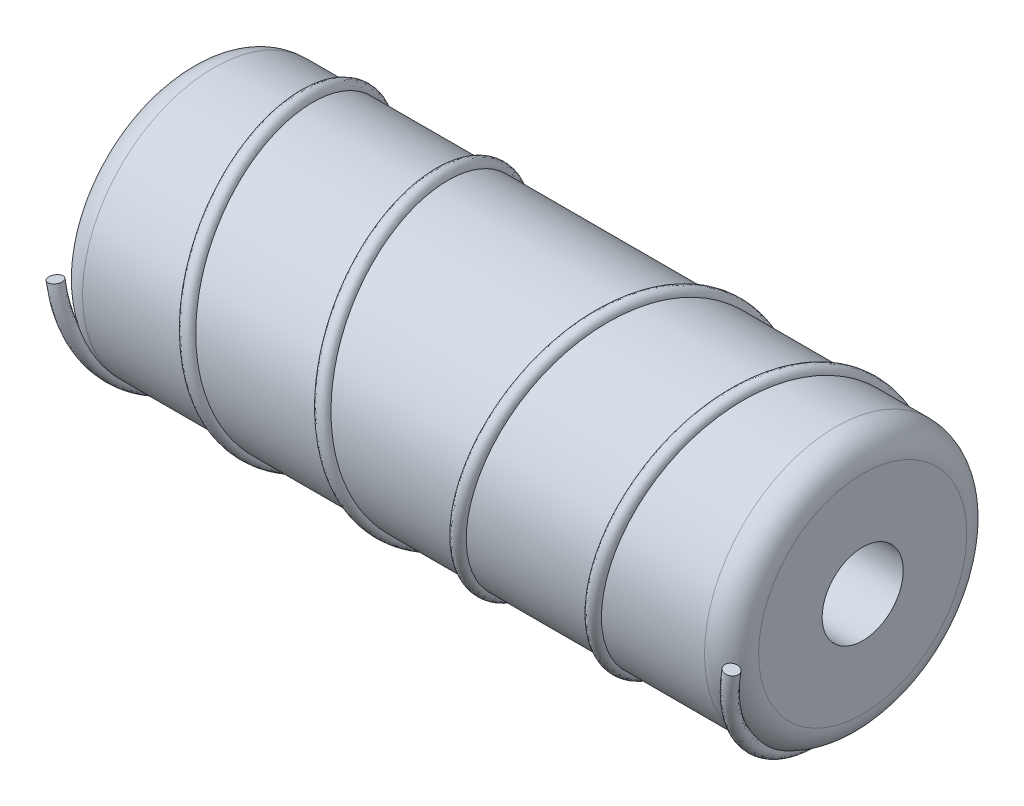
ISO-10303-21;
HEADER;
FILE_DESCRIPTION(('STEP AP214'),'2;1');
FILE_NAME('part.step','',(''),(''),'','','');
FILE_SCHEMA(('AUTOMOTIVE_DESIGN { 1 0 10303 214 1 1 1 1 }'));
ENDSEC;
DATA;
#1=APPLICATION_CONTEXT('core data for automotive mechanical design processes');
#2=APPLICATION_PROTOCOL_DEFINITION('international standard','automotive_design',2000,#1);
#3=PRODUCT_CONTEXT('',#1,'mechanical');
#4=PRODUCT('Part','Part','',(#3));
#5=PRODUCT_RELATED_PRODUCT_CATEGORY('part','',(#4));
#6=PRODUCT_DEFINITION_FORMATION('','',#4);
#7=PRODUCT_DEFINITION_CONTEXT('part definition',#1,'design');
#8=PRODUCT_DEFINITION('design','',#6,#7);
#9=PRODUCT_DEFINITION_SHAPE('','',#8);
#10=(LENGTH_UNIT() NAMED_UNIT(*) SI_UNIT(.MILLI.,.METRE.));
#11=(NAMED_UNIT(*) PLANE_ANGLE_UNIT() SI_UNIT($,.RADIAN.));
#12=(NAMED_UNIT(*) SI_UNIT($,.STERADIAN.) SOLID_ANGLE_UNIT());
#13=UNCERTAINTY_MEASURE_WITH_UNIT(LENGTH_MEASURE(1.E-05),#10,'distance_accuracy_value','');
#14=(GEOMETRIC_REPRESENTATION_CONTEXT(3) GLOBAL_UNCERTAINTY_ASSIGNED_CONTEXT((#13)) GLOBAL_UNIT_ASSIGNED_CONTEXT((#10,
#11,#12)) REPRESENTATION_CONTEXT('',''));
#15=CARTESIAN_POINT('',(0.,0.,0.));
#16=DIRECTION('',(0.,0.,1.));
#17=DIRECTION('',(1.,0.,0.));
#18=AXIS2_PLACEMENT_3D('',#15,#16,#17);
#19=CARTESIAN_POINT('',(0.,0.,0.));
#20=DIRECTION('',(-1.,0.,0.));
#21=DIRECTION('',(0.,0.,1.));
#22=AXIS2_PLACEMENT_3D('',#19,#20,#21);
#23=CYLINDRICAL_SURFACE('',#22,9.7);
#24=CARTESIAN_POINT('',(25.,0.,0.));
#25=DIRECTION('',(-0.161912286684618,-0.986805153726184,0.));
#26=DIRECTION('',(-0.986805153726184,0.161912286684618,0.));
#27=AXIS2_PLACEMENT_3D('',#24,#25,#26);
#28=ELLIPSE('',#27,59.9089803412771,9.7);
#29=CARTESIAN_POINT('',(24.5065975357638,0.0809561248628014,-9.69966216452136));
#30=VERTEX_POINT('',#29);
#31=CARTESIAN_POINT('',(24.9999999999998,0.,-9.7));
#32=VERTEX_POINT('',#31);
#33=EDGE_CURVE('E74',#30,#32,#28,.T.);
#34=ORIENTED_EDGE('',*,*,#33,.F.);
#35=CARTESIAN_POINT('',(-0.493402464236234,-0.0809561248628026,9.69966216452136));
#36=CARTESIAN_POINT('',(-0.180902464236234,-2.01033888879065,9.68355899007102));
#37=CARTESIAN_POINT('',(0.131597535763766,-3.786693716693,8.93033877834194));
#38=CARTESIAN_POINT('',(0.444097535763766,-5.56304854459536,8.17711856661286));
#39=CARTESIAN_POINT('',(0.756597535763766,-6.91594151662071,6.80145226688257));
#40=CARTESIAN_POINT('',(1.06909753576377,-8.26883448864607,5.42578596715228));
#41=CARTESIAN_POINT('',(1.38159753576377,-8.99229991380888,3.63710630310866));
#42=CARTESIAN_POINT('',(1.69409753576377,-9.71576533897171,1.84842663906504));
#43=CARTESIAN_POINT('',(2.00659753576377,-9.69966216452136,-0.080956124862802));
#44=CARTESIAN_POINT('',(2.31909753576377,-9.68355899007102,-2.01033888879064));
#45=CARTESIAN_POINT('',(2.63159753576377,-8.93033877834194,-3.786693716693));
#46=CARTESIAN_POINT('',(2.94409753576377,-8.17711856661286,-5.56304854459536));
#47=CARTESIAN_POINT('',(3.25659753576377,-6.80145226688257,-6.91594151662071));
#48=CARTESIAN_POINT('',(3.56909753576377,-5.42578596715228,-8.26883448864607));
#49=CARTESIAN_POINT('',(3.88159753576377,-3.63710630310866,-8.99229991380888));
#50=CARTESIAN_POINT('',(4.19409753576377,-1.84842663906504,-9.71576533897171));
#51=CARTESIAN_POINT('',(4.50659753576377,0.0809561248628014,-9.69966216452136));
#52=CARTESIAN_POINT('',(4.81909753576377,2.01033888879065,-9.68355899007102));
#53=CARTESIAN_POINT('',(5.13159753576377,3.786693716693,-8.93033877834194));
#54=CARTESIAN_POINT('',(5.44409753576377,5.56304854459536,-8.17711856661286));
#55=CARTESIAN_POINT('',(5.75659753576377,6.91594151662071,-6.80145226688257));
#56=CARTESIAN_POINT('',(6.06909753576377,8.26883448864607,-5.42578596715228));
#57=CARTESIAN_POINT('',(6.38159753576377,8.99229991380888,-3.63710630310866));
#58=CARTESIAN_POINT('',(6.69409753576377,9.7157653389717,-1.84842663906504));
#59=CARTESIAN_POINT('',(7.00659753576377,9.69966216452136,0.0809561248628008));
#60=CARTESIAN_POINT('',(7.31909753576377,9.68355899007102,2.01033888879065));
#61=CARTESIAN_POINT('',(7.63159753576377,8.93033877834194,3.786693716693));
#62=CARTESIAN_POINT('',(7.94409753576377,8.17711856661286,5.56304854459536));
#63=CARTESIAN_POINT('',(8.25659753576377,6.80145226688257,6.91594151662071));
#64=CARTESIAN_POINT('',(8.56909753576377,5.42578596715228,8.26883448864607));
#65=CARTESIAN_POINT('',(8.88159753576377,3.63710630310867,8.99229991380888));
#66=CARTESIAN_POINT('',(9.19409753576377,1.84842663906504,9.7157653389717));
#67=CARTESIAN_POINT('',(9.50659753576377,-0.0809561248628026,9.69966216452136));
#68=CARTESIAN_POINT('',(9.81909753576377,-2.01033888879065,9.68355899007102));
#69=CARTESIAN_POINT('',(10.1315975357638,-3.786693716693,8.93033877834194));
#70=CARTESIAN_POINT('',(10.4440975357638,-5.56304854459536,8.17711856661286));
#71=CARTESIAN_POINT('',(10.7565975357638,-6.91594151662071,6.80145226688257));
#72=CARTESIAN_POINT('',(11.0690975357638,-8.26883448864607,5.42578596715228));
#73=CARTESIAN_POINT('',(11.3815975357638,-8.99229991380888,3.63710630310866));
#74=CARTESIAN_POINT('',(11.6940975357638,-9.71576533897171,1.84842663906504));
#75=CARTESIAN_POINT('',(12.0065975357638,-9.69966216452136,-0.080956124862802));
#76=CARTESIAN_POINT('',(12.3190975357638,-9.68355899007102,-2.01033888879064));
#77=CARTESIAN_POINT('',(12.6315975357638,-8.93033877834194,-3.786693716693));
#78=CARTESIAN_POINT('',(12.9440975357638,-8.17711856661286,-5.56304854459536));
#79=CARTESIAN_POINT('',(13.2565975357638,-6.80145226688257,-6.91594151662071));
#80=CARTESIAN_POINT('',(13.5690975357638,-5.42578596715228,-8.26883448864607));
#81=CARTESIAN_POINT('',(13.8815975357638,-3.63710630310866,-8.99229991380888));
#82=CARTESIAN_POINT('',(14.1940975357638,-1.84842663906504,-9.71576533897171));
#83=CARTESIAN_POINT('',(14.5065975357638,0.0809561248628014,-9.69966216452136));
#84=CARTESIAN_POINT('',(14.8190975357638,2.01033888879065,-9.68355899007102));
#85=CARTESIAN_POINT('',(15.1315975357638,3.786693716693,-8.93033877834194));
#86=CARTESIAN_POINT('',(15.4440975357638,5.56304854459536,-8.17711856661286));
#87=CARTESIAN_POINT('',(15.7565975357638,6.91594151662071,-6.80145226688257));
#88=CARTESIAN_POINT('',(16.0690975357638,8.26883448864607,-5.42578596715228));
#89=CARTESIAN_POINT('',(16.3815975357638,8.99229991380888,-3.63710630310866));
#90=CARTESIAN_POINT('',(16.6940975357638,9.7157653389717,-1.84842663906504));
#91=CARTESIAN_POINT('',(17.0065975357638,9.69966216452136,0.0809561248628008));
#92=CARTESIAN_POINT('',(17.3190975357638,9.68355899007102,2.01033888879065));
#93=CARTESIAN_POINT('',(17.6315975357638,8.93033877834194,3.786693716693));
#94=CARTESIAN_POINT('',(17.9440975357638,8.17711856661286,5.56304854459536));
#95=CARTESIAN_POINT('',(18.2565975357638,6.80145226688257,6.91594151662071));
#96=CARTESIAN_POINT('',(18.5690975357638,5.42578596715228,8.26883448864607));
#97=CARTESIAN_POINT('',(18.8815975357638,3.63710630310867,8.99229991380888));
#98=CARTESIAN_POINT('',(19.1940975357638,1.84842663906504,9.7157653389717));
#99=CARTESIAN_POINT('',(19.5065975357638,-0.0809561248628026,9.69966216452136));
#100=CARTESIAN_POINT('',(19.8190975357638,-2.01033888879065,9.68355899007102));
#101=CARTESIAN_POINT('',(20.1315975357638,-3.786693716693,8.93033877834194));
#102=CARTESIAN_POINT('',(20.4440975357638,-5.56304854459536,8.17711856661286));
#103=CARTESIAN_POINT('',(20.7565975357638,-6.91594151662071,6.80145226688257));
#104=CARTESIAN_POINT('',(21.0690975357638,-8.26883448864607,5.42578596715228));
#105=CARTESIAN_POINT('',(21.3815975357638,-8.99229991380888,3.63710630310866));
#106=CARTESIAN_POINT('',(21.6940975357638,-9.71576533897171,1.84842663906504));
#107=CARTESIAN_POINT('',(22.0065975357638,-9.69966216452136,-0.080956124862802));
#108=CARTESIAN_POINT('',(22.3190975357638,-9.68355899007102,-2.01033888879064));
#109=CARTESIAN_POINT('',(22.6315975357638,-8.93033877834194,-3.786693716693));
#110=CARTESIAN_POINT('',(22.9440975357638,-8.17711856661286,-5.56304854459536));
#111=CARTESIAN_POINT('',(23.2565975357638,-6.80145226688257,-6.91594151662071));
#112=CARTESIAN_POINT('',(23.5690975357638,-5.42578596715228,-8.26883448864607));
#113=CARTESIAN_POINT('',(23.8815975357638,-3.63710630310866,-8.99229991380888));
#114=CARTESIAN_POINT('',(24.1940975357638,-1.84842663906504,-9.71576533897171));
#115=CARTESIAN_POINT('',(24.5065975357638,0.0809561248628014,-9.69966216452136));
#116=(BOUNDED_CURVE() B_SPLINE_CURVE(2,(#35,#36,#37,#38,#39,#40,#41,#42,#43,#44,#45,#46,#47,#48,
#49,#50,#51,#52,#53,#54,#55,#56,#57,#58,#59,#60,#61,#62,#63,#64,#65,#66,#67,#68,#69,#70,#71,#72,
#73,#74,#75,#76,#77,#78,#79,#80,#81,#82,#83,#84,#85,#86,#87,#88,#89,#90,#91,#92,#93,#94,#95,#96,
#97,#98,#99,#100,#101,#102,#103,#104,#105,#106,#107,#108,#109,#110,#111,#112,#113,#114,#115),
.UNSPECIFIED.,.F.,.F.) B_SPLINE_CURVE_WITH_KNOTS((3,2,2,2,2,2,2,2,2,2,2,2,2,2,2,2,2,2,2,2,2,2,2,
2,2,2,2,2,2,2,2,2,2,2,2,2,2,2,2,2,3),(0.,0.0208333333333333,0.0416666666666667,0.0625,
0.0833333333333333,0.104166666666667,0.125,0.145833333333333,0.166666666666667,0.1875,
0.208333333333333,0.229166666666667,0.25,0.270833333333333,0.291666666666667,0.3125,
0.333333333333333,0.354166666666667,0.375,0.395833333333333,0.416666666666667,0.4375,
0.458333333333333,0.479166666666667,0.5,0.520833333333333,0.541666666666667,0.5625,
0.583333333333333,0.604166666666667,0.625,0.645833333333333,0.666666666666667,0.6875,
0.708333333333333,0.729166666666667,0.75,0.770833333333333,0.791666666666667,0.8125,
0.833333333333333),
.UNSPECIFIED.) CURVE() GEOMETRIC_REPRESENTATION_ITEM() RATIONAL_B_SPLINE_CURVE((0.999324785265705,
0.980123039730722,0.999324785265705,0.980123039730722,0.999324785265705,0.980123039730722,
0.999324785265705,0.980123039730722,0.999324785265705,0.980123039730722,0.999324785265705,
0.980123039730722,0.999324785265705,0.980123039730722,0.999324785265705,0.980123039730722,
0.999324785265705,0.980123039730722,0.999324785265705,0.980123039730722,0.999324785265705,
0.980123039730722,0.999324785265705,0.980123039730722,0.999324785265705,0.980123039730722,
0.999324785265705,0.980123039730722,0.999324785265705,0.980123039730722,0.999324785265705,
0.980123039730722,0.999324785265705,0.980123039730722,0.999324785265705,0.980123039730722,
0.999324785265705,0.980123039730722,0.999324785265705,0.980123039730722,0.999324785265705,
0.980123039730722,0.999324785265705,0.980123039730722,0.999324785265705,0.980123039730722,
0.999324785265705,0.980123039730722,0.999324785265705,0.980123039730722,0.999324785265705,
0.980123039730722,0.999324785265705,0.980123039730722,0.999324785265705,0.980123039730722,
0.999324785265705,0.980123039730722,0.999324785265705,0.980123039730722,0.999324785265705,
0.980123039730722,0.999324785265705,0.980123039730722,0.999324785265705,0.980123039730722,
0.999324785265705,0.980123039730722,0.999324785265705,0.980123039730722,0.999324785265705,
0.980123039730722,0.999324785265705,0.980123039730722,0.999324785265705,0.980123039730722,
0.999324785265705,0.980123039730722,0.999324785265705,0.980123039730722,0.999324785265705)) REPRESENTATION_ITEM(''));
#117=CARTESIAN_POINT('',(2.,-9.69991653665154,-0.0402390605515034));
#118=VERTEX_POINT('',#117);
#119=EDGE_CURVE('E78',#118,#30,#116,.T.);
#120=ORIENTED_EDGE('',*,*,#119,.F.);
#121=CARTESIAN_POINT('',(2.,0.,0.));
#122=DIRECTION('',(1.,0.,0.));
#123=DIRECTION('',(0.,0.,-1.));
#124=AXIS2_PLACEMENT_3D('',#121,#122,#123);
#125=CIRCLE('',#124,9.7);
#126=CARTESIAN_POINT('',(2.,-7.82469601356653,5.73272468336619));
#127=VERTEX_POINT('',#126);
#128=EDGE_CURVE('E118',#118,#127,#125,.T.);
#129=ORIENTED_EDGE('',*,*,#128,.T.);
#130=CARTESIAN_POINT('',(0.493402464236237,0.0809561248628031,9.69966216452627));
#131=CARTESIAN_POINT('',(0.805902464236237,-1.84842663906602,9.71576533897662));
#132=CARTESIAN_POINT('',(1.11840246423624,-3.63710630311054,8.99229991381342));
#133=CARTESIAN_POINT('',(1.43090246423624,-5.42578596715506,8.26883448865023));
#134=CARTESIAN_POINT('',(1.74340246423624,-6.80145226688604,6.91594151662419));
#135=CARTESIAN_POINT('',(2.05590246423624,-8.17711856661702,5.56304854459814));
#136=CARTESIAN_POINT('',(2.36840246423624,-8.93033877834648,3.78669371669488));
#137=CARTESIAN_POINT('',(2.68090246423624,-9.68355899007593,2.01033888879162));
#138=CARTESIAN_POINT('',(2.99340246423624,-9.69966216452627,0.0809561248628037));
#139=CARTESIAN_POINT('',(3.30590246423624,-9.71576533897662,-1.84842663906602));
#140=CARTESIAN_POINT('',(3.61840246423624,-8.99229991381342,-3.63710630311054));
#141=CARTESIAN_POINT('',(3.93090246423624,-8.26883448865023,-5.42578596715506));
#142=CARTESIAN_POINT('',(4.24340246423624,-6.91594151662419,-6.80145226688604));
#143=CARTESIAN_POINT('',(4.55590246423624,-5.56304854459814,-8.17711856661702));
#144=CARTESIAN_POINT('',(4.86840246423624,-3.78669371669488,-8.93033877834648));
#145=CARTESIAN_POINT('',(5.18090246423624,-2.01033888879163,-9.68355899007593));
#146=CARTESIAN_POINT('',(5.49340246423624,-0.0809561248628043,-9.69966216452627));
#147=CARTESIAN_POINT('',(5.80590246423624,1.84842663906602,-9.71576533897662));
#148=CARTESIAN_POINT('',(6.11840246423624,3.63710630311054,-8.99229991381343));
#149=CARTESIAN_POINT('',(6.43090246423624,5.42578596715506,-8.26883448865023));
#150=CARTESIAN_POINT('',(6.74340246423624,6.80145226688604,-6.91594151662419));
#151=CARTESIAN_POINT('',(7.05590246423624,8.17711856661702,-5.56304854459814));
#152=CARTESIAN_POINT('',(7.36840246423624,8.93033877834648,-3.78669371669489));
#153=CARTESIAN_POINT('',(7.68090246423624,9.68355899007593,-2.01033888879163));
#154=CARTESIAN_POINT('',(7.99340246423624,9.69966216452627,-0.0809561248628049));
#155=CARTESIAN_POINT('',(8.30590246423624,9.71576533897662,1.84842663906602));
#156=CARTESIAN_POINT('',(8.61840246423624,8.99229991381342,3.63710630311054));
#157=CARTESIAN_POINT('',(8.93090246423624,8.26883448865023,5.42578596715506));
#158=CARTESIAN_POINT('',(9.24340246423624,6.91594151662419,6.80145226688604));
#159=CARTESIAN_POINT('',(9.55590246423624,5.56304854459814,8.17711856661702));
#160=CARTESIAN_POINT('',(9.86840246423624,3.78669371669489,8.93033877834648));
#161=CARTESIAN_POINT('',(10.1809024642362,2.01033888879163,9.68355899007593));
#162=CARTESIAN_POINT('',(10.4934024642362,0.0809561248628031,9.69966216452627));
#163=CARTESIAN_POINT('',(10.8059024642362,-1.84842663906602,9.71576533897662));
#164=CARTESIAN_POINT('',(11.1184024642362,-3.63710630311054,8.99229991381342));
#165=CARTESIAN_POINT('',(11.4309024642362,-5.42578596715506,8.26883448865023));
#166=CARTESIAN_POINT('',(11.7434024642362,-6.80145226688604,6.91594151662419));
#167=CARTESIAN_POINT('',(12.0559024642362,-8.17711856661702,5.56304854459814));
#168=CARTESIAN_POINT('',(12.3684024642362,-8.93033877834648,3.78669371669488));
#169=CARTESIAN_POINT('',(12.6809024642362,-9.68355899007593,2.01033888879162));
#170=CARTESIAN_POINT('',(12.9934024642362,-9.69966216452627,0.0809561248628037));
#171=CARTESIAN_POINT('',(13.3059024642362,-9.71576533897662,-1.84842663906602));
#172=CARTESIAN_POINT('',(13.6184024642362,-8.99229991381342,-3.63710630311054));
#173=CARTESIAN_POINT('',(13.9309024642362,-8.26883448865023,-5.42578596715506));
#174=CARTESIAN_POINT('',(14.2434024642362,-6.91594151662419,-6.80145226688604));
#175=CARTESIAN_POINT('',(14.5559024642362,-5.56304854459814,-8.17711856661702));
#176=CARTESIAN_POINT('',(14.8684024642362,-3.78669371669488,-8.93033877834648));
#177=CARTESIAN_POINT('',(15.1809024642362,-2.01033888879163,-9.68355899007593));
#178=CARTESIAN_POINT('',(15.4934024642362,-0.0809561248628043,-9.69966216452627));
#179=CARTESIAN_POINT('',(15.8059024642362,1.84842663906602,-9.71576533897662));
#180=CARTESIAN_POINT('',(16.1184024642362,3.63710630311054,-8.99229991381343));
#181=CARTESIAN_POINT('',(16.4309024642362,5.42578596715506,-8.26883448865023));
#182=CARTESIAN_POINT('',(16.7434024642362,6.80145226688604,-6.91594151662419));
#183=CARTESIAN_POINT('',(17.0559024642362,8.17711856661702,-5.56304854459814));
#184=CARTESIAN_POINT('',(17.3684024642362,8.93033877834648,-3.78669371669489));
#185=CARTESIAN_POINT('',(17.6809024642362,9.68355899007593,-2.01033888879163));
#186=CARTESIAN_POINT('',(17.9934024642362,9.69966216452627,-0.0809561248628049));
#187=CARTESIAN_POINT('',(18.3059024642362,9.71576533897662,1.84842663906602));
#188=CARTESIAN_POINT('',(18.6184024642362,8.99229991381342,3.63710630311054));
#189=CARTESIAN_POINT('',(18.9309024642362,8.26883448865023,5.42578596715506));
#190=CARTESIAN_POINT('',(19.2434024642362,6.91594151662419,6.80145226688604));
#191=CARTESIAN_POINT('',(19.5559024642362,5.56304854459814,8.17711856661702));
#192=CARTESIAN_POINT('',(19.8684024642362,3.78669371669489,8.93033877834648));
#193=CARTESIAN_POINT('',(20.1809024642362,2.01033888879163,9.68355899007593));
#194=CARTESIAN_POINT('',(20.4934024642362,0.0809561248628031,9.69966216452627));
#195=CARTESIAN_POINT('',(20.8059024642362,-1.84842663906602,9.71576533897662));
#196=CARTESIAN_POINT('',(21.1184024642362,-3.63710630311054,8.99229991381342));
#197=CARTESIAN_POINT('',(21.4309024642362,-5.42578596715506,8.26883448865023));
#198=CARTESIAN_POINT('',(21.7434024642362,-6.80145226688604,6.91594151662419));
#199=CARTESIAN_POINT('',(22.0559024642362,-8.17711856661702,5.56304854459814));
#200=CARTESIAN_POINT('',(22.3684024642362,-8.93033877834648,3.78669371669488));
#201=CARTESIAN_POINT('',(22.6809024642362,-9.68355899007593,2.01033888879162));
#202=CARTESIAN_POINT('',(22.9934024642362,-9.69966216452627,0.0809561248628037));
#203=CARTESIAN_POINT('',(23.3059024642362,-9.71576533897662,-1.84842663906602));
#204=CARTESIAN_POINT('',(23.6184024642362,-8.99229991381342,-3.63710630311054));
#205=CARTESIAN_POINT('',(23.9309024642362,-8.26883448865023,-5.42578596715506));
#206=CARTESIAN_POINT('',(24.2434024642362,-6.91594151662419,-6.80145226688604));
#207=CARTESIAN_POINT('',(24.5559024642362,-5.56304854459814,-8.17711856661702));
#208=CARTESIAN_POINT('',(24.8684024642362,-3.78669371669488,-8.93033877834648));
#209=CARTESIAN_POINT('',(25.1809024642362,-2.01033888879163,-9.68355899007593));
#210=CARTESIAN_POINT('',(25.4934024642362,-0.0809561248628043,-9.69966216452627));
#211=(BOUNDED_CURVE() B_SPLINE_CURVE(2,(#130,#131,#132,#133,#134,#135,#136,#137,#138,#139,#140,
#141,#142,#143,#144,#145,#146,#147,#148,#149,#150,#151,#152,#153,#154,#155,#156,#157,#158,#159,
#160,#161,#162,#163,#164,#165,#166,#167,#168,#169,#170,#171,#172,#173,#174,#175,#176,#177,#178,
#179,#180,#181,#182,#183,#184,#185,#186,#187,#188,#189,#190,#191,#192,#193,#194,#195,#196,#197,
#198,#199,#200,#201,#202,#203,#204,#205,#206,#207,#208,#209,#210),.UNSPECIFIED.,.F.,
.F.) B_SPLINE_CURVE_WITH_KNOTS((3,2,2,2,2,2,2,2,2,2,2,2,2,2,2,2,2,2,2,2,2,2,2,2,2,2,2,2,2,2,2,2,
2,2,2,2,2,2,2,2,3),(0.,0.0208333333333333,0.0416666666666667,0.0625,0.0833333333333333,
0.104166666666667,0.125,0.145833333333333,0.166666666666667,0.1875,0.208333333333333,
0.229166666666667,0.25,0.270833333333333,0.291666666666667,0.3125,0.333333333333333,
0.354166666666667,0.375,0.395833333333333,0.416666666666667,0.4375,0.458333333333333,
0.479166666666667,0.5,0.520833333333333,0.541666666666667,0.5625,0.583333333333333,
0.604166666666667,0.625,0.645833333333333,0.666666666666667,0.6875,0.708333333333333,
0.729166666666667,0.75,0.770833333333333,0.791666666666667,0.8125,0.833333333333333),
.UNSPECIFIED.) CURVE() GEOMETRIC_REPRESENTATION_ITEM() RATIONAL_B_SPLINE_CURVE((0.999324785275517,
0.980123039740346,0.999324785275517,0.980123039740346,0.999324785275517,0.980123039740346,
0.999324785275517,0.980123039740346,0.999324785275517,0.980123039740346,0.999324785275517,
0.980123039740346,0.999324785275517,0.980123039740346,0.999324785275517,0.980123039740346,
0.999324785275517,0.980123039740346,0.999324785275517,0.980123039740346,0.999324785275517,
0.980123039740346,0.999324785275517,0.980123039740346,0.999324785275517,0.980123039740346,
0.999324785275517,0.980123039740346,0.999324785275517,0.980123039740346,0.999324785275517,
0.980123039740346,0.999324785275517,0.980123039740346,0.999324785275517,0.980123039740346,
0.999324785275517,0.980123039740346,0.999324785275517,0.980123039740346,0.999324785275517,
0.980123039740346,0.999324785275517,0.980123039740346,0.999324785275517,0.980123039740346,
0.999324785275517,0.980123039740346,0.999324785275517,0.980123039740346,0.999324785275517,
0.980123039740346,0.999324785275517,0.980123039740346,0.999324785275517,0.980123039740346,
0.999324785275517,0.980123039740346,0.999324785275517,0.980123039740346,0.999324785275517,
0.980123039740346,0.999324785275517,0.980123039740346,0.999324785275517,0.980123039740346,
0.999324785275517,0.980123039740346,0.999324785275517,0.980123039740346,0.999324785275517,
0.980123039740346,0.999324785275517,0.980123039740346,0.999324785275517,0.980123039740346,
0.999324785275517,0.980123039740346,0.999324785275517,0.980123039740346,0.999324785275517)) REPRESENTATION_ITEM(''));
#212=CARTESIAN_POINT('',(25.,-3.03169973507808,-9.21405430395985));
#213=VERTEX_POINT('',#212);
#214=EDGE_CURVE('E117',#213,#127,#211,.F.);
#215=ORIENTED_EDGE('',*,*,#214,.F.);
#216=CARTESIAN_POINT('',(49.5065975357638,0.0809561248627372,9.69966216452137));
#217=CARTESIAN_POINT('',(49.1940975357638,-1.84842663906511,9.7157653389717));
#218=CARTESIAN_POINT('',(48.8815975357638,-3.63710630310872,8.99229991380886));
#219=CARTESIAN_POINT('',(48.5690975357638,-5.42578596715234,8.26883448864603));
#220=CARTESIAN_POINT('',(48.2565975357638,-6.80145226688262,6.91594151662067));
#221=CARTESIAN_POINT('',(47.9440975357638,-8.1771185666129,5.56304854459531));
#222=CARTESIAN_POINT('',(47.6315975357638,-8.93033877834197,3.78669371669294));
#223=CARTESIAN_POINT('',(47.3190975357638,-9.68355899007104,2.01033888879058));
#224=CARTESIAN_POINT('',(47.0065975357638,-9.69966216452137,0.0809561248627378));
#225=CARTESIAN_POINT('',(46.6940975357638,-9.7157653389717,-1.84842663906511));
#226=CARTESIAN_POINT('',(46.3815975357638,-8.99229991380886,-3.63710630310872));
#227=CARTESIAN_POINT('',(46.0690975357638,-8.26883448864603,-5.42578596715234));
#228=CARTESIAN_POINT('',(45.7565975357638,-6.91594151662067,-6.80145226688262));
#229=CARTESIAN_POINT('',(45.4440975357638,-5.56304854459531,-8.1771185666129));
#230=CARTESIAN_POINT('',(45.1315975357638,-3.78669371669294,-8.93033877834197));
#231=CARTESIAN_POINT('',(44.8190975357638,-2.01033888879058,-9.68355899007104));
#232=CARTESIAN_POINT('',(44.5065975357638,-0.0809561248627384,-9.69966216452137));
#233=CARTESIAN_POINT('',(44.1940975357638,1.84842663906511,-9.7157653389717));
#234=CARTESIAN_POINT('',(43.8815975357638,3.63710630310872,-8.99229991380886));
#235=CARTESIAN_POINT('',(43.5690975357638,5.42578596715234,-8.26883448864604));
#236=CARTESIAN_POINT('',(43.2565975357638,6.80145226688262,-6.91594151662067));
#237=CARTESIAN_POINT('',(42.9440975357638,8.1771185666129,-5.56304854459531));
#238=CARTESIAN_POINT('',(42.6315975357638,8.93033877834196,-3.78669371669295));
#239=CARTESIAN_POINT('',(42.3190975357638,9.68355899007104,-2.01033888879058));
#240=CARTESIAN_POINT('',(42.0065975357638,9.69966216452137,-0.080956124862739));
#241=CARTESIAN_POINT('',(41.6940975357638,9.7157653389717,1.84842663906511));
#242=CARTESIAN_POINT('',(41.3815975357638,8.99229991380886,3.63710630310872));
#243=CARTESIAN_POINT('',(41.0690975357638,8.26883448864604,5.42578596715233));
#244=CARTESIAN_POINT('',(40.7565975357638,6.91594151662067,6.80145226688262));
#245=CARTESIAN_POINT('',(40.4440975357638,5.56304854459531,8.1771185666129));
#246=CARTESIAN_POINT('',(40.1315975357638,3.78669371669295,8.93033877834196));
#247=CARTESIAN_POINT('',(39.8190975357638,2.01033888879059,9.68355899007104));
#248=CARTESIAN_POINT('',(39.5065975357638,0.0809561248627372,9.69966216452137));
#249=CARTESIAN_POINT('',(39.1940975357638,-1.84842663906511,9.7157653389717));
#250=CARTESIAN_POINT('',(38.8815975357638,-3.63710630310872,8.99229991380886));
#251=CARTESIAN_POINT('',(38.5690975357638,-5.42578596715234,8.26883448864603));
#252=CARTESIAN_POINT('',(38.2565975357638,-6.80145226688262,6.91594151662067));
#253=CARTESIAN_POINT('',(37.9440975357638,-8.1771185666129,5.56304854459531));
#254=CARTESIAN_POINT('',(37.6315975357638,-8.93033877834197,3.78669371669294));
#255=CARTESIAN_POINT('',(37.3190975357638,-9.68355899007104,2.01033888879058));
#256=CARTESIAN_POINT('',(37.0065975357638,-9.69966216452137,0.0809561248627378));
#257=CARTESIAN_POINT('',(36.6940975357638,-9.7157653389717,-1.84842663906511));
#258=CARTESIAN_POINT('',(36.3815975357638,-8.99229991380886,-3.63710630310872));
#259=CARTESIAN_POINT('',(36.0690975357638,-8.26883448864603,-5.42578596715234));
#260=CARTESIAN_POINT('',(35.7565975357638,-6.91594151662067,-6.80145226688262));
#261=CARTESIAN_POINT('',(35.4440975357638,-5.56304854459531,-8.1771185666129));
#262=CARTESIAN_POINT('',(35.1315975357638,-3.78669371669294,-8.93033877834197));
#263=CARTESIAN_POINT('',(34.8190975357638,-2.01033888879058,-9.68355899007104));
#264=CARTESIAN_POINT('',(34.5065975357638,-0.0809561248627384,-9.69966216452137));
#265=CARTESIAN_POINT('',(34.1940975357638,1.84842663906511,-9.7157653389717));
#266=CARTESIAN_POINT('',(33.8815975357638,3.63710630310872,-8.99229991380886));
#267=CARTESIAN_POINT('',(33.5690975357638,5.42578596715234,-8.26883448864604));
#268=CARTESIAN_POINT('',(33.2565975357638,6.80145226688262,-6.91594151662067));
#269=CARTESIAN_POINT('',(32.9440975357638,8.1771185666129,-5.56304854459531));
#270=CARTESIAN_POINT('',(32.6315975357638,8.93033877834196,-3.78669371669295));
#271=CARTESIAN_POINT('',(32.3190975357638,9.68355899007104,-2.01033888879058));
#272=CARTESIAN_POINT('',(32.0065975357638,9.69966216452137,-0.080956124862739));
#273=CARTESIAN_POINT('',(31.6940975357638,9.7157653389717,1.84842663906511));
#274=CARTESIAN_POINT('',(31.3815975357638,8.99229991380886,3.63710630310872));
#275=CARTESIAN_POINT('',(31.0690975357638,8.26883448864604,5.42578596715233));
#276=CARTESIAN_POINT('',(30.7565975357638,6.91594151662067,6.80145226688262));
#277=CARTESIAN_POINT('',(30.4440975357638,5.56304854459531,8.1771185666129));
#278=CARTESIAN_POINT('',(30.1315975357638,3.78669371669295,8.93033877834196));
#279=CARTESIAN_POINT('',(29.8190975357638,2.01033888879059,9.68355899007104));
#280=CARTESIAN_POINT('',(29.5065975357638,0.0809561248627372,9.69966216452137));
#281=CARTESIAN_POINT('',(29.1940975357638,-1.84842663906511,9.7157653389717));
#282=CARTESIAN_POINT('',(28.8815975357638,-3.63710630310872,8.99229991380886));
#283=CARTESIAN_POINT('',(28.5690975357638,-5.42578596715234,8.26883448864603));
#284=CARTESIAN_POINT('',(28.2565975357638,-6.80145226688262,6.91594151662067));
#285=CARTESIAN_POINT('',(27.9440975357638,-8.1771185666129,5.56304854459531));
#286=CARTESIAN_POINT('',(27.6315975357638,-8.93033877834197,3.78669371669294));
#287=CARTESIAN_POINT('',(27.3190975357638,-9.68355899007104,2.01033888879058));
#288=CARTESIAN_POINT('',(27.0065975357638,-9.69966216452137,0.0809561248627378));
#289=CARTESIAN_POINT('',(26.6940975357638,-9.7157653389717,-1.84842663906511));
#290=CARTESIAN_POINT('',(26.3815975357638,-8.99229991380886,-3.63710630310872));
#291=CARTESIAN_POINT('',(26.0690975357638,-8.26883448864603,-5.42578596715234));
#292=CARTESIAN_POINT('',(25.7565975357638,-6.91594151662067,-6.80145226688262));
#293=CARTESIAN_POINT('',(25.4440975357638,-5.56304854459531,-8.1771185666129));
#294=CARTESIAN_POINT('',(25.1315975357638,-3.78669371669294,-8.93033877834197));
#295=CARTESIAN_POINT('',(24.8190975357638,-2.01033888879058,-9.68355899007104));
#296=CARTESIAN_POINT('',(24.5065975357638,-0.0809561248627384,-9.69966216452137));
#297=(BOUNDED_CURVE() B_SPLINE_CURVE(2,(#216,#217,#218,#219,#220,#221,#222,#223,#224,#225,#226,
#227,#228,#229,#230,#231,#232,#233,#234,#235,#236,#237,#238,#239,#240,#241,#242,#243,#244,#245,
#246,#247,#248,#249,#250,#251,#252,#253,#254,#255,#256,#257,#258,#259,#260,#261,#262,#263,#264,
#265,#266,#267,#268,#269,#270,#271,#272,#273,#274,#275,#276,#277,#278,#279,#280,#281,#282,#283,
#284,#285,#286,#287,#288,#289,#290,#291,#292,#293,#294,#295,#296),.UNSPECIFIED.,.F.,
.F.) B_SPLINE_CURVE_WITH_KNOTS((3,2,2,2,2,2,2,2,2,2,2,2,2,2,2,2,2,2,2,2,2,2,2,2,2,2,2,2,2,2,2,2,
2,2,2,2,2,2,2,2,3),(0.,0.0208333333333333,0.0416666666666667,0.0625,0.0833333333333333,
0.104166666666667,0.125,0.145833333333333,0.166666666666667,0.1875,0.208333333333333,
0.229166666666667,0.25,0.270833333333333,0.291666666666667,0.3125,0.333333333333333,
0.354166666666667,0.375,0.395833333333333,0.416666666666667,0.4375,0.458333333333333,
0.479166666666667,0.5,0.520833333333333,0.541666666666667,0.5625,0.583333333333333,
0.604166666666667,0.625,0.645833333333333,0.666666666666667,0.6875,0.708333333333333,
0.729166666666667,0.75,0.770833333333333,0.791666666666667,0.8125,0.833333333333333),
.UNSPECIFIED.) CURVE() GEOMETRIC_REPRESENTATION_ITEM() RATIONAL_B_SPLINE_CURVE((0.999324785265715,
0.980123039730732,0.999324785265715,0.980123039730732,0.999324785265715,0.980123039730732,
0.999324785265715,0.980123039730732,0.999324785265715,0.980123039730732,0.999324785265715,
0.980123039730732,0.999324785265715,0.980123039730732,0.999324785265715,0.980123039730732,
0.999324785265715,0.980123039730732,0.999324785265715,0.980123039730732,0.999324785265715,
0.980123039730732,0.999324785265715,0.980123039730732,0.999324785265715,0.980123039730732,
0.999324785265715,0.980123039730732,0.999324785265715,0.980123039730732,0.999324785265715,
0.980123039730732,0.999324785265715,0.980123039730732,0.999324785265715,0.980123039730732,
0.999324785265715,0.980123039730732,0.999324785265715,0.980123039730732,0.999324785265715,
0.980123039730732,0.999324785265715,0.980123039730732,0.999324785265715,0.980123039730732,
0.999324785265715,0.980123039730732,0.999324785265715,0.980123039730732,0.999324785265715,
0.980123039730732,0.999324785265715,0.980123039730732,0.999324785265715,0.980123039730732,
0.999324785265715,0.980123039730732,0.999324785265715,0.980123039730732,0.999324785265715,
0.980123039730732,0.999324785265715,0.980123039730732,0.999324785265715,0.980123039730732,
0.999324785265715,0.980123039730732,0.999324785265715,0.980123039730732,0.999324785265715,
0.980123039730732,0.999324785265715,0.980123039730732,0.999324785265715,0.980123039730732,
0.999324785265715,0.980123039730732,0.999324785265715,0.980123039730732,0.999324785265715)) REPRESENTATION_ITEM(''));
#298=CARTESIAN_POINT('',(48.,-7.82469601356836,5.7327246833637));
#299=VERTEX_POINT('',#298);
#300=EDGE_CURVE('E103',#299,#213,#297,.T.);
#301=ORIENTED_EDGE('',*,*,#300,.F.);
#302=CARTESIAN_POINT('',(48.,0.,0.));
#303=DIRECTION('',(-1.,0.,0.));
#304=DIRECTION('',(0.,0.,1.));
#305=AXIS2_PLACEMENT_3D('',#302,#303,#304);
#306=CIRCLE('',#305,9.7);
#307=CARTESIAN_POINT('',(48.,-9.69991653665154,-0.0402390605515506));
#308=VERTEX_POINT('',#307);
#309=EDGE_CURVE('E254',#299,#308,#306,.T.);
#310=ORIENTED_EDGE('',*,*,#309,.T.);
#311=CARTESIAN_POINT('',(50.4934024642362,-0.0809561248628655,9.69966216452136));
#312=CARTESIAN_POINT('',(50.1809024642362,-2.01033888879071,9.68355899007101));
#313=CARTESIAN_POINT('',(49.8684024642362,-3.78669371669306,8.93033877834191));
#314=CARTESIAN_POINT('',(49.5559024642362,-5.56304854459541,8.17711856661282));
#315=CARTESIAN_POINT('',(49.2434024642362,-6.91594151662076,6.80145226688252));
#316=CARTESIAN_POINT('',(48.9309024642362,-8.2688344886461,5.42578596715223));
#317=CARTESIAN_POINT('',(48.6184024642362,-8.99229991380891,3.6371063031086));
#318=CARTESIAN_POINT('',(48.3059024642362,-9.71576533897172,1.84842663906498));
#319=CARTESIAN_POINT('',(47.9934024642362,-9.69966216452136,-0.0809561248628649));
#320=CARTESIAN_POINT('',(47.6809024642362,-9.68355899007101,-2.01033888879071));
#321=CARTESIAN_POINT('',(47.3684024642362,-8.93033877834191,-3.78669371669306));
#322=CARTESIAN_POINT('',(47.0559024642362,-8.17711856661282,-5.56304854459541));
#323=CARTESIAN_POINT('',(46.7434024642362,-6.80145226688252,-6.91594151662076));
#324=CARTESIAN_POINT('',(46.4309024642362,-5.42578596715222,-8.2688344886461));
#325=CARTESIAN_POINT('',(46.1184024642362,-3.6371063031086,-8.99229991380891));
#326=CARTESIAN_POINT('',(45.8059024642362,-1.84842663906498,-9.71576533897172));
#327=CARTESIAN_POINT('',(45.4934024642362,0.0809561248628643,-9.69966216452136));
#328=CARTESIAN_POINT('',(45.1809024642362,2.01033888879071,-9.68355899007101));
#329=CARTESIAN_POINT('',(44.8684024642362,3.78669371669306,-8.93033877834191));
#330=CARTESIAN_POINT('',(44.5559024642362,5.56304854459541,-8.17711856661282));
#331=CARTESIAN_POINT('',(44.2434024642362,6.91594151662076,-6.80145226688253));
#332=CARTESIAN_POINT('',(43.9309024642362,8.2688344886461,-5.42578596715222));
#333=CARTESIAN_POINT('',(43.6184024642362,8.99229991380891,-3.63710630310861));
#334=CARTESIAN_POINT('',(43.3059024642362,9.71576533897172,-1.84842663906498));
#335=CARTESIAN_POINT('',(42.9934024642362,9.69966216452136,0.0809561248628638));
#336=CARTESIAN_POINT('',(42.6809024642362,9.68355899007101,2.01033888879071));
#337=CARTESIAN_POINT('',(42.3684024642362,8.93033877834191,3.78669371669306));
#338=CARTESIAN_POINT('',(42.0559024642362,8.17711856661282,5.56304854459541));
#339=CARTESIAN_POINT('',(41.7434024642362,6.80145226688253,6.91594151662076));
#340=CARTESIAN_POINT('',(41.4309024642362,5.42578596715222,8.2688344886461));
#341=CARTESIAN_POINT('',(41.1184024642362,3.63710630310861,8.99229991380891));
#342=CARTESIAN_POINT('',(40.8059024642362,1.84842663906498,9.71576533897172));
#343=CARTESIAN_POINT('',(40.4934024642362,-0.0809561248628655,9.69966216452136));
#344=CARTESIAN_POINT('',(40.1809024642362,-2.01033888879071,9.68355899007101));
#345=CARTESIAN_POINT('',(39.8684024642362,-3.78669371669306,8.93033877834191));
#346=CARTESIAN_POINT('',(39.5559024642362,-5.56304854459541,8.17711856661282));
#347=CARTESIAN_POINT('',(39.2434024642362,-6.91594151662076,6.80145226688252));
#348=CARTESIAN_POINT('',(38.9309024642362,-8.2688344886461,5.42578596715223));
#349=CARTESIAN_POINT('',(38.6184024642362,-8.99229991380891,3.6371063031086));
#350=CARTESIAN_POINT('',(38.3059024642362,-9.71576533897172,1.84842663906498));
#351=CARTESIAN_POINT('',(37.9934024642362,-9.69966216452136,-0.0809561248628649));
#352=CARTESIAN_POINT('',(37.6809024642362,-9.68355899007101,-2.01033888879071));
#353=CARTESIAN_POINT('',(37.3684024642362,-8.93033877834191,-3.78669371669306));
#354=CARTESIAN_POINT('',(37.0559024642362,-8.17711856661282,-5.56304854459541));
#355=CARTESIAN_POINT('',(36.7434024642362,-6.80145226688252,-6.91594151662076));
#356=CARTESIAN_POINT('',(36.4309024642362,-5.42578596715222,-8.2688344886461));
#357=CARTESIAN_POINT('',(36.1184024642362,-3.6371063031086,-8.99229991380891));
#358=CARTESIAN_POINT('',(35.8059024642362,-1.84842663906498,-9.71576533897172));
#359=CARTESIAN_POINT('',(35.4934024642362,0.0809561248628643,-9.69966216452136));
#360=CARTESIAN_POINT('',(35.1809024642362,2.01033888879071,-9.68355899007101));
#361=CARTESIAN_POINT('',(34.8684024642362,3.78669371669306,-8.93033877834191));
#362=CARTESIAN_POINT('',(34.5559024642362,5.56304854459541,-8.17711856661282));
#363=CARTESIAN_POINT('',(34.2434024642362,6.91594151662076,-6.80145226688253));
#364=CARTESIAN_POINT('',(33.9309024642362,8.2688344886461,-5.42578596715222));
#365=CARTESIAN_POINT('',(33.6184024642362,8.99229991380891,-3.63710630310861));
#366=CARTESIAN_POINT('',(33.3059024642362,9.71576533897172,-1.84842663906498));
#367=CARTESIAN_POINT('',(32.9934024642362,9.69966216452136,0.0809561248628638));
#368=CARTESIAN_POINT('',(32.6809024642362,9.68355899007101,2.01033888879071));
#369=CARTESIAN_POINT('',(32.3684024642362,8.93033877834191,3.78669371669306));
#370=CARTESIAN_POINT('',(32.0559024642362,8.17711856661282,5.56304854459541));
#371=CARTESIAN_POINT('',(31.7434024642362,6.80145226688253,6.91594151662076));
#372=CARTESIAN_POINT('',(31.4309024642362,5.42578596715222,8.2688344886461));
#373=CARTESIAN_POINT('',(31.1184024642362,3.63710630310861,8.99229991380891));
#374=CARTESIAN_POINT('',(30.8059024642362,1.84842663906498,9.71576533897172));
#375=CARTESIAN_POINT('',(30.4934024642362,-0.0809561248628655,9.69966216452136));
#376=CARTESIAN_POINT('',(30.1809024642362,-2.01033888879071,9.68355899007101));
#377=CARTESIAN_POINT('',(29.8684024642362,-3.78669371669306,8.93033877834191));
#378=CARTESIAN_POINT('',(29.5559024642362,-5.56304854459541,8.17711856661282));
#379=CARTESIAN_POINT('',(29.2434024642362,-6.91594151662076,6.80145226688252));
#380=CARTESIAN_POINT('',(28.9309024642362,-8.2688344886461,5.42578596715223));
#381=CARTESIAN_POINT('',(28.6184024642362,-8.99229991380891,3.6371063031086));
#382=CARTESIAN_POINT('',(28.3059024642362,-9.71576533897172,1.84842663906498));
#383=CARTESIAN_POINT('',(27.9934024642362,-9.69966216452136,-0.0809561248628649));
#384=CARTESIAN_POINT('',(27.6809024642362,-9.68355899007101,-2.01033888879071));
#385=CARTESIAN_POINT('',(27.3684024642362,-8.93033877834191,-3.78669371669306));
#386=CARTESIAN_POINT('',(27.0559024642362,-8.17711856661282,-5.56304854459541));
#387=CARTESIAN_POINT('',(26.7434024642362,-6.80145226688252,-6.91594151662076));
#388=CARTESIAN_POINT('',(26.4309024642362,-5.42578596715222,-8.2688344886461));
#389=CARTESIAN_POINT('',(26.1184024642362,-3.6371063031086,-8.99229991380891));
#390=CARTESIAN_POINT('',(25.8059024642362,-1.84842663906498,-9.71576533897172));
#391=CARTESIAN_POINT('',(25.4934024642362,0.0809561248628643,-9.69966216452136));
#392=(BOUNDED_CURVE() B_SPLINE_CURVE(2,(#311,#312,#313,#314,#315,#316,#317,#318,#319,#320,#321,
#322,#323,#324,#325,#326,#327,#328,#329,#330,#331,#332,#333,#334,#335,#336,#337,#338,#339,#340,
#341,#342,#343,#344,#345,#346,#347,#348,#349,#350,#351,#352,#353,#354,#355,#356,#357,#358,#359,
#360,#361,#362,#363,#364,#365,#366,#367,#368,#369,#370,#371,#372,#373,#374,#375,#376,#377,#378,
#379,#380,#381,#382,#383,#384,#385,#386,#387,#388,#389,#390,#391),.UNSPECIFIED.,.F.,
.F.) B_SPLINE_CURVE_WITH_KNOTS((3,2,2,2,2,2,2,2,2,2,2,2,2,2,2,2,2,2,2,2,2,2,2,2,2,2,2,2,2,2,2,2,
2,2,2,2,2,2,2,2,3),(0.,0.0208333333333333,0.0416666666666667,0.0625,0.0833333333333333,
0.104166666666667,0.125,0.145833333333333,0.166666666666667,0.1875,0.208333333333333,
0.229166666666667,0.25,0.270833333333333,0.291666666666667,0.3125,0.333333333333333,
0.354166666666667,0.375,0.395833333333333,0.416666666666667,0.4375,0.458333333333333,
0.479166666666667,0.5,0.520833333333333,0.541666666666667,0.5625,0.583333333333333,
0.604166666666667,0.625,0.645833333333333,0.666666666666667,0.6875,0.708333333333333,
0.729166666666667,0.75,0.770833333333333,0.791666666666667,0.8125,0.833333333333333),
.UNSPECIFIED.) CURVE() GEOMETRIC_REPRESENTATION_ITEM() RATIONAL_B_SPLINE_CURVE((0.999324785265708,
0.980123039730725,0.999324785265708,0.980123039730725,0.999324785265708,0.980123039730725,
0.999324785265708,0.980123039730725,0.999324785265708,0.980123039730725,0.999324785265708,
0.980123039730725,0.999324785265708,0.980123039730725,0.999324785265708,0.980123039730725,
0.999324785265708,0.980123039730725,0.999324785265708,0.980123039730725,0.999324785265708,
0.980123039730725,0.999324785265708,0.980123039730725,0.999324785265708,0.980123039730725,
0.999324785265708,0.980123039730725,0.999324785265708,0.980123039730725,0.999324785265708,
0.980123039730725,0.999324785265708,0.980123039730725,0.999324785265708,0.980123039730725,
0.999324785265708,0.980123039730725,0.999324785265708,0.980123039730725,0.999324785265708,
0.980123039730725,0.999324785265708,0.980123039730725,0.999324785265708,0.980123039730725,
0.999324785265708,0.980123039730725,0.999324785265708,0.980123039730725,0.999324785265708,
0.980123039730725,0.999324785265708,0.980123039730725,0.999324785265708,0.980123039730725,
0.999324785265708,0.980123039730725,0.999324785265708,0.980123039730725,0.999324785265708,
0.980123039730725,0.999324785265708,0.980123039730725,0.999324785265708,0.980123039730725,
0.999324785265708,0.980123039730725,0.999324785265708,0.980123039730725,0.999324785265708,
0.980123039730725,0.999324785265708,0.980123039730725,0.999324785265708,0.980123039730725,
0.999324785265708,0.980123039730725,0.999324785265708,0.980123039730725,0.999324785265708)) REPRESENTATION_ITEM(''));
#393=CARTESIAN_POINT('',(25.4934024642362,0.0809561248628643,-9.69966216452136));
#394=VERTEX_POINT('',#393);
#395=EDGE_CURVE('E114',#394,#308,#392,.F.);
#396=ORIENTED_EDGE('',*,*,#395,.F.);
#397=CARTESIAN_POINT('',(25.,0.,0.));
#398=DIRECTION('',(0.161912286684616,-0.986805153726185,0.));
#399=DIRECTION('',(-0.986805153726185,-0.161912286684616,0.));
#400=AXIS2_PLACEMENT_3D('',#397,#398,#399);
#401=ELLIPSE('',#400,59.908980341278,9.7);
#402=EDGE_CURVE('E67',#32,#394,#401,.T.);
#403=ORIENTED_EDGE('',*,*,#402,.F.);
#404=EDGE_LOOP('',(#34,#120,#129,#215,#301,#310,#396,#403));
#405=FACE_BOUND('',#404,.T.);
#406=ADVANCED_FACE('F51',(#405),#23,.T.);
#407=CARTESIAN_POINT('',(24.5065974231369,-0.0809561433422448,-9.7));
#408=DIRECTION('',(0.161912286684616,-0.986805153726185,0.));
#409=DIRECTION('',(0.986805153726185,0.161912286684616,0.));
#410=AXIS2_PLACEMENT_3D('',#407,#408,#409);
#411=PLANE('',#410);
#412=DIRECTION('',(0.,0.,-1.));
#413=VECTOR('',#412,1.);
#414=CARTESIAN_POINT('',(24.9999999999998,0.,-9.70000000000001));
#415=LINE('',#414,#413);
#416=CARTESIAN_POINT('',(25.,0.,-10.2));
#417=VERTEX_POINT('',#416);
#418=EDGE_CURVE('E217',#32,#417,#415,.T.);
#419=ORIENTED_EDGE('',*,*,#418,.F.);
#420=ORIENTED_EDGE('',*,*,#402,.T.);
#421=CARTESIAN_POINT('',(25.,0.,-9.7));
#422=DIRECTION('',(0.161912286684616,-0.986805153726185,0.));
#423=DIRECTION('',(0.986805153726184,0.161912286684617,0.));
#424=AXIS2_PLACEMENT_3D('',#421,#422,#423);
#425=CIRCLE('',#424,0.499999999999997);
#426=EDGE_CURVE('E218',#417,#394,#425,.T.);
#427=ORIENTED_EDGE('',*,*,#426,.F.);
#428=EDGE_LOOP('',(#419,#420,#427));
#429=FACE_BOUND('',#428,.T.);
#430=ADVANCED_FACE('F203',(#429),#411,.F.);
#431=CARTESIAN_POINT('',(0.,0.,0.));
#432=DIRECTION('',(1.,0.,0.));
#433=DIRECTION('',(0.,0.,-1.));
#434=AXIS2_PLACEMENT_3D('',#431,#432,#433);
#435=PLANE('',#434);
#436=CARTESIAN_POINT('',(0.,0.,0.));
#437=DIRECTION('',(-1.,0.,0.));
#438=DIRECTION('',(0.,0.,1.));
#439=AXIS2_PLACEMENT_3D('',#436,#437,#438);
#440=CIRCLE('',#439,3.);
#441=CARTESIAN_POINT('',(0.,0.,3.));
#442=VERTEX_POINT('',#441);
#443=EDGE_CURVE('E113',#442,#442,#440,.T.);
#444=ORIENTED_EDGE('',*,*,#443,.F.);
#445=EDGE_LOOP('',(#444));
#446=FACE_BOUND('',#445,.T.);
#447=CARTESIAN_POINT('',(0.,0.,0.));
#448=DIRECTION('',(1.,0.,0.));
#449=DIRECTION('',(0.,0.,-1.));
#450=AXIS2_PLACEMENT_3D('',#447,#448,#449);
#451=CIRCLE('',#450,7.7);
#452=CARTESIAN_POINT('',(0.,0.,-7.7));
#453=VERTEX_POINT('',#452);
#454=EDGE_CURVE('E192',#453,#453,#451,.F.);
#455=ORIENTED_EDGE('',*,*,#454,.T.);
#456=EDGE_LOOP('',(#455));
#457=FACE_BOUND('',#456,.T.);
#458=ADVANCED_FACE('F200',(#446,#457),#435,.F.);
#459=CARTESIAN_POINT('',(50.,9.7,0.));
#460=DIRECTION('',(-1.,0.,0.));
#461=DIRECTION('',(0.,0.,1.));
#462=AXIS2_PLACEMENT_3D('',#459,#460,#461);
#463=PLANE('',#462);
#464=CARTESIAN_POINT('',(50.,0.,0.));
#465=DIRECTION('',(-1.,0.,0.));
#466=DIRECTION('',(0.,0.,1.));
#467=AXIS2_PLACEMENT_3D('',#464,#465,#466);
#468=CIRCLE('',#467,3.);
#469=CARTESIAN_POINT('',(50.,0.,3.));
#470=VERTEX_POINT('',#469);
#471=EDGE_CURVE('E241',#470,#470,#468,.T.);
#472=ORIENTED_EDGE('',*,*,#471,.T.);
#473=EDGE_LOOP('',(#472));
#474=FACE_BOUND('',#473,.T.);
#475=CARTESIAN_POINT('',(50.,0.,0.));
#476=DIRECTION('',(-1.,0.,0.));
#477=DIRECTION('',(0.,0.,1.));
#478=AXIS2_PLACEMENT_3D('',#475,#476,#477);
#479=CIRCLE('',#478,7.7);
#480=CARTESIAN_POINT('',(50.,0.,7.7));
#481=VERTEX_POINT('',#480);
#482=EDGE_CURVE('E256',#481,#481,#479,.F.);
#483=ORIENTED_EDGE('',*,*,#482,.T.);
#484=EDGE_LOOP('',(#483));
#485=FACE_BOUND('',#484,.T.);
#486=ADVANCED_FACE('F198',(#474,#485),#463,.F.);
#487=CARTESIAN_POINT('',(48.,0.,0.));
#488=DIRECTION('',(-1.,0.,0.));
#489=DIRECTION('',(0.,0.,1.));
#490=AXIS2_PLACEMENT_3D('',#487,#488,#489);
#491=TOROIDAL_SURFACE('',#490,7.7,2.);
#492=CARTESIAN_POINT('',(48.,-9.69991653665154,-0.0402390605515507));
#493=CARTESIAN_POINT('',(48.026695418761,-9.70060399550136,0.124469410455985));
#494=CARTESIAN_POINT('',(48.0535247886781,-9.69655300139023,0.289161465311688));
#495=CARTESIAN_POINT('',(48.1074264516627,-9.67896581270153,0.618356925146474));
#496=CARTESIAN_POINT('',(48.1344991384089,-9.66540958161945,0.782859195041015));
#497=CARTESIAN_POINT('',(48.2016589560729,-9.6200887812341,1.18886460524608));
#498=CARTESIAN_POINT('',(48.2418075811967,-9.58272882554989,1.4297518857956));
#499=CARTESIAN_POINT('',(48.3219518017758,-9.48752014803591,1.9076148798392));
#500=CARTESIAN_POINT('',(48.3619473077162,-9.42966087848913,2.14458851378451));
#501=CARTESIAN_POINT('',(48.4214324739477,-9.32785859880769,2.49575533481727));
#502=CARTESIAN_POINT('',(48.4411812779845,-9.29141078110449,2.61212520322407));
#503=CARTESIAN_POINT('',(48.4804386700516,-9.21358102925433,2.84325539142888));
#504=CARTESIAN_POINT('',(48.4999472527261,-9.17219898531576,2.95801567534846));
#505=CARTESIAN_POINT('',(48.5386556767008,-9.08460145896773,3.18568849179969));
#506=CARTESIAN_POINT('',(48.5578556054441,-9.03838737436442,3.29860154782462));
#507=CARTESIAN_POINT('',(48.595831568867,-8.94123560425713,3.52243864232));
#508=CARTESIAN_POINT('',(48.6146076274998,-8.89029818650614,3.63336279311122));
#509=CARTESIAN_POINT('',(48.6601669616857,-8.76037722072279,3.90108452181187));
#510=CARTESIAN_POINT('',(48.6868543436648,-8.6788834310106,4.05668856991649));
#511=CARTESIAN_POINT('',(48.7395511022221,-8.50656145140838,4.36270984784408));
#512=CARTESIAN_POINT('',(48.7655605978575,-8.41573491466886,4.51312798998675));
#513=CARTESIAN_POINT('',(48.8166343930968,-8.22516308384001,4.80833084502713));
#514=CARTESIAN_POINT('',(48.8416988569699,-8.1254193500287,4.95311653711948));
#515=CARTESIAN_POINT('',(48.8906231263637,-7.91744054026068,5.23671534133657));
#516=CARTESIAN_POINT('',(48.9144826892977,-7.80920376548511,5.3755272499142));
#517=CARTESIAN_POINT('',(48.9550593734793,-7.61234189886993,5.61347742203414));
#518=CARTESIAN_POINT('',(48.9720913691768,-7.52542979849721,5.7139857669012));
#519=CARTESIAN_POINT('',(49.0052305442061,-7.34729471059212,5.91128098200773));
#520=CARTESIAN_POINT('',(49.0213376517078,-7.25607138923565,6.00806756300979));
#521=CARTESIAN_POINT('',(49.0525424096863,-7.06952845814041,6.19783323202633));
#522=CARTESIAN_POINT('',(49.0676397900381,-6.9742077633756,6.2908112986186));
#523=CARTESIAN_POINT('',(49.0894685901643,-6.82835867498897,6.42732881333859));
#524=CARTESIAN_POINT('',(49.096608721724,-6.77926372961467,6.4723435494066));
#525=CARTESIAN_POINT('',(49.1106058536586,-6.68014646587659,6.56138522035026));
#526=CARTESIAN_POINT('',(49.1174628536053,-6.63012414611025,6.60541215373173));
#527=CARTESIAN_POINT('',(49.1376901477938,-6.47865112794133,6.73596535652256));
#528=CARTESIAN_POINT('',(49.1507139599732,-6.37581311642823,6.82094646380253));
#529=CARTESIAN_POINT('',(49.1756970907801,-6.16672610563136,6.98674660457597));
#530=CARTESIAN_POINT('',(49.1876563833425,-6.06047702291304,7.06756553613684));
#531=CARTESIAN_POINT('',(49.2217758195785,-5.73704187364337,7.30370640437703));
#532=CARTESIAN_POINT('',(49.2421920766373,-5.51506016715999,7.45280486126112));
#533=CARTESIAN_POINT('',(49.2685805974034,-5.17333336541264,7.66469630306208));
#534=CARTESIAN_POINT('',(49.2766950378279,-5.05747611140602,7.73362342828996));
#535=CARTESIAN_POINT('',(49.2912751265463,-4.82336513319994,7.86744340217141));
#536=CARTESIAN_POINT('',(49.2977410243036,-4.70511177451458,7.93233686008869));
#537=CARTESIAN_POINT('',(49.3087448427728,-4.46659678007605,8.05824324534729));
#538=CARTESIAN_POINT('',(49.3132842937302,-4.34633681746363,8.11925921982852));
#539=CARTESIAN_POINT('',(49.3200062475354,-4.10405243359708,8.23781151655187));
#540=CARTESIAN_POINT('',(49.3221888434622,-3.9820280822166,8.29534797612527));
#541=CARTESIAN_POINT('',(49.322965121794,-3.80912153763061,8.37449662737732));
#542=CARTESIAN_POINT('',(49.3229168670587,-3.75876845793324,8.39726414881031));
#543=CARTESIAN_POINT('',(49.3221532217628,-3.65789809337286,8.4424259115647));
#544=CARTESIAN_POINT('',(49.3214378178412,-3.60738080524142,8.46482014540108));
#545=CARTESIAN_POINT('',(49.3191731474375,-3.506270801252,8.50935203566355));
#546=CARTESIAN_POINT('',(49.3176241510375,-3.45567811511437,8.5314897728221));
#547=CARTESIAN_POINT('',(49.3133868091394,-3.35453252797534,8.57573767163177));
#548=CARTESIAN_POINT('',(49.3106985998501,-3.30397962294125,8.59784783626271));
#549=CARTESIAN_POINT('',(49.3044789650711,-3.21556337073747,8.63696045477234));
#550=CARTESIAN_POINT('',(49.3013180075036,-3.17763966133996,8.65388043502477));
#551=CARTESIAN_POINT('',(49.2954349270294,-3.12105587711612,8.67970321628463));
#552=CARTESIAN_POINT('',(49.2932826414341,-3.10223816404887,8.68838783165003));
#553=CARTESIAN_POINT('',(49.2884703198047,-3.06477592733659,8.70598436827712));
#554=CARTESIAN_POINT('',(49.2858103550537,-3.04613137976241,8.71489625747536));
#555=CARTESIAN_POINT('',(49.2799664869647,-3.01029229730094,8.73250551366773));
#556=CARTESIAN_POINT('',(49.2768260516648,-2.99308030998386,8.74118112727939));
#557=CARTESIAN_POINT('',(49.2696151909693,-2.95914638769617,8.75901049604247));
#558=CARTESIAN_POINT('',(49.26554687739,-2.9424234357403,8.76816312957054));
#559=CARTESIAN_POINT('',(49.2569283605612,-2.91369232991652,8.78511800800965));
#560=CARTESIAN_POINT('',(49.2527099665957,-2.90149177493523,8.79273964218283));
#561=CARTESIAN_POINT('',(49.2450318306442,-2.88416176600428,8.80488018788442));
#562=CARTESIAN_POINT('',(49.2422293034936,-2.87852029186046,8.8090685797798));
#563=CARTESIAN_POINT('',(49.2359523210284,-2.86789326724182,8.8177439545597));
#564=CARTESIAN_POINT('',(49.2324813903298,-2.86290449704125,8.82222929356));
#565=CARTESIAN_POINT('',(49.2253143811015,-2.85509264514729,8.83062336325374));
#566=CARTESIAN_POINT('',(49.2218081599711,-2.85203541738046,8.83446345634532));
#567=CARTESIAN_POINT('',(49.21382818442,-2.8475176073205,8.84235585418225));
#568=CARTESIAN_POINT('',(49.2093447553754,-2.84607394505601,8.8464099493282));
#569=CARTESIAN_POINT('',(49.200405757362,-2.84592378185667,8.85354244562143));
#570=CARTESIAN_POINT('',(49.1960071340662,-2.84691955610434,8.85667947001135));
#571=CARTESIAN_POINT('',(49.1869852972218,-2.85086844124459,8.86244216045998));
#572=CARTESIAN_POINT('',(49.1824020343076,-2.85404927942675,8.86495593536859));
#573=CARTESIAN_POINT('',(49.174417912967,-2.86095659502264,8.86884480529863));
#574=CARTESIAN_POINT('',(49.1709409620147,-2.864551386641,8.87032782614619));
#575=CARTESIAN_POINT('',(49.1643275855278,-2.87219480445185,8.8728544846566));
#576=CARTESIAN_POINT('',(49.1611922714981,-2.87624482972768,8.8738967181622));
#577=CARTESIAN_POINT('',(49.1535361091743,-2.88691572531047,8.87615107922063));
#578=CARTESIAN_POINT('',(49.1492094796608,-2.89371826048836,8.87713767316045));
#579=CARTESIAN_POINT('',(49.1410102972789,-2.90762393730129,8.87861792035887));
#580=CARTESIAN_POINT('',(49.1371375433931,-2.9147269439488,8.87911179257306));
#581=CARTESIAN_POINT('',(49.1296932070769,-2.92916033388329,8.87975279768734));
#582=CARTESIAN_POINT('',(49.1261237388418,-2.93649189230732,8.87989766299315));
#583=CARTESIAN_POINT('',(49.1192357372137,-2.95126724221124,8.87992134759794));
#584=CARTESIAN_POINT('',(49.1159171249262,-2.95871099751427,8.87980025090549));
#585=CARTESIAN_POINT('',(49.1055611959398,-2.98275478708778,8.87907897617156));
#586=CARTESIAN_POINT('',(49.098898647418,-2.99950342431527,8.87807573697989));
#587=CARTESIAN_POINT('',(49.0861790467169,-3.03317838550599,8.87539375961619));
#588=CARTESIAN_POINT('',(49.0801224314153,-3.05010482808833,8.87371453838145));
#589=CARTESIAN_POINT('',(49.0625733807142,-3.10108002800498,8.86791687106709));
#590=CARTESIAN_POINT('',(49.0517260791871,-3.13526365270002,8.86304178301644));
#591=CARTESIAN_POINT('',(49.0310429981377,-3.20371632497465,8.85194396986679));
#592=CARTESIAN_POINT('',(49.0212076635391,-3.23798540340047,8.84572065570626));
#593=CARTESIAN_POINT('',(49.0022528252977,-3.30646257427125,8.83222264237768));
#594=CARTESIAN_POINT('',(48.9931323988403,-3.34067068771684,8.82494933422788));
#595=CARTESIAN_POINT('',(48.9665782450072,-3.44306324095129,8.80183327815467));
#596=CARTESIAN_POINT('',(48.9499134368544,-3.51114839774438,8.78467142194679));
#597=CARTESIAN_POINT('',(48.9177450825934,-3.64685551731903,8.74760985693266));
#598=CARTESIAN_POINT('',(48.9022419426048,-3.71447731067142,8.72770919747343));
#599=CARTESIAN_POINT('',(48.8719832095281,-3.84925053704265,8.68549605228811));
#600=CARTESIAN_POINT('',(48.8572287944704,-3.91640109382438,8.66317992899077));
#601=CARTESIAN_POINT('',(48.8282985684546,-4.05004723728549,8.61636644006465));
#602=CARTESIAN_POINT('',(48.8141226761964,-4.11654291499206,8.59186938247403));
#603=CARTESIAN_POINT('',(48.7722253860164,-4.31506896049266,8.51528953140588));
#604=CARTESIAN_POINT('',(48.7451503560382,-4.44606552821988,8.46014117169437));
#605=CARTESIAN_POINT('',(48.6921228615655,-4.70480593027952,8.34247449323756));
#606=CARTESIAN_POINT('',(48.666169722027,-4.83255170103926,8.2799606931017));
#607=CARTESIAN_POINT('',(48.5987863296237,-5.16461053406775,8.10611774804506));
#608=CARTESIAN_POINT('',(48.5579905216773,-5.3660459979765,7.98899353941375));
#609=CARTESIAN_POINT('',(48.4776441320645,-5.75848742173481,7.73777726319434));
#610=CARTESIAN_POINT('',(48.4380944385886,-5.94948601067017,7.60367342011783));
#611=CARTESIAN_POINT('',(48.3795033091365,-6.22706377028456,7.39091411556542));
#612=CARTESIAN_POINT('',(48.3600997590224,-6.31808212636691,7.31807938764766));
#613=CARTESIAN_POINT('',(48.3215015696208,-6.49705375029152,7.16866979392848));
#614=CARTESIAN_POINT('',(48.3023069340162,-6.58500696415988,7.09209486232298));
#615=CARTESIAN_POINT('',(48.264147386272,-6.75765856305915,6.93540663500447));
#616=CARTESIAN_POINT('',(48.2451823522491,-6.84235873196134,6.85529533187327));
#617=CARTESIAN_POINT('',(48.2071542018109,-7.00841418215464,6.69170450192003));
#618=CARTESIAN_POINT('',(48.18809108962,-7.08976960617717,6.60822511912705));
#619=CARTESIAN_POINT('',(48.1549587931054,-7.22794840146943,6.46053239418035));
#620=CARTESIAN_POINT('',(48.1409019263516,-7.28557048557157,6.39706122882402));
#621=CARTESIAN_POINT('',(48.1127556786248,-7.39888092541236,6.26842643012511));
#622=CARTESIAN_POINT('',(48.0986662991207,-7.45456936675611,6.20326287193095));
#623=CARTESIAN_POINT('',(48.0704924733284,-7.56384170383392,6.0714468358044));
#624=CARTESIAN_POINT('',(48.0564080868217,-7.61743003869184,6.004798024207));
#625=CARTESIAN_POINT('',(48.0282181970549,-7.72258891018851,5.86992646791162));
#626=CARTESIAN_POINT('',(48.0141126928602,-7.77415935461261,5.80170365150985));
#627=CARTESIAN_POINT('',(48.,-7.82469601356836,5.7327246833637));
#628=B_SPLINE_CURVE_WITH_KNOTS('',3,(#492,#493,#494,#495,#496,#497,#498,#499,#500,#501,#502,
#503,#504,#505,#506,#507,#508,#509,#510,#511,#512,#513,#514,#515,#516,#517,#518,#519,#520,#521,
#522,#523,#524,#525,#526,#527,#528,#529,#530,#531,#532,#533,#534,#535,#536,#537,#538,#539,#540,
#541,#542,#543,#544,#545,#546,#547,#548,#549,#550,#551,#552,#553,#554,#555,#556,#557,#558,#559,
#560,#561,#562,#563,#564,#565,#566,#567,#568,#569,#570,#571,#572,#573,#574,#575,#576,#577,#578,
#579,#580,#581,#582,#583,#584,#585,#586,#587,#588,#589,#590,#591,#592,#593,#594,#595,#596,#597,
#598,#599,#600,#601,#602,#603,#604,#605,#606,#607,#608,#609,#610,#611,#612,#613,#614,#615,#616,
#617,#618,#619,#620,#621,#622,#623,#624,#625,#626,#627),.UNSPECIFIED.,.F.,.F.,(4,2,2,2,2,2,2,2,
2,2,2,2,2,2,2,2,2,2,2,2,2,2,2,2,2,2,2,2,2,2,2,2,2,2,2,2,2,2,2,2,2,2,2,2,2,2,2,2,2,2,2,2,2,2,2,2,
2,2,2,2,2,2,2,2,2,2,2,4),(0.,0.500481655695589,1.00202148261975,1.74226911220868,
2.48289818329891,2.8534065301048,3.22392312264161,3.59433282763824,3.96472154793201,
4.49738353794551,5.02995133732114,5.56242613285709,6.0950077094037,6.49677379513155,
6.89857104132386,7.30047535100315,7.50143207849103,7.70238910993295,8.10438062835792,
8.50638198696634,9.30995777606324,9.71505434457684,10.1200895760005,10.5248024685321,
10.9294993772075,11.0952790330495,11.2610620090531,11.4267913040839,11.5925007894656,
11.7174184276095,11.7799224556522,11.8424177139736,11.9009828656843,11.9594160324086,
12.0042671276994,12.026928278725,12.0494730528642,12.0674258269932,12.0855651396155,
12.1016030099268,12.1196326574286,12.1352276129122,12.1508718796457,12.1751795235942,
12.1994763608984,12.2239306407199,12.2483771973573,12.3024923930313,12.3566463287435,
12.4651509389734,12.5737030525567,12.6821126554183,12.8985131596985,13.114988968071,
13.3317954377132,13.5485713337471,13.9823568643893,14.4158776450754,15.124621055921,
15.833858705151,16.1883066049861,16.5427607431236,16.8970176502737,17.2512594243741,
17.5118354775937,17.7723999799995,18.0323802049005,18.2923722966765),.UNSPECIFIED.);
#629=EDGE_CURVE('E110',#308,#299,#628,.T.);
#630=ORIENTED_EDGE('',*,*,#629,.F.);
#631=ORIENTED_EDGE('',*,*,#309,.F.);
#632=EDGE_LOOP('',(#630,#631));
#633=FACE_BOUND('',#632,.T.);
#634=ORIENTED_EDGE('',*,*,#482,.F.);
#635=EDGE_LOOP('',(#634));
#636=FACE_BOUND('',#635,.T.);
#637=ADVANCED_FACE('F194',(#633,#636),#491,.T.);
#638=CARTESIAN_POINT('',(2.,0.,0.));
#639=DIRECTION('',(1.,0.,0.));
#640=DIRECTION('',(0.,0.,-1.));
#641=AXIS2_PLACEMENT_3D('',#638,#639,#640);
#642=TOROIDAL_SURFACE('',#641,7.7,2.);
#643=CARTESIAN_POINT('',(1.99999999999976,-7.82469601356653,5.73272468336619));
#644=CARTESIAN_POINT('',(1.97285783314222,-7.72750037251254,5.86539284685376));
#645=CARTESIAN_POINT('',(1.94574503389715,-7.62649312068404,5.99524225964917));
#646=CARTESIAN_POINT('',(1.90509151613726,-7.46928022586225,6.18577887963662));
#647=CARTESIAN_POINT('',(1.8915133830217,-7.41580277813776,6.24871734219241));
#648=CARTESIAN_POINT('',(1.86438688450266,-7.30704624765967,6.37303043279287));
#649=CARTESIAN_POINT('',(1.85083852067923,-7.25176707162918,6.43440497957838));
#650=CARTESIAN_POINT('',(1.81757491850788,-7.11376257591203,6.58324396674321));
#651=CARTESIAN_POINT('',(1.79787386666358,-7.03005008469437,6.66979954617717));
#652=CARTESIAN_POINT('',(1.75858428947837,-6.85904384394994,6.83933032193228));
#653=CARTESIAN_POINT('',(1.73899577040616,-6.77174989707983,6.92230532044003));
#654=CARTESIAN_POINT('',(1.69958620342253,-6.59368280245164,7.08449661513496));
#655=CARTESIAN_POINT('',(1.67976502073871,-6.50290756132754,7.16371058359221));
#656=CARTESIAN_POINT('',(1.63989673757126,-6.31808470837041,7.3181473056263));
#657=CARTESIAN_POINT('',(1.61984964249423,-6.22403717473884,7.39337015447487));
#658=CARTESIAN_POINT('',(1.55944743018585,-5.93776015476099,7.61237606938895));
#659=CARTESIAN_POINT('',(1.51870959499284,-5.74084291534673,7.7500008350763));
#660=CARTESIAN_POINT('',(1.43589494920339,-5.33599879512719,8.00718284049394));
#661=CARTESIAN_POINT('',(1.39381921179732,-5.12808065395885,8.12675414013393));
#662=CARTESIAN_POINT('',(1.32963766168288,-4.81194228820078,8.28976166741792));
#663=CARTESIAN_POINT('',(1.30838043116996,-4.70739320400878,8.34074732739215));
#664=CARTESIAN_POINT('',(1.26513034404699,-4.49612260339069,8.4378061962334));
#665=CARTESIAN_POINT('',(1.24313720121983,-4.38940024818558,8.48387746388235));
#666=CARTESIAN_POINT('',(1.19799901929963,-4.17343202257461,8.57094747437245));
#667=CARTESIAN_POINT('',(1.17484827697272,-4.06417545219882,8.61191672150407));
#668=CARTESIAN_POINT('',(1.1270024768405,-3.84409548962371,8.68785513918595));
#669=CARTESIAN_POINT('',(1.10230991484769,-3.73327484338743,8.72283368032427));
#670=CARTESIAN_POINT('',(1.0675367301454,-3.58456382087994,8.76475946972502));
#671=CARTESIAN_POINT('',(1.05867928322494,-3.54726600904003,8.77485838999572));
#672=CARTESIAN_POINT('',(1.04050380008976,-3.47250112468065,8.79416062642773));
#673=CARTESIAN_POINT('',(1.03118525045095,-3.43503390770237,8.80336290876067));
#674=CARTESIAN_POINT('',(1.01192955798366,-3.35986954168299,8.82076717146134));
#675=CARTESIAN_POINT('',(1.00199027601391,-3.32217205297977,8.82896536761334));
#676=CARTESIAN_POINT('',(0.981338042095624,-3.24691043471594,8.84407641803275));
#677=CARTESIAN_POINT('',(0.97062858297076,-3.2093464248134,8.85099462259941));
#678=CARTESIAN_POINT('',(0.94803875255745,-3.1343910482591,8.86321812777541));
#679=CARTESIAN_POINT('',(0.936161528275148,-3.09699948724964,8.86852761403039));
#680=CARTESIAN_POINT('',(0.916775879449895,-3.04135592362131,8.874614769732));
#681=CARTESIAN_POINT('',(0.910071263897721,-3.0229280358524,8.87632899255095));
#682=CARTESIAN_POINT('',(0.895880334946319,-2.98631899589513,8.87889198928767));
#683=CARTESIAN_POINT('',(0.888394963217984,-2.96813757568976,8.87974179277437));
#684=CARTESIAN_POINT('',(0.877150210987,-2.9434310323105,8.87994338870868));
#685=CARTESIAN_POINT('',(0.873952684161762,-2.93665734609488,8.87989684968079));
#686=CARTESIAN_POINT('',(0.867302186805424,-2.92323109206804,8.87953537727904));
#687=CARTESIAN_POINT('',(0.863848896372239,-2.91657868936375,8.8792201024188));
#688=CARTESIAN_POINT('',(0.856651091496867,-2.90355449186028,8.87823571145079));
#689=CARTESIAN_POINT('',(0.852910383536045,-2.89718034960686,8.8775707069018));
#690=CARTESIAN_POINT('',(0.844985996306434,-2.88479747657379,8.87573840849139));
#691=CARTESIAN_POINT('',(0.840803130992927,-2.87878810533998,8.87457202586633));
#692=CARTESIAN_POINT('',(0.831700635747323,-2.86733217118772,8.87143666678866));
#693=CARTESIAN_POINT('',(0.826768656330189,-2.8618982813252,8.86945304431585));
#694=CARTESIAN_POINT('',(0.817166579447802,-2.85374870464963,8.86471989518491));
#695=CARTESIAN_POINT('',(0.812682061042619,-2.85069727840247,8.86223871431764));
#696=CARTESIAN_POINT('',(0.804305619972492,-2.84707697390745,8.85687198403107));
#697=CARTESIAN_POINT('',(0.800475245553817,-2.8461329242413,8.85416735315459));
#698=CARTESIAN_POINT('',(0.793063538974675,-2.84587729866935,8.84838600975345));
#699=CARTESIAN_POINT('',(0.789482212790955,-2.84656576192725,8.84530928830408));
#700=CARTESIAN_POINT('',(0.78136411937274,-2.8497394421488,8.83777469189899));
#701=CARTESIAN_POINT('',(0.7771223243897,-2.8528936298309,8.83331815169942));
#702=CARTESIAN_POINT('',(0.76976483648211,-2.86019796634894,8.82494998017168));
#703=CARTESIAN_POINT('',(0.766605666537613,-2.86429447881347,8.82102259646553));
#704=CARTESIAN_POINT('',(0.760842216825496,-2.87307494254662,8.81339970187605));
#705=CARTESIAN_POINT('',(0.758239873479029,-2.87776085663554,8.80970503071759));
#706=CARTESIAN_POINT('',(0.75147477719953,-2.89141103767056,8.79958127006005));
#707=CARTESIAN_POINT('',(0.747765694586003,-2.90075358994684,8.79337387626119));
#708=CARTESIAN_POINT('',(0.741099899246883,-2.91995345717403,8.78135129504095));
#709=CARTESIAN_POINT('',(0.738145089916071,-2.92981200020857,8.775537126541));
#710=CARTESIAN_POINT('',(0.732736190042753,-2.94987329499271,8.76415654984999));
#711=CARTESIAN_POINT('',(0.730284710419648,-2.96007753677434,8.75859154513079));
#712=CARTESIAN_POINT('',(0.725759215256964,-2.98065767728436,8.74766903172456));
#713=CARTESIAN_POINT('',(0.723684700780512,-2.99103332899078,8.74231125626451));
#714=CARTESIAN_POINT('',(0.717933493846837,-3.02207048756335,8.72659570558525));
#715=CARTESIAN_POINT('',(0.714662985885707,-3.04291272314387,8.71644774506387));
#716=CARTESIAN_POINT('',(0.708831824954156,-3.08485501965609,8.69648202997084));
#717=CARTESIAN_POINT('',(0.70627143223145,-3.10595517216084,8.68666439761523));
#718=CARTESIAN_POINT('',(0.699343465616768,-3.16953191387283,8.65748652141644));
#719=CARTESIAN_POINT('',(0.695737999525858,-3.21222884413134,8.63842840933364));
#720=CARTESIAN_POINT('',(0.689761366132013,-3.29769594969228,8.60063471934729));
#721=CARTESIAN_POINT('',(0.68738675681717,-3.34046558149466,8.58189838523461));
#722=CARTESIAN_POINT('',(0.683509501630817,-3.42602030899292,8.54446036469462));
#723=CARTESIAN_POINT('',(0.682006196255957,-3.46880536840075,8.52575866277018));
#724=CARTESIAN_POINT('',(0.678457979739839,-3.59714857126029,8.4694121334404));
#725=CARTESIAN_POINT('',(0.677378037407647,-3.68263795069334,8.43155037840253));
#726=CARTESIAN_POINT('',(0.676951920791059,-3.85308136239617,8.35462166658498));
#727=CARTESIAN_POINT('',(0.677605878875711,-3.93803535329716,8.31555461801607));
#728=CARTESIAN_POINT('',(0.680259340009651,-4.1072518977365,8.23589829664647));
#729=CARTESIAN_POINT('',(0.682259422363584,-4.1915141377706,8.1953083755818));
#730=CARTESIAN_POINT('',(0.687367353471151,-4.35916874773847,8.11243598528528));
#731=CARTESIAN_POINT('',(0.690475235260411,-4.44256109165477,8.0701534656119));
#732=CARTESIAN_POINT('',(0.701230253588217,-4.69141551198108,7.94049718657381));
#733=CARTESIAN_POINT('',(0.710305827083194,-4.85540684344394,7.85038374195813));
#734=CARTESIAN_POINT('',(0.731520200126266,-5.17862401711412,7.66233930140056));
#735=CARTESIAN_POINT('',(0.743658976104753,-5.33784989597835,7.5644083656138));
#736=CARTESIAN_POINT('',(0.775225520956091,-5.70503963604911,7.32514460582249));
#737=CARTESIAN_POINT('',(0.795721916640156,-5.91079616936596,7.18052211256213));
#738=CARTESIAN_POINT('',(0.8294137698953,-6.21065128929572,6.9525313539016));
#739=CARTESIAN_POINT('',(0.841137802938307,-6.30915544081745,6.87467766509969));
#740=CARTESIAN_POINT('',(0.859399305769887,-6.45456911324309,6.75514875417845));
#741=CARTESIAN_POINT('',(0.865599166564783,-6.50265075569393,6.71484697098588));
#742=CARTESIAN_POINT('',(0.878200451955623,-6.59800212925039,6.6333248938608));
#743=CARTESIAN_POINT('',(0.884601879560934,-6.64527184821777,6.59210458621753));
#744=CARTESIAN_POINT('',(0.904175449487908,-6.78587088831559,6.46710560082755));
#745=CARTESIAN_POINT('',(0.91771527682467,-6.87797721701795,6.38199945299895));
#746=CARTESIAN_POINT('',(0.945745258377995,-7.05872253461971,6.20834568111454));
#747=CARTESIAN_POINT('',(0.960235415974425,-7.14736151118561,6.11979804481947));
#748=CARTESIAN_POINT('',(1.00502401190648,-7.40777667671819,5.84909283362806));
#749=CARTESIAN_POINT('',(1.03664616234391,-7.57409104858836,5.66183753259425));
#750=CARTESIAN_POINT('',(1.10290076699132,-7.89104457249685,5.27394046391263));
#751=CARTESIAN_POINT('',(1.13754266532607,-8.041631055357,5.07325719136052));
#752=CARTESIAN_POINT('',(1.19112630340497,-8.25418852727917,4.76344179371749));
#753=CARTESIAN_POINT('',(1.20925961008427,-8.32282706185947,4.65869360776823));
#754=CARTESIAN_POINT('',(1.24597205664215,-8.45551887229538,4.44640075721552));
#755=CARTESIAN_POINT('',(1.26455119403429,-8.51957217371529,4.33885610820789));
#756=CARTESIAN_POINT('',(1.302052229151,-8.64294227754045,4.12113619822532));
#757=CARTESIAN_POINT('',(1.32097413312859,-8.70225899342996,4.01096088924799));
#758=CARTESIAN_POINT('',(1.34954808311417,-8.78758029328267,3.84387311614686));
#759=CARTESIAN_POINT('',(1.35910488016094,-8.81541256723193,3.78787129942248));
#760=CARTESIAN_POINT('',(1.37825400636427,-8.86984190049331,3.67527654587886));
#761=CARTESIAN_POINT('',(1.38784633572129,-8.89643895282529,3.61868360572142));
#762=CARTESIAN_POINT('',(1.41677822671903,-8.974382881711,3.44808512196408));
#763=CARTESIAN_POINT('',(1.43627348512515,-9.02388492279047,3.33325522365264));
#764=CARTESIAN_POINT('',(1.47563128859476,-9.11784929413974,3.10162789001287));
#765=CARTESIAN_POINT('',(1.49549383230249,-9.16231164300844,2.98483046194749));
#766=CARTESIAN_POINT('',(1.55502830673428,-9.28699291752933,2.63454101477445));
#767=CARTESIAN_POINT('',(1.59511385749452,-9.3597571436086,2.3984120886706));
#768=CARTESIAN_POINT('',(1.67580242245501,-9.48456449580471,1.92086736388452));
#769=CARTESIAN_POINT('',(1.7164054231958,-9.53660815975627,1.67945170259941));
#770=CARTESIAN_POINT('',(1.79771750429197,-9.61967186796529,1.19258359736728));
#771=CARTESIAN_POINT('',(1.83842664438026,-9.65065408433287,0.947124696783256));
#772=CARTESIAN_POINT('',(1.91953462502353,-9.69130787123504,0.454365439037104));
#773=CARTESIAN_POINT('',(1.95993342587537,-9.70097675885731,0.207064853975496));
#774=CARTESIAN_POINT('',(2.,-9.69991653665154,-0.0402390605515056));
#775=B_SPLINE_CURVE_WITH_KNOTS('',3,(#643,#644,#645,#646,#647,#648,#649,#650,#651,#652,#653,
#654,#655,#656,#657,#658,#659,#660,#661,#662,#663,#664,#665,#666,#667,#668,#669,#670,#671,#672,
#673,#674,#675,#676,#677,#678,#679,#680,#681,#682,#683,#684,#685,#686,#687,#688,#689,#690,#691,
#692,#693,#694,#695,#696,#697,#698,#699,#700,#701,#702,#703,#704,#705,#706,#707,#708,#709,#710,
#711,#712,#713,#714,#715,#716,#717,#718,#719,#720,#721,#722,#723,#724,#725,#726,#727,#728,#729,
#730,#731,#732,#733,#734,#735,#736,#737,#738,#739,#740,#741,#742,#743,#744,#745,#746,#747,#748,
#749,#750,#751,#752,#753,#754,#755,#756,#757,#758,#759,#760,#761,#762,#763,#764,#765,#766,#767,
#768,#769,#770,#771,#772,#773,#774),.UNSPECIFIED.,.F.,.F.,(4,2,2,2,2,2,2,2,2,2,2,2,2,2,2,2,2,2,
2,2,2,2,2,2,2,2,2,2,2,2,2,2,2,2,2,2,2,2,2,2,2,2,2,2,2,2,2,2,2,2,2,2,2,2,2,2,2,2,2,2,2,2,2,2,2,
4),(0.,0.499934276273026,0.750998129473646,1.00207500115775,1.36801044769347,1.73396608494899,
2.10014533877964,2.46631584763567,3.19638872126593,3.9258900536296,4.28052541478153,
4.63530034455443,4.99203945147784,5.34821535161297,5.46713537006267,5.58619092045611,
5.70568219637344,5.82466212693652,5.94332977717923,6.00236603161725,6.06133188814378,
6.08379639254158,6.10628948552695,6.12852386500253,6.15071800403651,6.17332850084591,
6.19091186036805,6.20496851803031,6.21902551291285,6.2394063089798,6.25883143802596,
6.27832305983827,6.31367752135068,6.34912033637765,6.38474260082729,6.42031736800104,
6.49052245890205,6.56075324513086,6.70140298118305,6.84165724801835,6.98180521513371,
7.26228686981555,7.5427899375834,7.82341379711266,8.10404602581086,8.66580035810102,
9.22755036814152,9.98374616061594,10.3619704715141,10.5510894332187,10.7402112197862,
11.1185050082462,11.4968001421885,12.2532298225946,13.0121164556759,13.3916384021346,
13.7711582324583,14.1506849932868,14.3404600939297,14.5302362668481,14.9097726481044,
15.289307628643,16.0392639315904,16.7892007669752,17.5404810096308,18.2918558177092),.UNSPECIFIED.);
#776=EDGE_CURVE('E122',#127,#118,#775,.T.);
#777=ORIENTED_EDGE('',*,*,#776,.F.);
#778=ORIENTED_EDGE('',*,*,#128,.F.);
#779=EDGE_LOOP('',(#777,#778));
#780=FACE_BOUND('',#779,.T.);
#781=ORIENTED_EDGE('',*,*,#454,.F.);
#782=EDGE_LOOP('',(#781));
#783=FACE_BOUND('',#782,.T.);
#784=ADVANCED_FACE('F53',(#780,#783),#642,.T.);
#785=CARTESIAN_POINT('',(50.,0.,0.));
#786=DIRECTION('',(-1.,0.,0.));
#787=DIRECTION('',(0.,0.,1.));
#788=AXIS2_PLACEMENT_3D('',#785,#786,#787);
#789=CYLINDRICAL_SURFACE('',#788,3.);
#790=ORIENTED_EDGE('',*,*,#471,.F.);
#791=EDGE_LOOP('',(#790));
#792=FACE_BOUND('',#791,.T.);
#793=ORIENTED_EDGE('',*,*,#443,.T.);
#794=EDGE_LOOP('',(#793));
#795=FACE_BOUND('',#794,.T.);
#796=ADVANCED_FACE('F210',(#792,#795),#789,.F.);
#797=CARTESIAN_POINT('',(49.5065974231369,0.0809561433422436,9.7));
#798=DIRECTION('',(0.161912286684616,0.986805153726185,0.));
#799=DIRECTION('',(-0.986805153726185,0.161912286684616,0.));
#800=AXIS2_PLACEMENT_3D('',#797,#798,#799);
#801=PLANE('',#800);
#802=CARTESIAN_POINT('',(50.,0.,9.7));
#803=DIRECTION('',(-0.161912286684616,-0.986805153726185,0.));
#804=DIRECTION('',(0.986805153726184,-0.161912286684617,0.));
#805=AXIS2_PLACEMENT_3D('',#802,#803,#804);
#806=CIRCLE('',#805,0.499999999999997);
#807=CARTESIAN_POINT('',(50.4934025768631,-0.080956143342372,9.7));
#808=VERTEX_POINT('',#807);
#809=EDGE_CURVE('E223',#808,#808,#806,.T.);
#810=ORIENTED_EDGE('',*,*,#809,.F.);
#811=EDGE_LOOP('',(#810));
#812=FACE_BOUND('',#811,.T.);
#813=ADVANCED_FACE('F176',(#812),#801,.T.);
#814=CARTESIAN_POINT('',(50.4934025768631,-0.080956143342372,9.7));
#815=CARTESIAN_POINT('',(50.1809025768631,-2.01040610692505,9.68389682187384));
#816=CARTESIAN_POINT('',(49.8684025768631,-3.78682301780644,8.93065089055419));
#817=CARTESIAN_POINT('',(49.5559025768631,-5.56323992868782,8.17740495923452));
#818=CARTESIAN_POINT('',(49.2434025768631,-6.91618041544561,6.80169113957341));
#819=CARTESIAN_POINT('',(48.9309025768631,-8.2691209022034,5.4259773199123));
#820=CARTESIAN_POINT('',(48.6184025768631,-8.99261204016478,3.6372355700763));
#821=CARTESIAN_POINT('',(48.3059025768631,-9.71610317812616,1.84849382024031));
#822=CARTESIAN_POINT('',(47.9934025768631,-9.7,-0.0809561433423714));
#823=CARTESIAN_POINT('',(47.6809025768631,-9.68389682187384,-2.01040610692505));
#824=CARTESIAN_POINT('',(47.3684025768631,-8.93065089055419,-3.78682301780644));
#825=CARTESIAN_POINT('',(47.0559025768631,-8.17740495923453,-5.56323992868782));
#826=CARTESIAN_POINT('',(46.7434025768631,-6.80169113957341,-6.91618041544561));
#827=CARTESIAN_POINT('',(46.4309025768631,-5.4259773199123,-8.2691209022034));
#828=CARTESIAN_POINT('',(46.1184025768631,-3.63723557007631,-8.99261204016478));
#829=CARTESIAN_POINT('',(45.8059025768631,-1.84849382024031,-9.71610317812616));
#830=CARTESIAN_POINT('',(45.4934025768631,0.0809561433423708,-9.7));
#831=CARTESIAN_POINT('',(45.1809025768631,2.01040610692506,-9.68389682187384));
#832=CARTESIAN_POINT('',(44.8684025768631,3.78682301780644,-8.93065089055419));
#833=CARTESIAN_POINT('',(44.5559025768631,5.56323992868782,-8.17740495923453));
#834=CARTESIAN_POINT('',(44.2434025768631,6.91618041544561,-6.80169113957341));
#835=CARTESIAN_POINT('',(43.9309025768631,8.2691209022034,-5.4259773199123));
#836=CARTESIAN_POINT('',(43.6184025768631,8.99261204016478,-3.63723557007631));
#837=CARTESIAN_POINT('',(43.3059025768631,9.71610317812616,-1.84849382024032));
#838=CARTESIAN_POINT('',(42.9934025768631,9.7,0.0809561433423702));
#839=CARTESIAN_POINT('',(42.6809025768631,9.68389682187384,2.01040610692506));
#840=CARTESIAN_POINT('',(42.3684025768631,8.93065089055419,3.78682301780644));
#841=CARTESIAN_POINT('',(42.0559025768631,8.17740495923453,5.56323992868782));
#842=CARTESIAN_POINT('',(41.7434025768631,6.80169113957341,6.91618041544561));
#843=CARTESIAN_POINT('',(41.4309025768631,5.4259773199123,8.2691209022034));
#844=CARTESIAN_POINT('',(41.1184025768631,3.63723557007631,8.99261204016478));
#845=CARTESIAN_POINT('',(40.8059025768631,1.84849382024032,9.71610317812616));
#846=CARTESIAN_POINT('',(40.4934025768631,-0.080956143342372,9.7));
#847=CARTESIAN_POINT('',(40.1809025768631,-2.01040610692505,9.68389682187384));
#848=CARTESIAN_POINT('',(39.8684025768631,-3.78682301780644,8.93065089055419));
#849=CARTESIAN_POINT('',(39.5559025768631,-5.56323992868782,8.17740495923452));
#850=CARTESIAN_POINT('',(39.2434025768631,-6.91618041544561,6.80169113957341));
#851=CARTESIAN_POINT('',(38.9309025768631,-8.2691209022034,5.4259773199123));
#852=CARTESIAN_POINT('',(38.6184025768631,-8.99261204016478,3.6372355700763));
#853=CARTESIAN_POINT('',(38.3059025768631,-9.71610317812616,1.84849382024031));
#854=CARTESIAN_POINT('',(37.9934025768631,-9.7,-0.0809561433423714));
#855=CARTESIAN_POINT('',(37.6809025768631,-9.68389682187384,-2.01040610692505));
#856=CARTESIAN_POINT('',(37.3684025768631,-8.93065089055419,-3.78682301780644));
#857=CARTESIAN_POINT('',(37.0559025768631,-8.17740495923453,-5.56323992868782));
#858=CARTESIAN_POINT('',(36.7434025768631,-6.80169113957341,-6.91618041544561));
#859=CARTESIAN_POINT('',(36.4309025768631,-5.4259773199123,-8.2691209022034));
#860=CARTESIAN_POINT('',(36.1184025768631,-3.63723557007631,-8.99261204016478));
#861=CARTESIAN_POINT('',(35.8059025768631,-1.84849382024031,-9.71610317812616));
#862=CARTESIAN_POINT('',(35.4934025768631,0.0809561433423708,-9.7));
#863=CARTESIAN_POINT('',(35.1809025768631,2.01040610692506,-9.68389682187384));
#864=CARTESIAN_POINT('',(34.8684025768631,3.78682301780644,-8.93065089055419));
#865=CARTESIAN_POINT('',(34.5559025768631,5.56323992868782,-8.17740495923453));
#866=CARTESIAN_POINT('',(34.2434025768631,6.91618041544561,-6.80169113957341));
#867=CARTESIAN_POINT('',(33.9309025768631,8.2691209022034,-5.4259773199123));
#868=CARTESIAN_POINT('',(33.6184025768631,8.99261204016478,-3.63723557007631));
#869=CARTESIAN_POINT('',(33.3059025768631,9.71610317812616,-1.84849382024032));
#870=CARTESIAN_POINT('',(32.9934025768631,9.7,0.0809561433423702));
#871=CARTESIAN_POINT('',(32.6809025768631,9.68389682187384,2.01040610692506));
#872=CARTESIAN_POINT('',(32.3684025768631,8.93065089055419,3.78682301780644));
#873=CARTESIAN_POINT('',(32.0559025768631,8.17740495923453,5.56323992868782));
#874=CARTESIAN_POINT('',(31.7434025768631,6.80169113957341,6.91618041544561));
#875=CARTESIAN_POINT('',(31.4309025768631,5.4259773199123,8.2691209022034));
#876=CARTESIAN_POINT('',(31.1184025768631,3.63723557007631,8.99261204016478));
#877=CARTESIAN_POINT('',(30.8059025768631,1.84849382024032,9.71610317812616));
#878=CARTESIAN_POINT('',(30.4934025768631,-0.080956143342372,9.7));
#879=CARTESIAN_POINT('',(30.1809025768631,-2.01040610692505,9.68389682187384));
#880=CARTESIAN_POINT('',(29.8684025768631,-3.78682301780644,8.93065089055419));
#881=CARTESIAN_POINT('',(29.5559025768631,-5.56323992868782,8.17740495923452));
#882=CARTESIAN_POINT('',(29.2434025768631,-6.91618041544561,6.80169113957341));
#883=CARTESIAN_POINT('',(28.9309025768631,-8.2691209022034,5.4259773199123));
#884=CARTESIAN_POINT('',(28.6184025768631,-8.99261204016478,3.6372355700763));
#885=CARTESIAN_POINT('',(28.3059025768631,-9.71610317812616,1.84849382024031));
#886=CARTESIAN_POINT('',(27.9934025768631,-9.7,-0.0809561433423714));
#887=CARTESIAN_POINT('',(27.6809025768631,-9.68389682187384,-2.01040610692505));
#888=CARTESIAN_POINT('',(27.3684025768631,-8.93065089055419,-3.78682301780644));
#889=CARTESIAN_POINT('',(27.0559025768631,-8.17740495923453,-5.56323992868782));
#890=CARTESIAN_POINT('',(26.7434025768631,-6.80169113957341,-6.91618041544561));
#891=CARTESIAN_POINT('',(26.4309025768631,-5.4259773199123,-8.2691209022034));
#892=CARTESIAN_POINT('',(26.1184025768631,-3.63723557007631,-8.99261204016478));
#893=CARTESIAN_POINT('',(25.8059025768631,-1.84849382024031,-9.71610317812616));
#894=CARTESIAN_POINT('',(25.4934025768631,0.0809561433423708,-9.7));
#895=CARTESIAN_POINT('',(50.4934025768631,-0.08095614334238,10.7));
#896=CARTESIAN_POINT('',(50.1809025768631,-2.20931847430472,10.6838968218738));
#897=CARTESIAN_POINT('',(49.8684025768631,-4.16950645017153,9.85453042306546));
#898=CARTESIAN_POINT('',(49.5559025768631,-6.12969442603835,9.02516402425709));
#899=CARTESIAN_POINT('',(49.2434025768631,-7.62328719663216,7.50879792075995));
#900=CARTESIAN_POINT('',(48.9309025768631,-9.11687996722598,5.99243181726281));
#901=CARTESIAN_POINT('',(48.6184025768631,-9.91649157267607,4.01991900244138));
#902=CARTESIAN_POINT('',(48.3059025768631,-10.7161031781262,2.04740618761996));
#903=CARTESIAN_POINT('',(47.9934025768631,-10.7,-0.0809561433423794));
#904=CARTESIAN_POINT('',(47.6809025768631,-10.6838968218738,-2.20931847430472));
#905=CARTESIAN_POINT('',(47.3684025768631,-9.85453042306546,-4.16950645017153));
#906=CARTESIAN_POINT('',(47.0559025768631,-9.02516402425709,-6.12969442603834));
#907=CARTESIAN_POINT('',(46.7434025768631,-7.50879792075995,-7.62328719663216));
#908=CARTESIAN_POINT('',(46.4309025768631,-5.99243181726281,-9.11687996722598));
#909=CARTESIAN_POINT('',(46.1184025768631,-4.01991900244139,-9.91649157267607));
#910=CARTESIAN_POINT('',(45.8059025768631,-2.04740618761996,-10.7161031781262));
#911=CARTESIAN_POINT('',(45.4934025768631,0.0809561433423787,-10.7));
#912=CARTESIAN_POINT('',(45.1809025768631,2.20931847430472,-10.6838968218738));
#913=CARTESIAN_POINT('',(44.8684025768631,4.16950645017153,-9.85453042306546));
#914=CARTESIAN_POINT('',(44.5559025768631,6.12969442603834,-9.02516402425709));
#915=CARTESIAN_POINT('',(44.2434025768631,7.62328719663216,-7.50879792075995));
#916=CARTESIAN_POINT('',(43.9309025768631,9.11687996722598,-5.99243181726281));
#917=CARTESIAN_POINT('',(43.6184025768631,9.91649157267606,-4.01991900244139));
#918=CARTESIAN_POINT('',(43.3059025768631,10.7161031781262,-2.04740618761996));
#919=CARTESIAN_POINT('',(42.9934025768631,10.7,0.0809561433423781));
#920=CARTESIAN_POINT('',(42.6809025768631,10.6838968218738,2.20931847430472));
#921=CARTESIAN_POINT('',(42.3684025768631,9.85453042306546,4.16950645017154));
#922=CARTESIAN_POINT('',(42.0559025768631,9.02516402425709,6.12969442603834));
#923=CARTESIAN_POINT('',(41.7434025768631,7.50879792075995,7.62328719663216));
#924=CARTESIAN_POINT('',(41.4309025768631,5.99243181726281,9.11687996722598));
#925=CARTESIAN_POINT('',(41.1184025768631,4.01991900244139,9.91649157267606));
#926=CARTESIAN_POINT('',(40.8059025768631,2.04740618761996,10.7161031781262));
#927=CARTESIAN_POINT('',(40.4934025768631,-0.08095614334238,10.7));
#928=CARTESIAN_POINT('',(40.1809025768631,-2.20931847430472,10.6838968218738));
#929=CARTESIAN_POINT('',(39.8684025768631,-4.16950645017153,9.85453042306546));
#930=CARTESIAN_POINT('',(39.5559025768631,-6.12969442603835,9.02516402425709));
#931=CARTESIAN_POINT('',(39.2434025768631,-7.62328719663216,7.50879792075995));
#932=CARTESIAN_POINT('',(38.9309025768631,-9.11687996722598,5.99243181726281));
#933=CARTESIAN_POINT('',(38.6184025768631,-9.91649157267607,4.01991900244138));
#934=CARTESIAN_POINT('',(38.3059025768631,-10.7161031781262,2.04740618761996));
#935=CARTESIAN_POINT('',(37.9934025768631,-10.7,-0.0809561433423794));
#936=CARTESIAN_POINT('',(37.6809025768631,-10.6838968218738,-2.20931847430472));
#937=CARTESIAN_POINT('',(37.3684025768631,-9.85453042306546,-4.16950645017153));
#938=CARTESIAN_POINT('',(37.0559025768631,-9.02516402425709,-6.12969442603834));
#939=CARTESIAN_POINT('',(36.7434025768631,-7.50879792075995,-7.62328719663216));
#940=CARTESIAN_POINT('',(36.4309025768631,-5.99243181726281,-9.11687996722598));
#941=CARTESIAN_POINT('',(36.1184025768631,-4.01991900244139,-9.91649157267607));
#942=CARTESIAN_POINT('',(35.8059025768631,-2.04740618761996,-10.7161031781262));
#943=CARTESIAN_POINT('',(35.4934025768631,0.0809561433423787,-10.7));
#944=CARTESIAN_POINT('',(35.1809025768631,2.20931847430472,-10.6838968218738));
#945=CARTESIAN_POINT('',(34.8684025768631,4.16950645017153,-9.85453042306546));
#946=CARTESIAN_POINT('',(34.5559025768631,6.12969442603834,-9.02516402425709));
#947=CARTESIAN_POINT('',(34.2434025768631,7.62328719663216,-7.50879792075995));
#948=CARTESIAN_POINT('',(33.9309025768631,9.11687996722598,-5.99243181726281));
#949=CARTESIAN_POINT('',(33.6184025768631,9.91649157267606,-4.01991900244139));
#950=CARTESIAN_POINT('',(33.3059025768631,10.7161031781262,-2.04740618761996));
#951=CARTESIAN_POINT('',(32.9934025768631,10.7,0.0809561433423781));
#952=CARTESIAN_POINT('',(32.6809025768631,10.6838968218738,2.20931847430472));
#953=CARTESIAN_POINT('',(32.3684025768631,9.85453042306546,4.16950645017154));
#954=CARTESIAN_POINT('',(32.0559025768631,9.02516402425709,6.12969442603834));
#955=CARTESIAN_POINT('',(31.7434025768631,7.50879792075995,7.62328719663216));
#956=CARTESIAN_POINT('',(31.4309025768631,5.99243181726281,9.11687996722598));
#957=CARTESIAN_POINT('',(31.1184025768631,4.01991900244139,9.91649157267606));
#958=CARTESIAN_POINT('',(30.8059025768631,2.04740618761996,10.7161031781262));
#959=CARTESIAN_POINT('',(30.4934025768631,-0.08095614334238,10.7));
#960=CARTESIAN_POINT('',(30.1809025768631,-2.20931847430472,10.6838968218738));
#961=CARTESIAN_POINT('',(29.8684025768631,-4.16950645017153,9.85453042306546));
#962=CARTESIAN_POINT('',(29.5559025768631,-6.12969442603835,9.02516402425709));
#963=CARTESIAN_POINT('',(29.2434025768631,-7.62328719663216,7.50879792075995));
#964=CARTESIAN_POINT('',(28.9309025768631,-9.11687996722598,5.99243181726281));
#965=CARTESIAN_POINT('',(28.6184025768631,-9.91649157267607,4.01991900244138));
#966=CARTESIAN_POINT('',(28.3059025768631,-10.7161031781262,2.04740618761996));
#967=CARTESIAN_POINT('',(27.9934025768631,-10.7,-0.0809561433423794));
#968=CARTESIAN_POINT('',(27.6809025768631,-10.6838968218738,-2.20931847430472));
#969=CARTESIAN_POINT('',(27.3684025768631,-9.85453042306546,-4.16950645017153));
#970=CARTESIAN_POINT('',(27.0559025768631,-9.02516402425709,-6.12969442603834));
#971=CARTESIAN_POINT('',(26.7434025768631,-7.50879792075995,-7.62328719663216));
#972=CARTESIAN_POINT('',(26.4309025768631,-5.99243181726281,-9.11687996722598));
#973=CARTESIAN_POINT('',(26.1184025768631,-4.01991900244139,-9.91649157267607));
#974=CARTESIAN_POINT('',(25.8059025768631,-2.04740618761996,-10.7161031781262));
#975=CARTESIAN_POINT('',(25.4934025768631,0.0809561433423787,-10.7));
#976=CARTESIAN_POINT('',(49.5065974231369,0.0809561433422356,10.7));
#977=CARTESIAN_POINT('',(49.1940974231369,-2.0474061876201,10.7161031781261));
#978=CARTESIAN_POINT('',(48.8815974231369,-4.01991900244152,9.91649157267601));
#979=CARTESIAN_POINT('',(48.5690974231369,-5.99243181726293,9.1168799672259));
#980=CARTESIAN_POINT('',(48.2565974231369,-7.50879792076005,7.62328719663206));
#981=CARTESIAN_POINT('',(47.9440974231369,-9.02516402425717,6.12969442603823));
#982=CARTESIAN_POINT('',(47.6315974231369,-9.85453042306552,4.1695064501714));
#983=CARTESIAN_POINT('',(47.3190974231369,-10.6838968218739,2.20931847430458));
#984=CARTESIAN_POINT('',(47.0065974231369,-10.7,0.0809561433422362));
#985=CARTESIAN_POINT('',(46.6940974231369,-10.7161031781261,-2.0474061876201));
#986=CARTESIAN_POINT('',(46.3815974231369,-9.91649157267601,-4.01991900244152));
#987=CARTESIAN_POINT('',(46.0690974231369,-9.1168799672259,-5.99243181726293));
#988=CARTESIAN_POINT('',(45.7565974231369,-7.62328719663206,-7.50879792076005));
#989=CARTESIAN_POINT('',(45.4440974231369,-6.12969442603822,-9.02516402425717));
#990=CARTESIAN_POINT('',(45.1315974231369,-4.1695064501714,-9.85453042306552));
#991=CARTESIAN_POINT('',(44.8190974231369,-2.20931847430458,-10.6838968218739));
#992=CARTESIAN_POINT('',(44.5065974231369,-0.0809561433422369,-10.7));
#993=CARTESIAN_POINT('',(44.1940974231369,2.04740618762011,-10.7161031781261));
#994=CARTESIAN_POINT('',(43.8815974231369,4.01991900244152,-9.91649157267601));
#995=CARTESIAN_POINT('',(43.5690974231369,5.99243181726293,-9.1168799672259));
#996=CARTESIAN_POINT('',(43.2565974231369,7.50879792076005,-7.62328719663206));
#997=CARTESIAN_POINT('',(42.9440974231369,9.02516402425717,-6.12969442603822));
#998=CARTESIAN_POINT('',(42.6315974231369,9.85453042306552,-4.16950645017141));
#999=CARTESIAN_POINT('',(42.3190974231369,10.6838968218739,-2.20931847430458));
#1000=CARTESIAN_POINT('',(42.0065974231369,10.7,-0.0809561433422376));
#1001=CARTESIAN_POINT('',(41.6940974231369,10.7161031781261,2.0474061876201));
#1002=CARTESIAN_POINT('',(41.3815974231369,9.91649157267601,4.01991900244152));
#1003=CARTESIAN_POINT('',(41.0690974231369,9.1168799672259,5.99243181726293));
#1004=CARTESIAN_POINT('',(40.7565974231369,7.62328719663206,7.50879792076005));
#1005=CARTESIAN_POINT('',(40.4440974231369,6.12969442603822,9.02516402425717));
#1006=CARTESIAN_POINT('',(40.1315974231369,4.16950645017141,9.85453042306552));
#1007=CARTESIAN_POINT('',(39.8190974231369,2.20931847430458,10.6838968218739));
#1008=CARTESIAN_POINT('',(39.5065974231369,0.0809561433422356,10.7));
#1009=CARTESIAN_POINT('',(39.1940974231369,-2.0474061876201,10.7161031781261));
#1010=CARTESIAN_POINT('',(38.8815974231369,-4.01991900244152,9.91649157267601));
#1011=CARTESIAN_POINT('',(38.5690974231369,-5.99243181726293,9.1168799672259));
#1012=CARTESIAN_POINT('',(38.2565974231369,-7.50879792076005,7.62328719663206));
#1013=CARTESIAN_POINT('',(37.9440974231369,-9.02516402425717,6.12969442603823));
#1014=CARTESIAN_POINT('',(37.6315974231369,-9.85453042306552,4.1695064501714));
#1015=CARTESIAN_POINT('',(37.3190974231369,-10.6838968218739,2.20931847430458));
#1016=CARTESIAN_POINT('',(37.0065974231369,-10.7,0.0809561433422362));
#1017=CARTESIAN_POINT('',(36.6940974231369,-10.7161031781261,-2.0474061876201));
#1018=CARTESIAN_POINT('',(36.3815974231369,-9.91649157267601,-4.01991900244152));
#1019=CARTESIAN_POINT('',(36.0690974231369,-9.1168799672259,-5.99243181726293));
#1020=CARTESIAN_POINT('',(35.7565974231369,-7.62328719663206,-7.50879792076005));
#1021=CARTESIAN_POINT('',(35.4440974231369,-6.12969442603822,-9.02516402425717));
#1022=CARTESIAN_POINT('',(35.1315974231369,-4.1695064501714,-9.85453042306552));
#1023=CARTESIAN_POINT('',(34.8190974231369,-2.20931847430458,-10.6838968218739));
#1024=CARTESIAN_POINT('',(34.5065974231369,-0.0809561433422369,-10.7));
#1025=CARTESIAN_POINT('',(34.1940974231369,2.04740618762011,-10.7161031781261));
#1026=CARTESIAN_POINT('',(33.8815974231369,4.01991900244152,-9.91649157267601));
#1027=CARTESIAN_POINT('',(33.5690974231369,5.99243181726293,-9.1168799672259));
#1028=CARTESIAN_POINT('',(33.2565974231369,7.50879792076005,-7.62328719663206));
#1029=CARTESIAN_POINT('',(32.9440974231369,9.02516402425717,-6.12969442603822));
#1030=CARTESIAN_POINT('',(32.6315974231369,9.85453042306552,-4.16950645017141));
#1031=CARTESIAN_POINT('',(32.3190974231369,10.6838968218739,-2.20931847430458));
#1032=CARTESIAN_POINT('',(32.0065974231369,10.7,-0.0809561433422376));
#1033=CARTESIAN_POINT('',(31.6940974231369,10.7161031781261,2.0474061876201));
#1034=CARTESIAN_POINT('',(31.3815974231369,9.91649157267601,4.01991900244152));
#1035=CARTESIAN_POINT('',(31.0690974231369,9.1168799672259,5.99243181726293));
#1036=CARTESIAN_POINT('',(30.7565974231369,7.62328719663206,7.50879792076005));
#1037=CARTESIAN_POINT('',(30.4440974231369,6.12969442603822,9.02516402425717));
#1038=CARTESIAN_POINT('',(30.1315974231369,4.16950645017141,9.85453042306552));
#1039=CARTESIAN_POINT('',(29.8190974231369,2.20931847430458,10.6838968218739));
#1040=CARTESIAN_POINT('',(29.5065974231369,0.0809561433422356,10.7));
#1041=CARTESIAN_POINT('',(29.1940974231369,-2.0474061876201,10.7161031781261));
#1042=CARTESIAN_POINT('',(28.8815974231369,-4.01991900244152,9.91649157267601));
#1043=CARTESIAN_POINT('',(28.5690974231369,-5.99243181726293,9.1168799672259));
#1044=CARTESIAN_POINT('',(28.2565974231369,-7.50879792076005,7.62328719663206));
#1045=CARTESIAN_POINT('',(27.9440974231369,-9.02516402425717,6.12969442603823));
#1046=CARTESIAN_POINT('',(27.6315974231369,-9.85453042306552,4.1695064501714));
#1047=CARTESIAN_POINT('',(27.3190974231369,-10.6838968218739,2.20931847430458));
#1048=CARTESIAN_POINT('',(27.0065974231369,-10.7,0.0809561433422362));
#1049=CARTESIAN_POINT('',(26.6940974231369,-10.7161031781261,-2.0474061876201));
#1050=CARTESIAN_POINT('',(26.3815974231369,-9.91649157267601,-4.01991900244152));
#1051=CARTESIAN_POINT('',(26.0690974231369,-9.1168799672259,-5.99243181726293));
#1052=CARTESIAN_POINT('',(25.7565974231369,-7.62328719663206,-7.50879792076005));
#1053=CARTESIAN_POINT('',(25.4440974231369,-6.12969442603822,-9.02516402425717));
#1054=CARTESIAN_POINT('',(25.1315974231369,-4.1695064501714,-9.85453042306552));
#1055=CARTESIAN_POINT('',(24.8190974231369,-2.20931847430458,-10.6838968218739));
#1056=CARTESIAN_POINT('',(24.5065974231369,-0.0809561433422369,-10.7));
#1057=CARTESIAN_POINT('',(49.5065974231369,0.0809561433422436,9.7));
#1058=CARTESIAN_POINT('',(49.1940974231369,-1.84849382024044,9.71610317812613));
#1059=CARTESIAN_POINT('',(48.8815974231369,-3.63723557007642,8.99261204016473));
#1060=CARTESIAN_POINT('',(48.5690974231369,-5.42597731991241,8.26912090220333));
#1061=CARTESIAN_POINT('',(48.2565974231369,-6.8016911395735,6.91618041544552));
#1062=CARTESIAN_POINT('',(47.9440974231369,-8.1774049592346,5.56323992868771));
#1063=CARTESIAN_POINT('',(47.6315974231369,-8.93065089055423,3.78682301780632));
#1064=CARTESIAN_POINT('',(47.3190974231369,-9.68389682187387,2.01040610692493));
#1065=CARTESIAN_POINT('',(47.0065974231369,-9.7,0.0809561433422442));
#1066=CARTESIAN_POINT('',(46.6940974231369,-9.71610317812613,-1.84849382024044));
#1067=CARTESIAN_POINT('',(46.3815974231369,-8.99261204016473,-3.63723557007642));
#1068=CARTESIAN_POINT('',(46.0690974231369,-8.26912090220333,-5.4259773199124));
#1069=CARTESIAN_POINT('',(45.7565974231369,-6.91618041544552,-6.8016911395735));
#1070=CARTESIAN_POINT('',(45.4440974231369,-5.56323992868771,-8.1774049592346));
#1071=CARTESIAN_POINT('',(45.1315974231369,-3.78682301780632,-8.93065089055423));
#1072=CARTESIAN_POINT('',(44.8190974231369,-2.01040610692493,-9.68389682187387));
#1073=CARTESIAN_POINT('',(44.5065974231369,-0.0809561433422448,-9.7));
#1074=CARTESIAN_POINT('',(44.1940974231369,1.84849382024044,-9.71610317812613));
#1075=CARTESIAN_POINT('',(43.8815974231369,3.63723557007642,-8.99261204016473));
#1076=CARTESIAN_POINT('',(43.5690974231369,5.4259773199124,-8.26912090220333));
#1077=CARTESIAN_POINT('',(43.2565974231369,6.8016911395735,-6.91618041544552));
#1078=CARTESIAN_POINT('',(42.9440974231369,8.1774049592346,-5.56323992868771));
#1079=CARTESIAN_POINT('',(42.6315974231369,8.93065089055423,-3.78682301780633));
#1080=CARTESIAN_POINT('',(42.3190974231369,9.68389682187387,-2.01040610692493));
#1081=CARTESIAN_POINT('',(42.0065974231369,9.7,-0.0809561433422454));
#1082=CARTESIAN_POINT('',(41.6940974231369,9.71610317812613,1.84849382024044));
#1083=CARTESIAN_POINT('',(41.3815974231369,8.99261204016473,3.63723557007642));
#1084=CARTESIAN_POINT('',(41.0690974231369,8.26912090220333,5.4259773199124));
#1085=CARTESIAN_POINT('',(40.7565974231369,6.91618041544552,6.8016911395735));
#1086=CARTESIAN_POINT('',(40.4440974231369,5.56323992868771,8.1774049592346));
#1087=CARTESIAN_POINT('',(40.1315974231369,3.78682301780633,8.93065089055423));
#1088=CARTESIAN_POINT('',(39.8190974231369,2.01040610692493,9.68389682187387));
#1089=CARTESIAN_POINT('',(39.5065974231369,0.0809561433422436,9.7));
#1090=CARTESIAN_POINT('',(39.1940974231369,-1.84849382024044,9.71610317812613));
#1091=CARTESIAN_POINT('',(38.8815974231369,-3.63723557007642,8.99261204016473));
#1092=CARTESIAN_POINT('',(38.5690974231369,-5.42597731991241,8.26912090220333));
#1093=CARTESIAN_POINT('',(38.2565974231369,-6.8016911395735,6.91618041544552));
#1094=CARTESIAN_POINT('',(37.9440974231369,-8.1774049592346,5.56323992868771));
#1095=CARTESIAN_POINT('',(37.6315974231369,-8.93065089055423,3.78682301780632));
#1096=CARTESIAN_POINT('',(37.3190974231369,-9.68389682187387,2.01040610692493));
#1097=CARTESIAN_POINT('',(37.0065974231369,-9.7,0.0809561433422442));
#1098=CARTESIAN_POINT('',(36.6940974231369,-9.71610317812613,-1.84849382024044));
#1099=CARTESIAN_POINT('',(36.3815974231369,-8.99261204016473,-3.63723557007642));
#1100=CARTESIAN_POINT('',(36.0690974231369,-8.26912090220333,-5.4259773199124));
#1101=CARTESIAN_POINT('',(35.7565974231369,-6.91618041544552,-6.8016911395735));
#1102=CARTESIAN_POINT('',(35.4440974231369,-5.56323992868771,-8.1774049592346));
#1103=CARTESIAN_POINT('',(35.1315974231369,-3.78682301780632,-8.93065089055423));
#1104=CARTESIAN_POINT('',(34.8190974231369,-2.01040610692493,-9.68389682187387));
#1105=CARTESIAN_POINT('',(34.5065974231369,-0.0809561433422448,-9.7));
#1106=CARTESIAN_POINT('',(34.1940974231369,1.84849382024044,-9.71610317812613));
#1107=CARTESIAN_POINT('',(33.8815974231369,3.63723557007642,-8.99261204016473));
#1108=CARTESIAN_POINT('',(33.5690974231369,5.4259773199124,-8.26912090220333));
#1109=CARTESIAN_POINT('',(33.2565974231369,6.8016911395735,-6.91618041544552));
#1110=CARTESIAN_POINT('',(32.9440974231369,8.1774049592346,-5.56323992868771));
#1111=CARTESIAN_POINT('',(32.6315974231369,8.93065089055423,-3.78682301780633));
#1112=CARTESIAN_POINT('',(32.3190974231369,9.68389682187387,-2.01040610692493));
#1113=CARTESIAN_POINT('',(32.0065974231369,9.7,-0.0809561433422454));
#1114=CARTESIAN_POINT('',(31.6940974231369,9.71610317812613,1.84849382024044));
#1115=CARTESIAN_POINT('',(31.3815974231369,8.99261204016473,3.63723557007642));
#1116=CARTESIAN_POINT('',(31.0690974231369,8.26912090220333,5.4259773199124));
#1117=CARTESIAN_POINT('',(30.7565974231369,6.91618041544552,6.8016911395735));
#1118=CARTESIAN_POINT('',(30.4440974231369,5.56323992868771,8.1774049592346));
#1119=CARTESIAN_POINT('',(30.1315974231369,3.78682301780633,8.93065089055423));
#1120=CARTESIAN_POINT('',(29.8190974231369,2.01040610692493,9.68389682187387));
#1121=CARTESIAN_POINT('',(29.5065974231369,0.0809561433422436,9.7));
#1122=CARTESIAN_POINT('',(29.1940974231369,-1.84849382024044,9.71610317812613));
#1123=CARTESIAN_POINT('',(28.8815974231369,-3.63723557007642,8.99261204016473));
#1124=CARTESIAN_POINT('',(28.5690974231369,-5.42597731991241,8.26912090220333));
#1125=CARTESIAN_POINT('',(28.2565974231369,-6.8016911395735,6.91618041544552));
#1126=CARTESIAN_POINT('',(27.9440974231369,-8.1774049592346,5.56323992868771));
#1127=CARTESIAN_POINT('',(27.6315974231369,-8.93065089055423,3.78682301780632));
#1128=CARTESIAN_POINT('',(27.3190974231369,-9.68389682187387,2.01040610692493));
#1129=CARTESIAN_POINT('',(27.0065974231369,-9.7,0.0809561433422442));
#1130=CARTESIAN_POINT('',(26.6940974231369,-9.71610317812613,-1.84849382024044));
#1131=CARTESIAN_POINT('',(26.3815974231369,-8.99261204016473,-3.63723557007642));
#1132=CARTESIAN_POINT('',(26.0690974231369,-8.26912090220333,-5.4259773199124));
#1133=CARTESIAN_POINT('',(25.7565974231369,-6.91618041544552,-6.8016911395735));
#1134=CARTESIAN_POINT('',(25.4440974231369,-5.56323992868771,-8.1774049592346));
#1135=CARTESIAN_POINT('',(25.1315974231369,-3.78682301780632,-8.93065089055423));
#1136=CARTESIAN_POINT('',(24.8190974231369,-2.01040610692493,-9.68389682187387));
#1137=CARTESIAN_POINT('',(24.5065974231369,-0.0809561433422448,-9.7));
#1138=CARTESIAN_POINT('',(49.5065974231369,0.0809561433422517,8.70000000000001));
#1139=CARTESIAN_POINT('',(49.1940974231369,-1.64958145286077,8.71610317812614));
#1140=CARTESIAN_POINT('',(48.8815974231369,-3.25455213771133,8.06873250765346));
#1141=CARTESIAN_POINT('',(48.5690974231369,-4.85952282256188,7.42136183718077));
#1142=CARTESIAN_POINT('',(48.2565974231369,-6.09458435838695,6.20907363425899));
#1143=CARTESIAN_POINT('',(47.9440974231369,-7.32964589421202,4.9967854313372));
#1144=CARTESIAN_POINT('',(47.6315974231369,-8.00677135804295,3.40413958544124));
#1145=CARTESIAN_POINT('',(47.3190974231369,-8.68389682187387,1.81149373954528));
#1146=CARTESIAN_POINT('',(47.0065974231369,-8.70000000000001,0.0809561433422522));
#1147=CARTESIAN_POINT('',(46.6940974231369,-8.71610317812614,-1.64958145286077));
#1148=CARTESIAN_POINT('',(46.3815974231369,-8.06873250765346,-3.25455213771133));
#1149=CARTESIAN_POINT('',(46.0690974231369,-7.42136183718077,-4.85952282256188));
#1150=CARTESIAN_POINT('',(45.7565974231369,-6.20907363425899,-6.09458435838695));
#1151=CARTESIAN_POINT('',(45.4440974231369,-4.9967854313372,-7.32964589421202));
#1152=CARTESIAN_POINT('',(45.1315974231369,-3.40413958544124,-8.00677135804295));
#1153=CARTESIAN_POINT('',(44.8190974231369,-1.81149373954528,-8.68389682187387));
#1154=CARTESIAN_POINT('',(44.5065974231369,-0.0809561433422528,-8.70000000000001));
#1155=CARTESIAN_POINT('',(44.1940974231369,1.64958145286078,-8.71610317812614));
#1156=CARTESIAN_POINT('',(43.8815974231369,3.25455213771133,-8.06873250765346));
#1157=CARTESIAN_POINT('',(43.5690974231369,4.85952282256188,-7.42136183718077));
#1158=CARTESIAN_POINT('',(43.2565974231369,6.09458435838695,-6.20907363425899));
#1159=CARTESIAN_POINT('',(42.9440974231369,7.32964589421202,-4.9967854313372));
#1160=CARTESIAN_POINT('',(42.6315974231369,8.00677135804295,-3.40413958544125));
#1161=CARTESIAN_POINT('',(42.3190974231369,8.68389682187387,-1.81149373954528));
#1162=CARTESIAN_POINT('',(42.0065974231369,8.70000000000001,-0.0809561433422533));
#1163=CARTESIAN_POINT('',(41.6940974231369,8.71610317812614,1.64958145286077));
#1164=CARTESIAN_POINT('',(41.3815974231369,8.06873250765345,3.25455213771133));
#1165=CARTESIAN_POINT('',(41.0690974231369,7.42136183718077,4.85952282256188));
#1166=CARTESIAN_POINT('',(40.7565974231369,6.20907363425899,6.09458435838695));
#1167=CARTESIAN_POINT('',(40.4440974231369,4.9967854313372,7.32964589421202));
#1168=CARTESIAN_POINT('',(40.1315974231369,3.40413958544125,8.00677135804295));
#1169=CARTESIAN_POINT('',(39.8190974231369,1.81149373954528,8.68389682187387));
#1170=CARTESIAN_POINT('',(39.5065974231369,0.0809561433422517,8.70000000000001));
#1171=CARTESIAN_POINT('',(39.1940974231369,-1.64958145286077,8.71610317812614));
#1172=CARTESIAN_POINT('',(38.8815974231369,-3.25455213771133,8.06873250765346));
#1173=CARTESIAN_POINT('',(38.5690974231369,-4.85952282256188,7.42136183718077));
#1174=CARTESIAN_POINT('',(38.2565974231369,-6.09458435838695,6.20907363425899));
#1175=CARTESIAN_POINT('',(37.9440974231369,-7.32964589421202,4.9967854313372));
#1176=CARTESIAN_POINT('',(37.6315974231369,-8.00677135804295,3.40413958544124));
#1177=CARTESIAN_POINT('',(37.3190974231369,-8.68389682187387,1.81149373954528));
#1178=CARTESIAN_POINT('',(37.0065974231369,-8.70000000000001,0.0809561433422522));
#1179=CARTESIAN_POINT('',(36.6940974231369,-8.71610317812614,-1.64958145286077));
#1180=CARTESIAN_POINT('',(36.3815974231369,-8.06873250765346,-3.25455213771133));
#1181=CARTESIAN_POINT('',(36.0690974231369,-7.42136183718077,-4.85952282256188));
#1182=CARTESIAN_POINT('',(35.7565974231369,-6.20907363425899,-6.09458435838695));
#1183=CARTESIAN_POINT('',(35.4440974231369,-4.9967854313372,-7.32964589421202));
#1184=CARTESIAN_POINT('',(35.1315974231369,-3.40413958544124,-8.00677135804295));
#1185=CARTESIAN_POINT('',(34.8190974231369,-1.81149373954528,-8.68389682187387));
#1186=CARTESIAN_POINT('',(34.5065974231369,-0.0809561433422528,-8.70000000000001));
#1187=CARTESIAN_POINT('',(34.1940974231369,1.64958145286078,-8.71610317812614));
#1188=CARTESIAN_POINT('',(33.8815974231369,3.25455213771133,-8.06873250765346));
#1189=CARTESIAN_POINT('',(33.5690974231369,4.85952282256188,-7.42136183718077));
#1190=CARTESIAN_POINT('',(33.2565974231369,6.09458435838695,-6.20907363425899));
#1191=CARTESIAN_POINT('',(32.9440974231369,7.32964589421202,-4.9967854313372));
#1192=CARTESIAN_POINT('',(32.6315974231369,8.00677135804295,-3.40413958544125));
#1193=CARTESIAN_POINT('',(32.3190974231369,8.68389682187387,-1.81149373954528));
#1194=CARTESIAN_POINT('',(32.0065974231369,8.70000000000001,-0.0809561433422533));
#1195=CARTESIAN_POINT('',(31.6940974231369,8.71610317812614,1.64958145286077));
#1196=CARTESIAN_POINT('',(31.3815974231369,8.06873250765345,3.25455213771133));
#1197=CARTESIAN_POINT('',(31.0690974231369,7.42136183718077,4.85952282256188));
#1198=CARTESIAN_POINT('',(30.7565974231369,6.20907363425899,6.09458435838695));
#1199=CARTESIAN_POINT('',(30.4440974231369,4.9967854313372,7.32964589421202));
#1200=CARTESIAN_POINT('',(30.1315974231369,3.40413958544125,8.00677135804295));
#1201=CARTESIAN_POINT('',(29.8190974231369,1.81149373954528,8.68389682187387));
#1202=CARTESIAN_POINT('',(29.5065974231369,0.0809561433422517,8.70000000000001));
#1203=CARTESIAN_POINT('',(29.1940974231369,-1.64958145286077,8.71610317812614));
#1204=CARTESIAN_POINT('',(28.8815974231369,-3.25455213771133,8.06873250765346));
#1205=CARTESIAN_POINT('',(28.5690974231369,-4.85952282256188,7.42136183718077));
#1206=CARTESIAN_POINT('',(28.2565974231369,-6.09458435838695,6.20907363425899));
#1207=CARTESIAN_POINT('',(27.9440974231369,-7.32964589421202,4.9967854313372));
#1208=CARTESIAN_POINT('',(27.6315974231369,-8.00677135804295,3.40413958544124));
#1209=CARTESIAN_POINT('',(27.3190974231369,-8.68389682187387,1.81149373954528));
#1210=CARTESIAN_POINT('',(27.0065974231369,-8.70000000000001,0.0809561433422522));
#1211=CARTESIAN_POINT('',(26.6940974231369,-8.71610317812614,-1.64958145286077));
#1212=CARTESIAN_POINT('',(26.3815974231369,-8.06873250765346,-3.25455213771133));
#1213=CARTESIAN_POINT('',(26.0690974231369,-7.42136183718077,-4.85952282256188));
#1214=CARTESIAN_POINT('',(25.7565974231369,-6.20907363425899,-6.09458435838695));
#1215=CARTESIAN_POINT('',(25.4440974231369,-4.9967854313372,-7.32964589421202));
#1216=CARTESIAN_POINT('',(25.1315974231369,-3.40413958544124,-8.00677135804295));
#1217=CARTESIAN_POINT('',(24.8190974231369,-1.81149373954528,-8.68389682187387));
#1218=CARTESIAN_POINT('',(24.5065974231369,-0.0809561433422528,-8.70000000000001));
#1219=CARTESIAN_POINT('',(50.4934025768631,-0.080956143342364,8.70000000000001));
#1220=CARTESIAN_POINT('',(50.1809025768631,-1.81149373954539,8.68389682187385));
#1221=CARTESIAN_POINT('',(49.8684025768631,-3.40413958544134,8.00677135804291));
#1222=CARTESIAN_POINT('',(49.5559025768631,-4.9967854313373,7.32964589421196));
#1223=CARTESIAN_POINT('',(49.2434025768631,-6.20907363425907,6.09458435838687));
#1224=CARTESIAN_POINT('',(48.9309025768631,-7.42136183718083,4.85952282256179));
#1225=CARTESIAN_POINT('',(48.6184025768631,-8.0687325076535,3.25455213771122));
#1226=CARTESIAN_POINT('',(48.3059025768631,-8.71610317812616,1.64958145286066));
#1227=CARTESIAN_POINT('',(47.9934025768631,-8.70000000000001,-0.0809561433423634));
#1228=CARTESIAN_POINT('',(47.6809025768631,-8.68389682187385,-1.81149373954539));
#1229=CARTESIAN_POINT('',(47.3684025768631,-8.00677135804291,-3.40413958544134));
#1230=CARTESIAN_POINT('',(47.0559025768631,-7.32964589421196,-4.99678543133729));
#1231=CARTESIAN_POINT('',(46.7434025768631,-6.09458435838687,-6.20907363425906));
#1232=CARTESIAN_POINT('',(46.4309025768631,-4.85952282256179,-7.42136183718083));
#1233=CARTESIAN_POINT('',(46.1184025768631,-3.25455213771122,-8.0687325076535));
#1234=CARTESIAN_POINT('',(45.8059025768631,-1.64958145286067,-8.71610317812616));
#1235=CARTESIAN_POINT('',(45.4934025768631,0.0809561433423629,-8.70000000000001));
#1236=CARTESIAN_POINT('',(45.1809025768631,1.81149373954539,-8.68389682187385));
#1237=CARTESIAN_POINT('',(44.8684025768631,3.40413958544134,-8.00677135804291));
#1238=CARTESIAN_POINT('',(44.5559025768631,4.99678543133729,-7.32964589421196));
#1239=CARTESIAN_POINT('',(44.2434025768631,6.20907363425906,-6.09458435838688));
#1240=CARTESIAN_POINT('',(43.9309025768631,7.42136183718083,-4.85952282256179));
#1241=CARTESIAN_POINT('',(43.6184025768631,8.0687325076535,-3.25455213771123));
#1242=CARTESIAN_POINT('',(43.3059025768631,8.71610317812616,-1.64958145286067));
#1243=CARTESIAN_POINT('',(42.9934025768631,8.70000000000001,0.0809561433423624));
#1244=CARTESIAN_POINT('',(42.6809025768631,8.68389682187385,1.81149373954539));
#1245=CARTESIAN_POINT('',(42.3684025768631,8.00677135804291,3.40413958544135));
#1246=CARTESIAN_POINT('',(42.0559025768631,7.32964589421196,4.99678543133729));
#1247=CARTESIAN_POINT('',(41.7434025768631,6.09458435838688,6.20907363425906));
#1248=CARTESIAN_POINT('',(41.4309025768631,4.85952282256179,7.42136183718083));
#1249=CARTESIAN_POINT('',(41.1184025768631,3.25455213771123,8.0687325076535));
#1250=CARTESIAN_POINT('',(40.8059025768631,1.64958145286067,8.71610317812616));
#1251=CARTESIAN_POINT('',(40.4934025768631,-0.080956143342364,8.70000000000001));
#1252=CARTESIAN_POINT('',(40.1809025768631,-1.81149373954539,8.68389682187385));
#1253=CARTESIAN_POINT('',(39.8684025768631,-3.40413958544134,8.00677135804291));
#1254=CARTESIAN_POINT('',(39.5559025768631,-4.9967854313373,7.32964589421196));
#1255=CARTESIAN_POINT('',(39.2434025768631,-6.20907363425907,6.09458435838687));
#1256=CARTESIAN_POINT('',(38.9309025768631,-7.42136183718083,4.85952282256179));
#1257=CARTESIAN_POINT('',(38.6184025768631,-8.0687325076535,3.25455213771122));
#1258=CARTESIAN_POINT('',(38.3059025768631,-8.71610317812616,1.64958145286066));
#1259=CARTESIAN_POINT('',(37.9934025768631,-8.70000000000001,-0.0809561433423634));
#1260=CARTESIAN_POINT('',(37.6809025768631,-8.68389682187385,-1.81149373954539));
#1261=CARTESIAN_POINT('',(37.3684025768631,-8.00677135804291,-3.40413958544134));
#1262=CARTESIAN_POINT('',(37.0559025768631,-7.32964589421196,-4.99678543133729));
#1263=CARTESIAN_POINT('',(36.7434025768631,-6.09458435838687,-6.20907363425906));
#1264=CARTESIAN_POINT('',(36.4309025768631,-4.85952282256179,-7.42136183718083));
#1265=CARTESIAN_POINT('',(36.1184025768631,-3.25455213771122,-8.0687325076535));
#1266=CARTESIAN_POINT('',(35.8059025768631,-1.64958145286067,-8.71610317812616));
#1267=CARTESIAN_POINT('',(35.4934025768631,0.0809561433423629,-8.70000000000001));
#1268=CARTESIAN_POINT('',(35.1809025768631,1.81149373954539,-8.68389682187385));
#1269=CARTESIAN_POINT('',(34.8684025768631,3.40413958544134,-8.00677135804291));
#1270=CARTESIAN_POINT('',(34.5559025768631,4.99678543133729,-7.32964589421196));
#1271=CARTESIAN_POINT('',(34.2434025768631,6.20907363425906,-6.09458435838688));
#1272=CARTESIAN_POINT('',(33.9309025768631,7.42136183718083,-4.85952282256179));
#1273=CARTESIAN_POINT('',(33.6184025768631,8.0687325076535,-3.25455213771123));
#1274=CARTESIAN_POINT('',(33.3059025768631,8.71610317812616,-1.64958145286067));
#1275=CARTESIAN_POINT('',(32.9934025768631,8.70000000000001,0.0809561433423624));
#1276=CARTESIAN_POINT('',(32.6809025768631,8.68389682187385,1.81149373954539));
#1277=CARTESIAN_POINT('',(32.3684025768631,8.00677135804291,3.40413958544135));
#1278=CARTESIAN_POINT('',(32.0559025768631,7.32964589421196,4.99678543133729));
#1279=CARTESIAN_POINT('',(31.7434025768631,6.09458435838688,6.20907363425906));
#1280=CARTESIAN_POINT('',(31.4309025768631,4.85952282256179,7.42136183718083));
#1281=CARTESIAN_POINT('',(31.1184025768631,3.25455213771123,8.0687325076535));
#1282=CARTESIAN_POINT('',(30.8059025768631,1.64958145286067,8.71610317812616));
#1283=CARTESIAN_POINT('',(30.4934025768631,-0.080956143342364,8.70000000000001));
#1284=CARTESIAN_POINT('',(30.1809025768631,-1.81149373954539,8.68389682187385));
#1285=CARTESIAN_POINT('',(29.8684025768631,-3.40413958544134,8.00677135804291));
#1286=CARTESIAN_POINT('',(29.5559025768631,-4.9967854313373,7.32964589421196));
#1287=CARTESIAN_POINT('',(29.2434025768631,-6.20907363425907,6.09458435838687));
#1288=CARTESIAN_POINT('',(28.9309025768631,-7.42136183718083,4.85952282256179));
#1289=CARTESIAN_POINT('',(28.6184025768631,-8.0687325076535,3.25455213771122));
#1290=CARTESIAN_POINT('',(28.3059025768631,-8.71610317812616,1.64958145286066));
#1291=CARTESIAN_POINT('',(27.9934025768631,-8.70000000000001,-0.0809561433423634));
#1292=CARTESIAN_POINT('',(27.6809025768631,-8.68389682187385,-1.81149373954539));
#1293=CARTESIAN_POINT('',(27.3684025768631,-8.00677135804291,-3.40413958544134));
#1294=CARTESIAN_POINT('',(27.0559025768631,-7.32964589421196,-4.99678543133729));
#1295=CARTESIAN_POINT('',(26.7434025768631,-6.09458435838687,-6.20907363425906));
#1296=CARTESIAN_POINT('',(26.4309025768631,-4.85952282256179,-7.42136183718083));
#1297=CARTESIAN_POINT('',(26.1184025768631,-3.25455213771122,-8.0687325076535));
#1298=CARTESIAN_POINT('',(25.8059025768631,-1.64958145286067,-8.71610317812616));
#1299=CARTESIAN_POINT('',(25.4934025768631,0.0809561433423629,-8.70000000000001));
#1300=CARTESIAN_POINT('',(50.4934025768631,-0.080956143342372,9.7));
#1301=CARTESIAN_POINT('',(50.1809025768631,-2.01040610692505,9.68389682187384));
#1302=CARTESIAN_POINT('',(49.8684025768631,-3.78682301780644,8.93065089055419));
#1303=CARTESIAN_POINT('',(49.5559025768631,-5.56323992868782,8.17740495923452));
#1304=CARTESIAN_POINT('',(49.2434025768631,-6.91618041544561,6.80169113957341));
#1305=CARTESIAN_POINT('',(48.9309025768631,-8.2691209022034,5.4259773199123));
#1306=CARTESIAN_POINT('',(48.6184025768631,-8.99261204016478,3.6372355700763));
#1307=CARTESIAN_POINT('',(48.3059025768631,-9.71610317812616,1.84849382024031));
#1308=CARTESIAN_POINT('',(47.9934025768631,-9.7,-0.0809561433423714));
#1309=CARTESIAN_POINT('',(47.6809025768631,-9.68389682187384,-2.01040610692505));
#1310=CARTESIAN_POINT('',(47.3684025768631,-8.93065089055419,-3.78682301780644));
#1311=CARTESIAN_POINT('',(47.0559025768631,-8.17740495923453,-5.56323992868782));
#1312=CARTESIAN_POINT('',(46.7434025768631,-6.80169113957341,-6.91618041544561));
#1313=CARTESIAN_POINT('',(46.4309025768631,-5.4259773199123,-8.2691209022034));
#1314=CARTESIAN_POINT('',(46.1184025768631,-3.63723557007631,-8.99261204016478));
#1315=CARTESIAN_POINT('',(45.8059025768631,-1.84849382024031,-9.71610317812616));
#1316=CARTESIAN_POINT('',(45.4934025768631,0.0809561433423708,-9.7));
#1317=CARTESIAN_POINT('',(45.1809025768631,2.01040610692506,-9.68389682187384));
#1318=CARTESIAN_POINT('',(44.8684025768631,3.78682301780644,-8.93065089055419));
#1319=CARTESIAN_POINT('',(44.5559025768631,5.56323992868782,-8.17740495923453));
#1320=CARTESIAN_POINT('',(44.2434025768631,6.91618041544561,-6.80169113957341));
#1321=CARTESIAN_POINT('',(43.9309025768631,8.2691209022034,-5.4259773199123));
#1322=CARTESIAN_POINT('',(43.6184025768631,8.99261204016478,-3.63723557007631));
#1323=CARTESIAN_POINT('',(43.3059025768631,9.71610317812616,-1.84849382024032));
#1324=CARTESIAN_POINT('',(42.9934025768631,9.7,0.0809561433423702));
#1325=CARTESIAN_POINT('',(42.6809025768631,9.68389682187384,2.01040610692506));
#1326=CARTESIAN_POINT('',(42.3684025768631,8.93065089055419,3.78682301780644));
#1327=CARTESIAN_POINT('',(42.0559025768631,8.17740495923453,5.56323992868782));
#1328=CARTESIAN_POINT('',(41.7434025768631,6.80169113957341,6.91618041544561));
#1329=CARTESIAN_POINT('',(41.4309025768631,5.4259773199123,8.2691209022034));
#1330=CARTESIAN_POINT('',(41.1184025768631,3.63723557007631,8.99261204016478));
#1331=CARTESIAN_POINT('',(40.8059025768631,1.84849382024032,9.71610317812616));
#1332=CARTESIAN_POINT('',(40.4934025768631,-0.080956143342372,9.7));
#1333=CARTESIAN_POINT('',(40.1809025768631,-2.01040610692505,9.68389682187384));
#1334=CARTESIAN_POINT('',(39.8684025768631,-3.78682301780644,8.93065089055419));
#1335=CARTESIAN_POINT('',(39.5559025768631,-5.56323992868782,8.17740495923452));
#1336=CARTESIAN_POINT('',(39.2434025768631,-6.91618041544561,6.80169113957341));
#1337=CARTESIAN_POINT('',(38.9309025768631,-8.2691209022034,5.4259773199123));
#1338=CARTESIAN_POINT('',(38.6184025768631,-8.99261204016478,3.6372355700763));
#1339=CARTESIAN_POINT('',(38.3059025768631,-9.71610317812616,1.84849382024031));
#1340=CARTESIAN_POINT('',(37.9934025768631,-9.7,-0.0809561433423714));
#1341=CARTESIAN_POINT('',(37.6809025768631,-9.68389682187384,-2.01040610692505));
#1342=CARTESIAN_POINT('',(37.3684025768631,-8.93065089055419,-3.78682301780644));
#1343=CARTESIAN_POINT('',(37.0559025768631,-8.17740495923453,-5.56323992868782));
#1344=CARTESIAN_POINT('',(36.7434025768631,-6.80169113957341,-6.91618041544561));
#1345=CARTESIAN_POINT('',(36.4309025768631,-5.4259773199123,-8.2691209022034));
#1346=CARTESIAN_POINT('',(36.1184025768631,-3.63723557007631,-8.99261204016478));
#1347=CARTESIAN_POINT('',(35.8059025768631,-1.84849382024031,-9.71610317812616));
#1348=CARTESIAN_POINT('',(35.4934025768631,0.0809561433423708,-9.7));
#1349=CARTESIAN_POINT('',(35.1809025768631,2.01040610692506,-9.68389682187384));
#1350=CARTESIAN_POINT('',(34.8684025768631,3.78682301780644,-8.93065089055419));
#1351=CARTESIAN_POINT('',(34.5559025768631,5.56323992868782,-8.17740495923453));
#1352=CARTESIAN_POINT('',(34.2434025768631,6.91618041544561,-6.80169113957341));
#1353=CARTESIAN_POINT('',(33.9309025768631,8.2691209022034,-5.4259773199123));
#1354=CARTESIAN_POINT('',(33.6184025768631,8.99261204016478,-3.63723557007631));
#1355=CARTESIAN_POINT('',(33.3059025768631,9.71610317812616,-1.84849382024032));
#1356=CARTESIAN_POINT('',(32.9934025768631,9.7,0.0809561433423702));
#1357=CARTESIAN_POINT('',(32.6809025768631,9.68389682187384,2.01040610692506));
#1358=CARTESIAN_POINT('',(32.3684025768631,8.93065089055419,3.78682301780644));
#1359=CARTESIAN_POINT('',(32.0559025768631,8.17740495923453,5.56323992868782));
#1360=CARTESIAN_POINT('',(31.7434025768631,6.80169113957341,6.91618041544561));
#1361=CARTESIAN_POINT('',(31.4309025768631,5.4259773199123,8.2691209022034));
#1362=CARTESIAN_POINT('',(31.1184025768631,3.63723557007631,8.99261204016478));
#1363=CARTESIAN_POINT('',(30.8059025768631,1.84849382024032,9.71610317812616));
#1364=CARTESIAN_POINT('',(30.4934025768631,-0.080956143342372,9.7));
#1365=CARTESIAN_POINT('',(30.1809025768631,-2.01040610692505,9.68389682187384));
#1366=CARTESIAN_POINT('',(29.8684025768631,-3.78682301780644,8.93065089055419));
#1367=CARTESIAN_POINT('',(29.5559025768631,-5.56323992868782,8.17740495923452));
#1368=CARTESIAN_POINT('',(29.2434025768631,-6.91618041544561,6.80169113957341));
#1369=CARTESIAN_POINT('',(28.9309025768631,-8.2691209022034,5.4259773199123));
#1370=CARTESIAN_POINT('',(28.6184025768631,-8.99261204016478,3.6372355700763));
#1371=CARTESIAN_POINT('',(28.3059025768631,-9.71610317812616,1.84849382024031));
#1372=CARTESIAN_POINT('',(27.9934025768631,-9.7,-0.0809561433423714));
#1373=CARTESIAN_POINT('',(27.6809025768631,-9.68389682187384,-2.01040610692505));
#1374=CARTESIAN_POINT('',(27.3684025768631,-8.93065089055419,-3.78682301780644));
#1375=CARTESIAN_POINT('',(27.0559025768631,-8.17740495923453,-5.56323992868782));
#1376=CARTESIAN_POINT('',(26.7434025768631,-6.80169113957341,-6.91618041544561));
#1377=CARTESIAN_POINT('',(26.4309025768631,-5.4259773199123,-8.2691209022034));
#1378=CARTESIAN_POINT('',(26.1184025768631,-3.63723557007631,-8.99261204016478));
#1379=CARTESIAN_POINT('',(25.8059025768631,-1.84849382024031,-9.71610317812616));
#1380=CARTESIAN_POINT('',(25.4934025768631,0.0809561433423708,-9.7));
#1381=(BOUNDED_SURFACE() B_SPLINE_SURFACE(3,2,((#814,#815,#816,#817,#818,#819,#820,#821,#822,
#823,#824,#825,#826,#827,#828,#829,#830,#831,#832,#833,#834,#835,#836,#837,#838,#839,#840,#841,
#842,#843,#844,#845,#846,#847,#848,#849,#850,#851,#852,#853,#854,#855,#856,#857,#858,#859,#860,
#861,#862,#863,#864,#865,#866,#867,#868,#869,#870,#871,#872,#873,#874,#875,#876,#877,#878,#879,
#880,#881,#882,#883,#884,#885,#886,#887,#888,#889,#890,#891,#892,#893,#894),(#895,#896,#897,
#898,#899,#900,#901,#902,#903,#904,#905,#906,#907,#908,#909,#910,#911,#912,#913,#914,#915,#916,
#917,#918,#919,#920,#921,#922,#923,#924,#925,#926,#927,#928,#929,#930,#931,#932,#933,#934,#935,
#936,#937,#938,#939,#940,#941,#942,#943,#944,#945,#946,#947,#948,#949,#950,#951,#952,#953,#954,
#955,#956,#957,#958,#959,#960,#961,#962,#963,#964,#965,#966,#967,#968,#969,#970,#971,#972,#973,
#974,#975),(#976,#977,#978,#979,#980,#981,#982,#983,#984,#985,#986,#987,#988,#989,#990,#991,
#992,#993,#994,#995,#996,#997,#998,#999,#1000,#1001,#1002,#1003,#1004,#1005,#1006,#1007,#1008,
#1009,#1010,#1011,#1012,#1013,#1014,#1015,#1016,#1017,#1018,#1019,#1020,#1021,#1022,#1023,#1024,
#1025,#1026,#1027,#1028,#1029,#1030,#1031,#1032,#1033,#1034,#1035,#1036,#1037,#1038,#1039,#1040,
#1041,#1042,#1043,#1044,#1045,#1046,#1047,#1048,#1049,#1050,#1051,#1052,#1053,#1054,#1055,
#1056),(#1057,#1058,#1059,#1060,#1061,#1062,#1063,#1064,#1065,#1066,#1067,#1068,#1069,#1070,
#1071,#1072,#1073,#1074,#1075,#1076,#1077,#1078,#1079,#1080,#1081,#1082,#1083,#1084,#1085,#1086,
#1087,#1088,#1089,#1090,#1091,#1092,#1093,#1094,#1095,#1096,#1097,#1098,#1099,#1100,#1101,#1102,
#1103,#1104,#1105,#1106,#1107,#1108,#1109,#1110,#1111,#1112,#1113,#1114,#1115,#1116,#1117,#1118,
#1119,#1120,#1121,#1122,#1123,#1124,#1125,#1126,#1127,#1128,#1129,#1130,#1131,#1132,#1133,#1134,
#1135,#1136,#1137),(#1138,#1139,#1140,#1141,#1142,#1143,#1144,#1145,#1146,#1147,#1148,#1149,
#1150,#1151,#1152,#1153,#1154,#1155,#1156,#1157,#1158,#1159,#1160,#1161,#1162,#1163,#1164,#1165,
#1166,#1167,#1168,#1169,#1170,#1171,#1172,#1173,#1174,#1175,#1176,#1177,#1178,#1179,#1180,#1181,
#1182,#1183,#1184,#1185,#1186,#1187,#1188,#1189,#1190,#1191,#1192,#1193,#1194,#1195,#1196,#1197,
#1198,#1199,#1200,#1201,#1202,#1203,#1204,#1205,#1206,#1207,#1208,#1209,#1210,#1211,#1212,#1213,
#1214,#1215,#1216,#1217,#1218),(#1219,#1220,#1221,#1222,#1223,#1224,#1225,#1226,#1227,#1228,
#1229,#1230,#1231,#1232,#1233,#1234,#1235,#1236,#1237,#1238,#1239,#1240,#1241,#1242,#1243,#1244,
#1245,#1246,#1247,#1248,#1249,#1250,#1251,#1252,#1253,#1254,#1255,#1256,#1257,#1258,#1259,#1260,
#1261,#1262,#1263,#1264,#1265,#1266,#1267,#1268,#1269,#1270,#1271,#1272,#1273,#1274,#1275,#1276,
#1277,#1278,#1279,#1280,#1281,#1282,#1283,#1284,#1285,#1286,#1287,#1288,#1289,#1290,#1291,#1292,
#1293,#1294,#1295,#1296,#1297,#1298,#1299),(#1300,#1301,#1302,#1303,#1304,#1305,#1306,#1307,
#1308,#1309,#1310,#1311,#1312,#1313,#1314,#1315,#1316,#1317,#1318,#1319,#1320,#1321,#1322,#1323,
#1324,#1325,#1326,#1327,#1328,#1329,#1330,#1331,#1332,#1333,#1334,#1335,#1336,#1337,#1338,#1339,
#1340,#1341,#1342,#1343,#1344,#1345,#1346,#1347,#1348,#1349,#1350,#1351,#1352,#1353,#1354,#1355,
#1356,#1357,#1358,#1359,#1360,#1361,#1362,#1363,#1364,#1365,#1366,#1367,#1368,#1369,#1370,#1371,
#1372,#1373,#1374,#1375,#1376,#1377,#1378,#1379,#1380)),.UNSPECIFIED.,.T.,.F.,
.F.) B_SPLINE_SURFACE_WITH_KNOTS((4,3,4),(3,2,2,2,2,2,2,2,2,2,2,2,2,2,2,2,2,2,2,2,2,2,2,2,2,2,2,
2,2,2,2,2,2,2,2,2,2,2,2,2,3),(0.,0.5,1.),(0.,0.0208333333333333,0.0416666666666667,0.0625,
0.0833333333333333,0.104166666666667,0.125,0.145833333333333,0.166666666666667,0.1875,
0.208333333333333,0.229166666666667,0.25,0.270833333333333,0.291666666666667,0.3125,
0.333333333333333,0.354166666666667,0.375,0.395833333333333,0.416666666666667,0.4375,
0.458333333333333,0.479166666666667,0.5,0.520833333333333,0.541666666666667,0.5625,
0.583333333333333,0.604166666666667,0.625,0.645833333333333,0.666666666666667,0.6875,
0.708333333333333,0.729166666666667,0.75,0.770833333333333,0.791666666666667,0.8125,
0.833333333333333),
.UNSPECIFIED.) GEOMETRIC_REPRESENTATION_ITEM() RATIONAL_B_SPLINE_SURFACE(((1.,0.98078528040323,
1.,0.98078528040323,1.,0.98078528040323,1.,0.98078528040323,1.,0.98078528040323,1.,
0.98078528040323,1.,0.98078528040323,1.,0.98078528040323,1.,0.98078528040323,1.,
0.98078528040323,1.,0.98078528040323,1.,0.98078528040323,1.,0.98078528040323,1.,
0.98078528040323,1.,0.98078528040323,1.,0.98078528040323,1.,0.98078528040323,1.,
0.98078528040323,1.,0.98078528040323,1.,0.98078528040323,1.,0.98078528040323,1.,
0.98078528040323,1.,0.98078528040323,1.,0.98078528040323,1.,0.98078528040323,1.,
0.98078528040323,1.,0.98078528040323,1.,0.98078528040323,1.,0.98078528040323,1.,
0.98078528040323,1.,0.98078528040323,1.,0.98078528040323,1.,0.98078528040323,1.,
0.98078528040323,1.,0.98078528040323,1.,0.98078528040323,1.,0.98078528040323,1.,
0.98078528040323,1.,0.98078528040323,1.,0.98078528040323,1.),(0.333333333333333,
0.326928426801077,0.333333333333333,0.326928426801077,0.333333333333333,0.326928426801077,
0.333333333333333,0.326928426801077,0.333333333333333,0.326928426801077,0.333333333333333,
0.326928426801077,0.333333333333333,0.326928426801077,0.333333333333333,0.326928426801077,
0.333333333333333,0.326928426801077,0.333333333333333,0.326928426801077,0.333333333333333,
0.326928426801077,0.333333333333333,0.326928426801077,0.333333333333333,0.326928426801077,
0.333333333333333,0.326928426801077,0.333333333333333,0.326928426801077,0.333333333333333,
0.326928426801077,0.333333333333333,0.326928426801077,0.333333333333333,0.326928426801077,
0.333333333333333,0.326928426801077,0.333333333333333,0.326928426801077,0.333333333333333,
0.326928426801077,0.333333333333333,0.326928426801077,0.333333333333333,0.326928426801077,
0.333333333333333,0.326928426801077,0.333333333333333,0.326928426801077,0.333333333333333,
0.326928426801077,0.333333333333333,0.326928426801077,0.333333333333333,0.326928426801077,
0.333333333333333,0.326928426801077,0.333333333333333,0.326928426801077,0.333333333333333,
0.326928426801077,0.333333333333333,0.326928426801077,0.333333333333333,0.326928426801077,
0.333333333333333,0.326928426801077,0.333333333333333,0.326928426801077,0.333333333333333,
0.326928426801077,0.333333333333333,0.326928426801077,0.333333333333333,0.326928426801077,
0.333333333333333,0.326928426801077,0.333333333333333,0.326928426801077,0.333333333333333),
(0.333333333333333,0.326928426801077,0.333333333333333,0.326928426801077,0.333333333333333,
0.326928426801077,0.333333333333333,0.326928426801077,0.333333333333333,0.326928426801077,
0.333333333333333,0.326928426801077,0.333333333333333,0.326928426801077,0.333333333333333,
0.326928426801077,0.333333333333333,0.326928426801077,0.333333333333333,0.326928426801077,
0.333333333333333,0.326928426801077,0.333333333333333,0.326928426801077,0.333333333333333,
0.326928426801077,0.333333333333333,0.326928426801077,0.333333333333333,0.326928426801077,
0.333333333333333,0.326928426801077,0.333333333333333,0.326928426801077,0.333333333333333,
0.326928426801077,0.333333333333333,0.326928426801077,0.333333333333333,0.326928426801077,
0.333333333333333,0.326928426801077,0.333333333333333,0.326928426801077,0.333333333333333,
0.326928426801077,0.333333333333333,0.326928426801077,0.333333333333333,0.326928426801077,
0.333333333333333,0.326928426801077,0.333333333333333,0.326928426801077,0.333333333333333,
0.326928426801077,0.333333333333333,0.326928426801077,0.333333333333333,0.326928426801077,
0.333333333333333,0.326928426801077,0.333333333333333,0.326928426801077,0.333333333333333,
0.326928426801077,0.333333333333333,0.326928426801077,0.333333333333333,0.326928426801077,
0.333333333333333,0.326928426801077,0.333333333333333,0.326928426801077,0.333333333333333,
0.326928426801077,0.333333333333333,0.326928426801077,0.333333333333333,0.326928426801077,
0.333333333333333),(1.,0.98078528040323,1.,0.98078528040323,1.,0.98078528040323,1.,
0.98078528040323,1.,0.98078528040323,1.,0.98078528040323,1.,0.98078528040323,1.,
0.98078528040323,1.,0.98078528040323,1.,0.98078528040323,1.,0.98078528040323,1.,
0.98078528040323,1.,0.98078528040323,1.,0.98078528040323,1.,0.98078528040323,1.,
0.98078528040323,1.,0.98078528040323,1.,0.98078528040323,1.,0.98078528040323,1.,
0.98078528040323,1.,0.98078528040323,1.,0.98078528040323,1.,0.98078528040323,1.,
0.98078528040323,1.,0.98078528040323,1.,0.98078528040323,1.,0.98078528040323,1.,
0.98078528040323,1.,0.98078528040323,1.,0.98078528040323,1.,0.98078528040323,1.,
0.98078528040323,1.,0.98078528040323,1.,0.98078528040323,1.,0.98078528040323,1.,
0.98078528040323,1.,0.98078528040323,1.,0.98078528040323,1.,0.98078528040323,1.,
0.98078528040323,1.),(0.333333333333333,0.326928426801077,0.333333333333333,0.326928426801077,
0.333333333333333,0.326928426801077,0.333333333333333,0.326928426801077,0.333333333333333,
0.326928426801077,0.333333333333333,0.326928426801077,0.333333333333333,0.326928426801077,
0.333333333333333,0.326928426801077,0.333333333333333,0.326928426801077,0.333333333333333,
0.326928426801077,0.333333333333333,0.326928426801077,0.333333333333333,0.326928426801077,
0.333333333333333,0.326928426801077,0.333333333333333,0.326928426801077,0.333333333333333,
0.326928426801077,0.333333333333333,0.326928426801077,0.333333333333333,0.326928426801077,
0.333333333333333,0.326928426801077,0.333333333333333,0.326928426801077,0.333333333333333,
0.326928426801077,0.333333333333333,0.326928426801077,0.333333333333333,0.326928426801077,
0.333333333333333,0.326928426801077,0.333333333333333,0.326928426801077,0.333333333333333,
0.326928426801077,0.333333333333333,0.326928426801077,0.333333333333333,0.326928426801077,
0.333333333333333,0.326928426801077,0.333333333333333,0.326928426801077,0.333333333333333,
0.326928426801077,0.333333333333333,0.326928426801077,0.333333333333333,0.326928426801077,
0.333333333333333,0.326928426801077,0.333333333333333,0.326928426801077,0.333333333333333,
0.326928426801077,0.333333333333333,0.326928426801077,0.333333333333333,0.326928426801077,
0.333333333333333,0.326928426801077,0.333333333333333,0.326928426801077,0.333333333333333,
0.326928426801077,0.333333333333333),(0.333333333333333,0.326928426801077,0.333333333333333,
0.326928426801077,0.333333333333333,0.326928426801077,0.333333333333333,0.326928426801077,
0.333333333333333,0.326928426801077,0.333333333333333,0.326928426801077,0.333333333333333,
0.326928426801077,0.333333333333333,0.326928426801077,0.333333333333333,0.326928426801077,
0.333333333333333,0.326928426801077,0.333333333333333,0.326928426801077,0.333333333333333,
0.326928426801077,0.333333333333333,0.326928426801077,0.333333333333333,0.326928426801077,
0.333333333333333,0.326928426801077,0.333333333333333,0.326928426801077,0.333333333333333,
0.326928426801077,0.333333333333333,0.326928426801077,0.333333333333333,0.326928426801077,
0.333333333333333,0.326928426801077,0.333333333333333,0.326928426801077,0.333333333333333,
0.326928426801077,0.333333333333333,0.326928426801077,0.333333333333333,0.326928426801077,
0.333333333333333,0.326928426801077,0.333333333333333,0.326928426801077,0.333333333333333,
0.326928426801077,0.333333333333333,0.326928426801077,0.333333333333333,0.326928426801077,
0.333333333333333,0.326928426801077,0.333333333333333,0.326928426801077,0.333333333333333,
0.326928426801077,0.333333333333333,0.326928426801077,0.333333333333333,0.326928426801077,
0.333333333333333,0.326928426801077,0.333333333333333,0.326928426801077,0.333333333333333,
0.326928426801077,0.333333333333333,0.326928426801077,0.333333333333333,0.326928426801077,
0.333333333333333,0.326928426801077,0.333333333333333),(1.,0.98078528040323,1.,0.98078528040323,
1.,0.98078528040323,1.,0.98078528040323,1.,0.98078528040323,1.,0.98078528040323,1.,
0.98078528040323,1.,0.98078528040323,1.,0.98078528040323,1.,0.98078528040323,1.,
0.98078528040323,1.,0.98078528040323,1.,0.98078528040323,1.,0.98078528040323,1.,
0.98078528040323,1.,0.98078528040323,1.,0.98078528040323,1.,0.98078528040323,1.,
0.98078528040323,1.,0.98078528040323,1.,0.98078528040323,1.,0.98078528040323,1.,
0.98078528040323,1.,0.98078528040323,1.,0.98078528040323,1.,0.98078528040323,1.,
0.98078528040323,1.,0.98078528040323,1.,0.98078528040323,1.,0.98078528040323,1.,
0.98078528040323,1.,0.98078528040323,1.,0.98078528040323,1.,0.98078528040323,1.,
0.98078528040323,1.,0.98078528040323,1.,0.98078528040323,1.,0.98078528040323,1.,
0.98078528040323,1.,0.98078528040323,1.))) REPRESENTATION_ITEM('') SURFACE());
#1382=CARTESIAN_POINT('',(24.9999999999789,0.,-9.2));
#1383=CARTESIAN_POINT('',(24.9999999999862,-0.00258583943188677,-9.20000000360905));
#1384=CARTESIAN_POINT('',(24.9999999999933,-0.00517168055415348,-9.19999948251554));
#1385=CARTESIAN_POINT('',(25.0000000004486,-0.174507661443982,-9.19993103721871));
#1386=CARTESIAN_POINT('',(25.0000000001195,-0.34126387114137,-9.19768421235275));
#1387=CARTESIAN_POINT('',(24.9999999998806,-0.674621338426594,-9.18915632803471));
#1388=CARTESIAN_POINT('',(24.9999999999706,-0.841222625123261,-9.18287632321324));
#1389=CARTESIAN_POINT('',(25.0000000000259,-1.15447912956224,-9.16799438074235));
#1390=CARTESIAN_POINT('',(25.0000000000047,-1.30115239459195,-9.15975696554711));
#1391=CARTESIAN_POINT('',(24.9999999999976,-1.52123206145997,-9.14632175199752));
#1392=CARTESIAN_POINT('',(24.9999999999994,-1.59467280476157,-9.14165859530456));
#1393=CARTESIAN_POINT('',(25.0000000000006,-1.74152558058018,-9.13221492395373));
#1394=CARTESIAN_POINT('',(25.0000000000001,-1.81493761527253,-9.12743444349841));
#1395=CARTESIAN_POINT('',(24.9999999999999,-1.93740647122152,-9.11965398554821));
#1396=CARTESIAN_POINT('',(25.,-1.98645914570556,-9.11658970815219));
#1397=CARTESIAN_POINT('',(25.,-2.08459500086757,-9.11072236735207));
#1398=CARTESIAN_POINT('',(25.,-2.13367818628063,-9.10791938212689));
#1399=CARTESIAN_POINT('',(25.,-2.23192911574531,-9.10279495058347));
#1400=CARTESIAN_POINT('',(25.,-2.28109689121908,-9.10047407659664));
#1401=CARTESIAN_POINT('',(25.,-2.37930756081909,-9.09667357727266));
#1402=CARTESIAN_POINT('',(25.,-2.42835034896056,-9.09519127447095));
#1403=CARTESIAN_POINT('',(25.,-2.52642490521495,-9.09361321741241));
#1404=CARTESIAN_POINT('',(25.,-2.57545664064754,-9.0935161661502));
#1405=CARTESIAN_POINT('',(25.,-2.64892254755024,-9.09525423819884));
#1406=CARTESIAN_POINT('',(25.,-2.6733772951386,-9.09614601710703));
#1407=CARTESIAN_POINT('',(25.,-2.72223641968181,-9.09881708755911));
#1408=CARTESIAN_POINT('',(24.9999999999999,-2.74664081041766,-9.10059609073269));
#1409=CARTESIAN_POINT('',(24.9999999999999,-2.78412204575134,-9.10434548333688));
#1410=CARTESIAN_POINT('',(25.,-2.79724481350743,-9.1058512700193));
#1411=CARTESIAN_POINT('',(25.,-2.8234334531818,-9.10935535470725));
#1412=CARTESIAN_POINT('',(25.,-2.83649929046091,-9.11135391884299));
#1413=CARTESIAN_POINT('',(25.,-2.86254319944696,-9.11599941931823));
#1414=CARTESIAN_POINT('',(25.0000000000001,-2.87552106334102,-9.11864755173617));
#1415=CARTESIAN_POINT('',(24.9999999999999,-2.90126175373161,-9.12482230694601));
#1416=CARTESIAN_POINT('',(24.9999999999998,-2.91402476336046,-9.12834813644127));
#1417=CARTESIAN_POINT('',(25.0000000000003,-2.93930558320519,-9.1367130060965));
#1418=CARTESIAN_POINT('',(25.0000000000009,-2.9518183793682,-9.14156781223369));
#1419=CARTESIAN_POINT('',(24.9999999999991,-2.97586935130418,-9.15318624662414));
#1420=CARTESIAN_POINT('',(24.9999999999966,-2.98741486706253,-9.15993340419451));
#1421=CARTESIAN_POINT('',(24.9999999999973,-3.00617630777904,-9.17478284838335));
#1422=CARTESIAN_POINT('',(24.9999999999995,-3.01379479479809,-9.18232581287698));
#1423=CARTESIAN_POINT('',(25.0000000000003,-3.0230567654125,-9.19529930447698));
#1424=CARTESIAN_POINT('',(25.0000000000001,-3.02579438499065,-9.1999383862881));
#1425=CARTESIAN_POINT('',(24.9999999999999,-3.03031917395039,-9.20965622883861));
#1426=CARTESIAN_POINT('',(25.,-3.03210752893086,-9.21473443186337));
#1427=CARTESIAN_POINT('',(25.,-3.03558938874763,-9.22913192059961));
#1428=CARTESIAN_POINT('',(25.,-3.03616777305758,-9.2387287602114));
#1429=CARTESIAN_POINT('',(25.,-3.03432733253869,-9.26186318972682));
#1430=CARTESIAN_POINT('',(25.,-3.03044220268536,-9.27523017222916));
#1431=CARTESIAN_POINT('',(25.,-3.02019110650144,-9.29980725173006));
#1432=CARTESIAN_POINT('',(25.,-3.01399178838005,-9.31109933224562));
#1433=CARTESIAN_POINT('',(25.,-3.00014453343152,-9.33279197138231));
#1434=CARTESIAN_POINT('',(24.9999999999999,-2.99249199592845,-9.34318954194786));
#1435=CARTESIAN_POINT('',(24.9999999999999,-2.97125413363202,-9.36949909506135));
#1436=CARTESIAN_POINT('',(25.,-2.95694299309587,-9.38481067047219));
#1437=CARTESIAN_POINT('',(25.,-2.92701333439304,-9.41411557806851));
#1438=CARTESIAN_POINT('',(25.,-2.91139206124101,-9.42810599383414));
#1439=CARTESIAN_POINT('',(25.,-2.87922574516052,-9.45513783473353));
#1440=CARTESIAN_POINT('',(25.,-2.86267659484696,-9.46817433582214));
#1441=CARTESIAN_POINT('',(25.,-2.82899355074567,-9.49341989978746));
#1442=CARTESIAN_POINT('',(25.,-2.81186031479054,-9.50562985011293));
#1443=CARTESIAN_POINT('',(25.,-2.76259698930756,-9.53933400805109));
#1444=CARTESIAN_POINT('',(25.,-2.72992647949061,-9.56003794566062));
#1445=CARTESIAN_POINT('',(25.,-2.66355289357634,-9.59972866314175));
#1446=CARTESIAN_POINT('',(25.,-2.62984928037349,-9.61871452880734));
#1447=CARTESIAN_POINT('',(25.,-2.52748263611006,-9.67362207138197));
#1448=CARTESIAN_POINT('',(25.,-2.45767856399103,-9.70741932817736));
#1449=CARTESIAN_POINT('',(25.,-2.31609722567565,-9.77067511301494));
#1450=CARTESIAN_POINT('',(25.,-2.24431820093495,-9.80012961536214));
#1451=CARTESIAN_POINT('',(25.,-2.09941541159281,-9.85526752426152));
#1452=CARTESIAN_POINT('',(25.,-2.02629308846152,-9.88095473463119));
#1453=CARTESIAN_POINT('',(25.,-1.87436312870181,-9.93047368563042));
#1454=CARTESIAN_POINT('',(25.,-1.79548545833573,-9.95408961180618));
#1455=CARTESIAN_POINT('',(25.,-1.6367600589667,-9.99781978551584));
#1456=CARTESIAN_POINT('',(25.,-1.55691216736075,-10.0179334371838));
#1457=CARTESIAN_POINT('',(25.0000000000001,-1.31606656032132,-10.0733479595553));
#1458=CARTESIAN_POINT('',(25.0000000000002,-1.15390308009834,-10.103679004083));
#1459=CARTESIAN_POINT('',(24.9999999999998,-0.828177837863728,-10.1519040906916));
#1460=CARTESIAN_POINT('',(24.9999999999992,-0.664620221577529,-10.169826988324));
#1461=CARTESIAN_POINT('',(25.0000000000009,-0.336742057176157,-10.193770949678));
#1462=CARTESIAN_POINT('',(25.0000000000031,-0.172422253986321,-10.1998018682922));
#1463=CARTESIAN_POINT('',(25.0000000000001,-0.0054382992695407,-10.1999983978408));
#1464=CARTESIAN_POINT('',(25.0000000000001,-0.00271914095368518,-10.1999999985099));
#1465=CARTESIAN_POINT('',(25.,0.,-10.2));
#1466=B_SPLINE_CURVE_WITH_KNOTS('',3,(#1382,#1383,#1384,#1385,#1386,#1387,#1388,#1389,#1390,
#1391,#1392,#1393,#1394,#1395,#1396,#1397,#1398,#1399,#1400,#1401,#1402,#1403,#1404,#1405,#1406,
#1407,#1408,#1409,#1410,#1411,#1412,#1413,#1414,#1415,#1416,#1417,#1418,#1419,#1420,#1421,#1422,
#1423,#1424,#1425,#1426,#1427,#1428,#1429,#1430,#1431,#1432,#1433,#1434,#1435,#1436,#1437,#1438,
#1439,#1440,#1441,#1442,#1443,#1444,#1445,#1446,#1447,#1448,#1449,#1450,#1451,#1452,#1453,#1454,
#1455,#1456,#1457,#1458,#1459,#1460,#1461,#1462,#1463,#1464,#1465),.UNSPECIFIED.,.F.,.F.,(4,2,2,
2,2,2,2,2,2,2,2,2,2,2,2,2,2,2,2,2,2,2,2,2,2,2,2,2,2,2,2,2,2,2,2,2,2,2,2,2,2,4),(0.,
0.00775752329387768,0.508007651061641,1.00812702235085,1.4488263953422,1.66959247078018,
1.89029493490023,2.03773948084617,2.18522800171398,2.33289062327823,2.48007907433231,
2.62712970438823,2.70053322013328,2.77391289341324,2.81353277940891,2.85317410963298,
2.89288898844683,2.93256810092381,2.97274002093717,3.01257259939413,3.04425912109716,
3.06032676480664,3.07637429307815,3.10467531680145,3.14571532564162,3.18423994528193,
3.22288862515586,3.28561692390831,3.3484806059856,3.41164873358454,3.47474792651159,
3.59070229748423,3.70671801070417,3.93915827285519,4.17181266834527,4.40423051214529,
4.6511518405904,4.89811513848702,5.39246911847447,5.88566956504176,6.37846112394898,
6.38661859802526),.UNSPECIFIED.);
#1467=EDGE_CURVE('E12',#417,#213,#1466,.F.);
#1468=ORIENTED_EDGE('',*,*,#1467,.F.);
#1469=ORIENTED_EDGE('',*,*,#426,.T.);
#1470=ORIENTED_EDGE('',*,*,#395,.T.);
#1471=ORIENTED_EDGE('',*,*,#629,.T.);
#1472=ORIENTED_EDGE('',*,*,#300,.T.);
#1473=EDGE_LOOP('',(#1468,#1469,#1470,#1471,#1472));
#1474=FACE_BOUND('',#1473,.T.);
#1475=ORIENTED_EDGE('',*,*,#809,.T.);
#1476=EDGE_LOOP('',(#1475));
#1477=FACE_BOUND('',#1476,.T.);
#1478=ADVANCED_FACE('F105',(#1474,#1477),#1381,.T.);
#1479=CARTESIAN_POINT('',(24.5065974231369,0.0809561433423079,-9.7));
#1480=DIRECTION('',(-0.161912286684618,-0.986805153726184,0.));
#1481=DIRECTION('',(0.986805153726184,-0.161912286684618,0.));
#1482=AXIS2_PLACEMENT_3D('',#1479,#1480,#1481);
#1483=PLANE('',#1482);
#1484=CARTESIAN_POINT('',(25.,0.,-9.7));
#1485=DIRECTION('',(-0.161912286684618,-0.986805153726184,0.));
#1486=DIRECTION('',(0.986805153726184,-0.161912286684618,0.));
#1487=AXIS2_PLACEMENT_3D('',#1484,#1485,#1486);
#1488=CIRCLE('',#1487,0.5);
#1489=EDGE_CURVE('E123',#30,#417,#1488,.T.);
#1490=ORIENTED_EDGE('',*,*,#1489,.F.);
#1491=ORIENTED_EDGE('',*,*,#33,.T.);
#1492=ORIENTED_EDGE('',*,*,#418,.T.);
#1493=EDGE_LOOP('',(#1490,#1491,#1492));
#1494=FACE_BOUND('',#1493,.T.);
#1495=ADVANCED_FACE('F168',(#1494),#1483,.F.);
#1496=CARTESIAN_POINT('',(-0.493402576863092,-0.0809561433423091,9.7));
#1497=DIRECTION('',(-0.161912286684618,0.986805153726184,0.));
#1498=DIRECTION('',(-0.986805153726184,-0.161912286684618,0.));
#1499=AXIS2_PLACEMENT_3D('',#1496,#1497,#1498);
#1500=PLANE('',#1499);
#1501=CARTESIAN_POINT('',(0.,0.,9.7));
#1502=DIRECTION('',(0.161912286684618,-0.986805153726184,0.));
#1503=DIRECTION('',(0.986805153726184,0.161912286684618,0.));
#1504=AXIS2_PLACEMENT_3D('',#1501,#1502,#1503);
#1505=CIRCLE('',#1504,0.5);
#1506=CARTESIAN_POINT('',(0.493402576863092,0.0809561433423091,9.7));
#1507=VERTEX_POINT('',#1506);
#1508=EDGE_CURVE('E131',#1507,#1507,#1505,.T.);
#1509=ORIENTED_EDGE('',*,*,#1508,.F.);
#1510=EDGE_LOOP('',(#1509));
#1511=FACE_BOUND('',#1510,.T.);
#1512=ADVANCED_FACE('F157',(#1511),#1500,.T.);
#1513=CARTESIAN_POINT('',(0.493402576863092,0.0809561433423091,9.7));
#1514=CARTESIAN_POINT('',(0.805902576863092,-1.84849382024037,9.71610317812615));
#1515=CARTESIAN_POINT('',(1.11840257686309,-3.63723557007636,8.99261204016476));
#1516=CARTESIAN_POINT('',(1.43090257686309,-5.42597731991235,8.26912090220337));
#1517=CARTESIAN_POINT('',(1.74340257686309,-6.80169113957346,6.91618041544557));
#1518=CARTESIAN_POINT('',(2.05590257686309,-8.17740495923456,5.56323992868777));
#1519=CARTESIAN_POINT('',(2.36840257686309,-8.93065089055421,3.78682301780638));
#1520=CARTESIAN_POINT('',(2.68090257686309,-9.68389682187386,2.01040610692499));
#1521=CARTESIAN_POINT('',(2.99340257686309,-9.7,0.0809561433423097));
#1522=CARTESIAN_POINT('',(3.30590257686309,-9.71610317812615,-1.84849382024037));
#1523=CARTESIAN_POINT('',(3.61840257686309,-8.99261204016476,-3.63723557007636));
#1524=CARTESIAN_POINT('',(3.93090257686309,-8.26912090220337,-5.42597731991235));
#1525=CARTESIAN_POINT('',(4.24340257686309,-6.91618041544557,-6.80169113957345));
#1526=CARTESIAN_POINT('',(4.55590257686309,-5.56323992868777,-8.17740495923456));
#1527=CARTESIAN_POINT('',(4.86840257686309,-3.78682301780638,-8.93065089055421));
#1528=CARTESIAN_POINT('',(5.18090257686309,-2.010406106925,-9.68389682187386));
#1529=CARTESIAN_POINT('',(5.49340257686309,-0.0809561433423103,-9.7));
#1530=CARTESIAN_POINT('',(5.80590257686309,1.84849382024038,-9.71610317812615));
#1531=CARTESIAN_POINT('',(6.11840257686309,3.63723557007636,-8.99261204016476));
#1532=CARTESIAN_POINT('',(6.43090257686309,5.42597731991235,-8.26912090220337));
#1533=CARTESIAN_POINT('',(6.74340257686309,6.80169113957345,-6.91618041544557));
#1534=CARTESIAN_POINT('',(7.05590257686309,8.17740495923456,-5.56323992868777));
#1535=CARTESIAN_POINT('',(7.36840257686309,8.93065089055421,-3.78682301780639));
#1536=CARTESIAN_POINT('',(7.68090257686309,9.68389682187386,-2.010406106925));
#1537=CARTESIAN_POINT('',(7.99340257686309,9.7,-0.0809561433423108));
#1538=CARTESIAN_POINT('',(8.30590257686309,9.71610317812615,1.84849382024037));
#1539=CARTESIAN_POINT('',(8.61840257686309,8.99261204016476,3.63723557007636));
#1540=CARTESIAN_POINT('',(8.93090257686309,8.26912090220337,5.42597731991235));
#1541=CARTESIAN_POINT('',(9.24340257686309,6.91618041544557,6.80169113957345));
#1542=CARTESIAN_POINT('',(9.55590257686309,5.56323992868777,8.17740495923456));
#1543=CARTESIAN_POINT('',(9.86840257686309,3.78682301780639,8.93065089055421));
#1544=CARTESIAN_POINT('',(10.1809025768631,2.010406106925,9.68389682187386));
#1545=CARTESIAN_POINT('',(10.4934025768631,0.0809561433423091,9.7));
#1546=CARTESIAN_POINT('',(10.8059025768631,-1.84849382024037,9.71610317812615));
#1547=CARTESIAN_POINT('',(11.1184025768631,-3.63723557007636,8.99261204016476));
#1548=CARTESIAN_POINT('',(11.4309025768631,-5.42597731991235,8.26912090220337));
#1549=CARTESIAN_POINT('',(11.7434025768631,-6.80169113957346,6.91618041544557));
#1550=CARTESIAN_POINT('',(12.0559025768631,-8.17740495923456,5.56323992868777));
#1551=CARTESIAN_POINT('',(12.3684025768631,-8.93065089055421,3.78682301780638));
#1552=CARTESIAN_POINT('',(12.6809025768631,-9.68389682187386,2.01040610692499));
#1553=CARTESIAN_POINT('',(12.9934025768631,-9.7,0.0809561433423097));
#1554=CARTESIAN_POINT('',(13.3059025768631,-9.71610317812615,-1.84849382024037));
#1555=CARTESIAN_POINT('',(13.6184025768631,-8.99261204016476,-3.63723557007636));
#1556=CARTESIAN_POINT('',(13.9309025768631,-8.26912090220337,-5.42597731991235));
#1557=CARTESIAN_POINT('',(14.2434025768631,-6.91618041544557,-6.80169113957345));
#1558=CARTESIAN_POINT('',(14.5559025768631,-5.56323992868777,-8.17740495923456));
#1559=CARTESIAN_POINT('',(14.8684025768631,-3.78682301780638,-8.93065089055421));
#1560=CARTESIAN_POINT('',(15.1809025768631,-2.010406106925,-9.68389682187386));
#1561=CARTESIAN_POINT('',(15.4934025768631,-0.0809561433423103,-9.7));
#1562=CARTESIAN_POINT('',(15.8059025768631,1.84849382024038,-9.71610317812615));
#1563=CARTESIAN_POINT('',(16.1184025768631,3.63723557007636,-8.99261204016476));
#1564=CARTESIAN_POINT('',(16.4309025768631,5.42597731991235,-8.26912090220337));
#1565=CARTESIAN_POINT('',(16.7434025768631,6.80169113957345,-6.91618041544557));
#1566=CARTESIAN_POINT('',(17.0559025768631,8.17740495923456,-5.56323992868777));
#1567=CARTESIAN_POINT('',(17.3684025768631,8.93065089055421,-3.78682301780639));
#1568=CARTESIAN_POINT('',(17.6809025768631,9.68389682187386,-2.010406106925));
#1569=CARTESIAN_POINT('',(17.9934025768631,9.7,-0.0809561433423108));
#1570=CARTESIAN_POINT('',(18.3059025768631,9.71610317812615,1.84849382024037));
#1571=CARTESIAN_POINT('',(18.6184025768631,8.99261204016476,3.63723557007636));
#1572=CARTESIAN_POINT('',(18.9309025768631,8.26912090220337,5.42597731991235));
#1573=CARTESIAN_POINT('',(19.2434025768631,6.91618041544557,6.80169113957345));
#1574=CARTESIAN_POINT('',(19.5559025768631,5.56323992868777,8.17740495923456));
#1575=CARTESIAN_POINT('',(19.8684025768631,3.78682301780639,8.93065089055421));
#1576=CARTESIAN_POINT('',(20.1809025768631,2.010406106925,9.68389682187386));
#1577=CARTESIAN_POINT('',(20.4934025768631,0.0809561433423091,9.7));
#1578=CARTESIAN_POINT('',(20.8059025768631,-1.84849382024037,9.71610317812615));
#1579=CARTESIAN_POINT('',(21.1184025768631,-3.63723557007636,8.99261204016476));
#1580=CARTESIAN_POINT('',(21.4309025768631,-5.42597731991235,8.26912090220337));
#1581=CARTESIAN_POINT('',(21.7434025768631,-6.80169113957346,6.91618041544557));
#1582=CARTESIAN_POINT('',(22.0559025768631,-8.17740495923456,5.56323992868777));
#1583=CARTESIAN_POINT('',(22.3684025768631,-8.93065089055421,3.78682301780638));
#1584=CARTESIAN_POINT('',(22.6809025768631,-9.68389682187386,2.01040610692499));
#1585=CARTESIAN_POINT('',(22.9934025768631,-9.7,0.0809561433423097));
#1586=CARTESIAN_POINT('',(23.3059025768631,-9.71610317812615,-1.84849382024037));
#1587=CARTESIAN_POINT('',(23.6184025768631,-8.99261204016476,-3.63723557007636));
#1588=CARTESIAN_POINT('',(23.9309025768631,-8.26912090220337,-5.42597731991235));
#1589=CARTESIAN_POINT('',(24.2434025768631,-6.91618041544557,-6.80169113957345));
#1590=CARTESIAN_POINT('',(24.5559025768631,-5.56323992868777,-8.17740495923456));
#1591=CARTESIAN_POINT('',(24.8684025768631,-3.78682301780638,-8.93065089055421));
#1592=CARTESIAN_POINT('',(25.1809025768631,-2.010406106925,-9.68389682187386));
#1593=CARTESIAN_POINT('',(25.4934025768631,-0.0809561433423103,-9.7));
#1594=CARTESIAN_POINT('',(0.493402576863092,0.0809561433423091,10.7));
#1595=CARTESIAN_POINT('',(0.805902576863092,-2.04740618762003,10.7161031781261));
#1596=CARTESIAN_POINT('',(1.11840257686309,-4.01991900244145,9.91649157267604));
#1597=CARTESIAN_POINT('',(1.43090257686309,-5.99243181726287,9.11687996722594));
#1598=CARTESIAN_POINT('',(1.74340257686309,-7.50879792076,7.62328719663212));
#1599=CARTESIAN_POINT('',(2.05590257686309,-9.02516402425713,6.12969442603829));
#1600=CARTESIAN_POINT('',(2.36840257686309,-9.85453042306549,4.16950645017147));
#1601=CARTESIAN_POINT('',(2.68090257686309,-10.6838968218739,2.20931847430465));
#1602=CARTESIAN_POINT('',(2.99340257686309,-10.7,0.0809561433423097));
#1603=CARTESIAN_POINT('',(3.30590257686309,-10.7161031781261,-2.04740618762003));
#1604=CARTESIAN_POINT('',(3.61840257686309,-9.91649157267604,-4.01991900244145));
#1605=CARTESIAN_POINT('',(3.93090257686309,-9.11687996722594,-5.99243181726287));
#1606=CARTESIAN_POINT('',(4.24340257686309,-7.62328719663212,-7.50879792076));
#1607=CARTESIAN_POINT('',(4.55590257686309,-6.12969442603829,-9.02516402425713));
#1608=CARTESIAN_POINT('',(4.86840257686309,-4.16950645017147,-9.85453042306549));
#1609=CARTESIAN_POINT('',(5.18090257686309,-2.20931847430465,-10.6838968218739));
#1610=CARTESIAN_POINT('',(5.49340257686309,-0.0809561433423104,-10.7));
#1611=CARTESIAN_POINT('',(5.80590257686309,2.04740618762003,-10.7161031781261));
#1612=CARTESIAN_POINT('',(6.11840257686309,4.01991900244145,-9.91649157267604));
#1613=CARTESIAN_POINT('',(6.43090257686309,5.99243181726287,-9.11687996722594));
#1614=CARTESIAN_POINT('',(6.74340257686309,7.50879792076,-7.62328719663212));
#1615=CARTESIAN_POINT('',(7.05590257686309,9.02516402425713,-6.12969442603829));
#1616=CARTESIAN_POINT('',(7.36840257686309,9.85453042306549,-4.16950645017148));
#1617=CARTESIAN_POINT('',(7.68090257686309,10.6838968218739,-2.20931847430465));
#1618=CARTESIAN_POINT('',(7.99340257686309,10.7,-0.080956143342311));
#1619=CARTESIAN_POINT('',(8.30590257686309,10.7161031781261,2.04740618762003));
#1620=CARTESIAN_POINT('',(8.61840257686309,9.91649157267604,4.01991900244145));
#1621=CARTESIAN_POINT('',(8.93090257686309,9.11687996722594,5.99243181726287));
#1622=CARTESIAN_POINT('',(9.24340257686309,7.62328719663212,7.50879792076));
#1623=CARTESIAN_POINT('',(9.55590257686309,6.12969442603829,9.02516402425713));
#1624=CARTESIAN_POINT('',(9.86840257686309,4.16950645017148,9.85453042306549));
#1625=CARTESIAN_POINT('',(10.1809025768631,2.20931847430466,10.6838968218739));
#1626=CARTESIAN_POINT('',(10.4934025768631,0.0809561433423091,10.7));
#1627=CARTESIAN_POINT('',(10.8059025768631,-2.04740618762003,10.7161031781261));
#1628=CARTESIAN_POINT('',(11.1184025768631,-4.01991900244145,9.91649157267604));
#1629=CARTESIAN_POINT('',(11.4309025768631,-5.99243181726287,9.11687996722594));
#1630=CARTESIAN_POINT('',(11.7434025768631,-7.50879792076,7.62328719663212));
#1631=CARTESIAN_POINT('',(12.0559025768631,-9.02516402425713,6.12969442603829));
#1632=CARTESIAN_POINT('',(12.3684025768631,-9.85453042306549,4.16950645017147));
#1633=CARTESIAN_POINT('',(12.6809025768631,-10.6838968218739,2.20931847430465));
#1634=CARTESIAN_POINT('',(12.9934025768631,-10.7,0.0809561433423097));
#1635=CARTESIAN_POINT('',(13.3059025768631,-10.7161031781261,-2.04740618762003));
#1636=CARTESIAN_POINT('',(13.6184025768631,-9.91649157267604,-4.01991900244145));
#1637=CARTESIAN_POINT('',(13.9309025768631,-9.11687996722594,-5.99243181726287));
#1638=CARTESIAN_POINT('',(14.2434025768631,-7.62328719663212,-7.50879792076));
#1639=CARTESIAN_POINT('',(14.5559025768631,-6.12969442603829,-9.02516402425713));
#1640=CARTESIAN_POINT('',(14.8684025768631,-4.16950645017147,-9.85453042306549));
#1641=CARTESIAN_POINT('',(15.1809025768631,-2.20931847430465,-10.6838968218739));
#1642=CARTESIAN_POINT('',(15.4934025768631,-0.0809561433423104,-10.7));
#1643=CARTESIAN_POINT('',(15.8059025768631,2.04740618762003,-10.7161031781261));
#1644=CARTESIAN_POINT('',(16.1184025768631,4.01991900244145,-9.91649157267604));
#1645=CARTESIAN_POINT('',(16.4309025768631,5.99243181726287,-9.11687996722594));
#1646=CARTESIAN_POINT('',(16.7434025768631,7.50879792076,-7.62328719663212));
#1647=CARTESIAN_POINT('',(17.0559025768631,9.02516402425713,-6.12969442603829));
#1648=CARTESIAN_POINT('',(17.3684025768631,9.85453042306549,-4.16950645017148));
#1649=CARTESIAN_POINT('',(17.6809025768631,10.6838968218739,-2.20931847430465));
#1650=CARTESIAN_POINT('',(17.9934025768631,10.7,-0.080956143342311));
#1651=CARTESIAN_POINT('',(18.3059025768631,10.7161031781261,2.04740618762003));
#1652=CARTESIAN_POINT('',(18.6184025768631,9.91649157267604,4.01991900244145));
#1653=CARTESIAN_POINT('',(18.9309025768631,9.11687996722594,5.99243181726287));
#1654=CARTESIAN_POINT('',(19.2434025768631,7.62328719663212,7.50879792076));
#1655=CARTESIAN_POINT('',(19.5559025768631,6.12969442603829,9.02516402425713));
#1656=CARTESIAN_POINT('',(19.8684025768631,4.16950645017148,9.85453042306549));
#1657=CARTESIAN_POINT('',(20.1809025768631,2.20931847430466,10.6838968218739));
#1658=CARTESIAN_POINT('',(20.4934025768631,0.0809561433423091,10.7));
#1659=CARTESIAN_POINT('',(20.8059025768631,-2.04740618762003,10.7161031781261));
#1660=CARTESIAN_POINT('',(21.1184025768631,-4.01991900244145,9.91649157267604));
#1661=CARTESIAN_POINT('',(21.4309025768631,-5.99243181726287,9.11687996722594));
#1662=CARTESIAN_POINT('',(21.7434025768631,-7.50879792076,7.62328719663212));
#1663=CARTESIAN_POINT('',(22.0559025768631,-9.02516402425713,6.12969442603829));
#1664=CARTESIAN_POINT('',(22.3684025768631,-9.85453042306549,4.16950645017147));
#1665=CARTESIAN_POINT('',(22.6809025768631,-10.6838968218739,2.20931847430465));
#1666=CARTESIAN_POINT('',(22.9934025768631,-10.7,0.0809561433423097));
#1667=CARTESIAN_POINT('',(23.3059025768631,-10.7161031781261,-2.04740618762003));
#1668=CARTESIAN_POINT('',(23.6184025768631,-9.91649157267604,-4.01991900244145));
#1669=CARTESIAN_POINT('',(23.9309025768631,-9.11687996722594,-5.99243181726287));
#1670=CARTESIAN_POINT('',(24.2434025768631,-7.62328719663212,-7.50879792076));
#1671=CARTESIAN_POINT('',(24.5559025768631,-6.12969442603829,-9.02516402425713));
#1672=CARTESIAN_POINT('',(24.8684025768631,-4.16950645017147,-9.85453042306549));
#1673=CARTESIAN_POINT('',(25.1809025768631,-2.20931847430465,-10.6838968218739));
#1674=CARTESIAN_POINT('',(25.4934025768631,-0.0809561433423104,-10.7));
#1675=CARTESIAN_POINT('',(-0.493402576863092,-0.0809561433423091,10.7));
#1676=CARTESIAN_POINT('',(-0.180902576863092,-2.20931847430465,10.6838968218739));
#1677=CARTESIAN_POINT('',(0.131597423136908,-4.16950645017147,9.85453042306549));
#1678=CARTESIAN_POINT('',(0.444097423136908,-6.12969442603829,9.02516402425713));
#1679=CARTESIAN_POINT('',(0.756597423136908,-7.62328719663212,7.50879792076));
#1680=CARTESIAN_POINT('',(1.06909742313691,-9.11687996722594,5.99243181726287));
#1681=CARTESIAN_POINT('',(1.38159742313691,-9.91649157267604,4.01991900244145));
#1682=CARTESIAN_POINT('',(1.69409742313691,-10.7161031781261,2.04740618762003));
#1683=CARTESIAN_POINT('',(2.00659742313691,-10.7,-0.0809561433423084));
#1684=CARTESIAN_POINT('',(2.31909742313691,-10.6838968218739,-2.20931847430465));
#1685=CARTESIAN_POINT('',(2.63159742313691,-9.85453042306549,-4.16950645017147));
#1686=CARTESIAN_POINT('',(2.94409742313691,-9.02516402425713,-6.12969442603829));
#1687=CARTESIAN_POINT('',(3.25659742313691,-7.50879792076,-7.62328719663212));
#1688=CARTESIAN_POINT('',(3.56909742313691,-5.99243181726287,-9.11687996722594));
#1689=CARTESIAN_POINT('',(3.88159742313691,-4.01991900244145,-9.91649157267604));
#1690=CARTESIAN_POINT('',(4.19409742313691,-2.04740618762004,-10.7161031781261));
#1691=CARTESIAN_POINT('',(4.50659742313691,0.0809561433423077,-10.7));
#1692=CARTESIAN_POINT('',(4.81909742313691,2.20931847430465,-10.6838968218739));
#1693=CARTESIAN_POINT('',(5.13159742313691,4.16950645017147,-9.8545304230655));
#1694=CARTESIAN_POINT('',(5.44409742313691,6.12969442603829,-9.02516402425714));
#1695=CARTESIAN_POINT('',(5.75659742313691,7.62328719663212,-7.50879792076));
#1696=CARTESIAN_POINT('',(6.06909742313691,9.11687996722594,-5.99243181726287));
#1697=CARTESIAN_POINT('',(6.38159742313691,9.91649157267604,-4.01991900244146));
#1698=CARTESIAN_POINT('',(6.69409742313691,10.7161031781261,-2.04740618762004));
#1699=CARTESIAN_POINT('',(7.00659742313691,10.7,0.0809561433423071));
#1700=CARTESIAN_POINT('',(7.31909742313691,10.6838968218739,2.20931847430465));
#1701=CARTESIAN_POINT('',(7.63159742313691,9.85453042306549,4.16950645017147));
#1702=CARTESIAN_POINT('',(7.94409742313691,9.02516402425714,6.12969442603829));
#1703=CARTESIAN_POINT('',(8.25659742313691,7.50879792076,7.62328719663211));
#1704=CARTESIAN_POINT('',(8.5690974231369,5.99243181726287,9.11687996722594));
#1705=CARTESIAN_POINT('',(8.88159742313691,4.01991900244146,9.91649157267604));
#1706=CARTESIAN_POINT('',(9.19409742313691,2.04740618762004,10.7161031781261));
#1707=CARTESIAN_POINT('',(9.50659742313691,-0.0809561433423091,10.7));
#1708=CARTESIAN_POINT('',(9.81909742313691,-2.20931847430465,10.6838968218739));
#1709=CARTESIAN_POINT('',(10.1315974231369,-4.16950645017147,9.85453042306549));
#1710=CARTESIAN_POINT('',(10.4440974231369,-6.12969442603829,9.02516402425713));
#1711=CARTESIAN_POINT('',(10.7565974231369,-7.62328719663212,7.50879792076));
#1712=CARTESIAN_POINT('',(11.0690974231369,-9.11687996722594,5.99243181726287));
#1713=CARTESIAN_POINT('',(11.3815974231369,-9.91649157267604,4.01991900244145));
#1714=CARTESIAN_POINT('',(11.6940974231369,-10.7161031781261,2.04740618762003));
#1715=CARTESIAN_POINT('',(12.0065974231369,-10.7,-0.0809561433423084));
#1716=CARTESIAN_POINT('',(12.3190974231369,-10.6838968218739,-2.20931847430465));
#1717=CARTESIAN_POINT('',(12.6315974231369,-9.85453042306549,-4.16950645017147));
#1718=CARTESIAN_POINT('',(12.9440974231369,-9.02516402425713,-6.12969442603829));
#1719=CARTESIAN_POINT('',(13.2565974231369,-7.50879792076,-7.62328719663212));
#1720=CARTESIAN_POINT('',(13.5690974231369,-5.99243181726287,-9.11687996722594));
#1721=CARTESIAN_POINT('',(13.8815974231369,-4.01991900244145,-9.91649157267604));
#1722=CARTESIAN_POINT('',(14.1940974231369,-2.04740618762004,-10.7161031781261));
#1723=CARTESIAN_POINT('',(14.5065974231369,0.0809561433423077,-10.7));
#1724=CARTESIAN_POINT('',(14.8190974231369,2.20931847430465,-10.6838968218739));
#1725=CARTESIAN_POINT('',(15.1315974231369,4.16950645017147,-9.8545304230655));
#1726=CARTESIAN_POINT('',(15.4440974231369,6.12969442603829,-9.02516402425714));
#1727=CARTESIAN_POINT('',(15.7565974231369,7.62328719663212,-7.50879792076));
#1728=CARTESIAN_POINT('',(16.0690974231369,9.11687996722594,-5.99243181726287));
#1729=CARTESIAN_POINT('',(16.3815974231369,9.91649157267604,-4.01991900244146));
#1730=CARTESIAN_POINT('',(16.6940974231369,10.7161031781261,-2.04740618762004));
#1731=CARTESIAN_POINT('',(17.0065974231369,10.7,0.0809561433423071));
#1732=CARTESIAN_POINT('',(17.3190974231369,10.6838968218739,2.20931847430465));
#1733=CARTESIAN_POINT('',(17.6315974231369,9.85453042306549,4.16950645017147));
#1734=CARTESIAN_POINT('',(17.9440974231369,9.02516402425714,6.12969442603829));
#1735=CARTESIAN_POINT('',(18.2565974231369,7.50879792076,7.62328719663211));
#1736=CARTESIAN_POINT('',(18.5690974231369,5.99243181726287,9.11687996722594));
#1737=CARTESIAN_POINT('',(18.8815974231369,4.01991900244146,9.91649157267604));
#1738=CARTESIAN_POINT('',(19.1940974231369,2.04740618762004,10.7161031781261));
#1739=CARTESIAN_POINT('',(19.5065974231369,-0.0809561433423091,10.7));
#1740=CARTESIAN_POINT('',(19.8190974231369,-2.20931847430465,10.6838968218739));
#1741=CARTESIAN_POINT('',(20.1315974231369,-4.16950645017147,9.85453042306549));
#1742=CARTESIAN_POINT('',(20.4440974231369,-6.12969442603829,9.02516402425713));
#1743=CARTESIAN_POINT('',(20.7565974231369,-7.62328719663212,7.50879792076));
#1744=CARTESIAN_POINT('',(21.0690974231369,-9.11687996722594,5.99243181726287));
#1745=CARTESIAN_POINT('',(21.3815974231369,-9.91649157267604,4.01991900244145));
#1746=CARTESIAN_POINT('',(21.6940974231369,-10.7161031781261,2.04740618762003));
#1747=CARTESIAN_POINT('',(22.0065974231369,-10.7,-0.0809561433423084));
#1748=CARTESIAN_POINT('',(22.3190974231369,-10.6838968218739,-2.20931847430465));
#1749=CARTESIAN_POINT('',(22.6315974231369,-9.85453042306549,-4.16950645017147));
#1750=CARTESIAN_POINT('',(22.9440974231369,-9.02516402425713,-6.12969442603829));
#1751=CARTESIAN_POINT('',(23.2565974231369,-7.50879792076,-7.62328719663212));
#1752=CARTESIAN_POINT('',(23.5690974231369,-5.99243181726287,-9.11687996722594));
#1753=CARTESIAN_POINT('',(23.8815974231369,-4.01991900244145,-9.91649157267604));
#1754=CARTESIAN_POINT('',(24.1940974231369,-2.04740618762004,-10.7161031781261));
#1755=CARTESIAN_POINT('',(24.5065974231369,0.0809561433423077,-10.7));
#1756=CARTESIAN_POINT('',(-0.493402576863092,-0.0809561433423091,9.7));
#1757=CARTESIAN_POINT('',(-0.180902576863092,-2.01040610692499,9.68389682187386));
#1758=CARTESIAN_POINT('',(0.131597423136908,-3.78682301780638,8.93065089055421));
#1759=CARTESIAN_POINT('',(0.444097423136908,-5.56323992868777,8.17740495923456));
#1760=CARTESIAN_POINT('',(0.756597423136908,-6.91618041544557,6.80169113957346));
#1761=CARTESIAN_POINT('',(1.06909742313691,-8.26912090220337,5.42597731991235));
#1762=CARTESIAN_POINT('',(1.38159742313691,-8.99261204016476,3.63723557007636));
#1763=CARTESIAN_POINT('',(1.69409742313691,-9.71610317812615,1.84849382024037));
#1764=CARTESIAN_POINT('',(2.00659742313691,-9.7,-0.0809561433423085));
#1765=CARTESIAN_POINT('',(2.31909742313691,-9.68389682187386,-2.01040610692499));
#1766=CARTESIAN_POINT('',(2.63159742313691,-8.93065089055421,-3.78682301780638));
#1767=CARTESIAN_POINT('',(2.94409742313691,-8.17740495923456,-5.56323992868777));
#1768=CARTESIAN_POINT('',(3.25659742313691,-6.80169113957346,-6.91618041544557));
#1769=CARTESIAN_POINT('',(3.56909742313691,-5.42597731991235,-8.26912090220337));
#1770=CARTESIAN_POINT('',(3.88159742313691,-3.63723557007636,-8.99261204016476));
#1771=CARTESIAN_POINT('',(4.19409742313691,-1.84849382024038,-9.71610317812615));
#1772=CARTESIAN_POINT('',(4.50659742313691,0.0809561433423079,-9.7));
#1773=CARTESIAN_POINT('',(4.81909742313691,2.01040610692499,-9.68389682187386));
#1774=CARTESIAN_POINT('',(5.13159742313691,3.78682301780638,-8.93065089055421));
#1775=CARTESIAN_POINT('',(5.44409742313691,5.56323992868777,-8.17740495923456));
#1776=CARTESIAN_POINT('',(5.75659742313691,6.91618041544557,-6.80169113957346));
#1777=CARTESIAN_POINT('',(6.06909742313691,8.26912090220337,-5.42597731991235));
#1778=CARTESIAN_POINT('',(6.38159742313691,8.99261204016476,-3.63723557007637));
#1779=CARTESIAN_POINT('',(6.69409742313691,9.71610317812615,-1.84849382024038));
#1780=CARTESIAN_POINT('',(7.00659742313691,9.7,0.0809561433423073));
#1781=CARTESIAN_POINT('',(7.31909742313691,9.68389682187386,2.01040610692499));
#1782=CARTESIAN_POINT('',(7.63159742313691,8.93065089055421,3.78682301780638));
#1783=CARTESIAN_POINT('',(7.94409742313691,8.17740495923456,5.56323992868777));
#1784=CARTESIAN_POINT('',(8.25659742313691,6.80169113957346,6.91618041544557));
#1785=CARTESIAN_POINT('',(8.56909742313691,5.42597731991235,8.26912090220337));
#1786=CARTESIAN_POINT('',(8.88159742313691,3.63723557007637,8.99261204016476));
#1787=CARTESIAN_POINT('',(9.19409742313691,1.84849382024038,9.71610317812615));
#1788=CARTESIAN_POINT('',(9.50659742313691,-0.0809561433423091,9.7));
#1789=CARTESIAN_POINT('',(9.81909742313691,-2.01040610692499,9.68389682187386));
#1790=CARTESIAN_POINT('',(10.1315974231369,-3.78682301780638,8.93065089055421));
#1791=CARTESIAN_POINT('',(10.4440974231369,-5.56323992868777,8.17740495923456));
#1792=CARTESIAN_POINT('',(10.7565974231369,-6.91618041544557,6.80169113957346));
#1793=CARTESIAN_POINT('',(11.0690974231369,-8.26912090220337,5.42597731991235));
#1794=CARTESIAN_POINT('',(11.3815974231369,-8.99261204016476,3.63723557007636));
#1795=CARTESIAN_POINT('',(11.6940974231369,-9.71610317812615,1.84849382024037));
#1796=CARTESIAN_POINT('',(12.0065974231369,-9.7,-0.0809561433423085));
#1797=CARTESIAN_POINT('',(12.3190974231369,-9.68389682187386,-2.01040610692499));
#1798=CARTESIAN_POINT('',(12.6315974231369,-8.93065089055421,-3.78682301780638));
#1799=CARTESIAN_POINT('',(12.9440974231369,-8.17740495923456,-5.56323992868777));
#1800=CARTESIAN_POINT('',(13.2565974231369,-6.80169113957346,-6.91618041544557));
#1801=CARTESIAN_POINT('',(13.5690974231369,-5.42597731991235,-8.26912090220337));
#1802=CARTESIAN_POINT('',(13.8815974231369,-3.63723557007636,-8.99261204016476));
#1803=CARTESIAN_POINT('',(14.1940974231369,-1.84849382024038,-9.71610317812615));
#1804=CARTESIAN_POINT('',(14.5065974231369,0.0809561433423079,-9.7));
#1805=CARTESIAN_POINT('',(14.8190974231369,2.01040610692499,-9.68389682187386));
#1806=CARTESIAN_POINT('',(15.1315974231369,3.78682301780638,-8.93065089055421));
#1807=CARTESIAN_POINT('',(15.4440974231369,5.56323992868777,-8.17740495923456));
#1808=CARTESIAN_POINT('',(15.7565974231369,6.91618041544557,-6.80169113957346));
#1809=CARTESIAN_POINT('',(16.0690974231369,8.26912090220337,-5.42597731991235));
#1810=CARTESIAN_POINT('',(16.3815974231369,8.99261204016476,-3.63723557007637));
#1811=CARTESIAN_POINT('',(16.6940974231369,9.71610317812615,-1.84849382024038));
#1812=CARTESIAN_POINT('',(17.0065974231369,9.7,0.0809561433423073));
#1813=CARTESIAN_POINT('',(17.3190974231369,9.68389682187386,2.01040610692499));
#1814=CARTESIAN_POINT('',(17.6315974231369,8.93065089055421,3.78682301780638));
#1815=CARTESIAN_POINT('',(17.9440974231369,8.17740495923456,5.56323992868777));
#1816=CARTESIAN_POINT('',(18.2565974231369,6.80169113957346,6.91618041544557));
#1817=CARTESIAN_POINT('',(18.5690974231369,5.42597731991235,8.26912090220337));
#1818=CARTESIAN_POINT('',(18.8815974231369,3.63723557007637,8.99261204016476));
#1819=CARTESIAN_POINT('',(19.1940974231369,1.84849382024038,9.71610317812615));
#1820=CARTESIAN_POINT('',(19.5065974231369,-0.0809561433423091,9.7));
#1821=CARTESIAN_POINT('',(19.8190974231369,-2.01040610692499,9.68389682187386));
#1822=CARTESIAN_POINT('',(20.1315974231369,-3.78682301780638,8.93065089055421));
#1823=CARTESIAN_POINT('',(20.4440974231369,-5.56323992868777,8.17740495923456));
#1824=CARTESIAN_POINT('',(20.7565974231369,-6.91618041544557,6.80169113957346));
#1825=CARTESIAN_POINT('',(21.0690974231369,-8.26912090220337,5.42597731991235));
#1826=CARTESIAN_POINT('',(21.3815974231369,-8.99261204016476,3.63723557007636));
#1827=CARTESIAN_POINT('',(21.6940974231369,-9.71610317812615,1.84849382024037));
#1828=CARTESIAN_POINT('',(22.0065974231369,-9.7,-0.0809561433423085));
#1829=CARTESIAN_POINT('',(22.3190974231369,-9.68389682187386,-2.01040610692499));
#1830=CARTESIAN_POINT('',(22.6315974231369,-8.93065089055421,-3.78682301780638));
#1831=CARTESIAN_POINT('',(22.9440974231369,-8.17740495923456,-5.56323992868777));
#1832=CARTESIAN_POINT('',(23.2565974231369,-6.80169113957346,-6.91618041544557));
#1833=CARTESIAN_POINT('',(23.5690974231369,-5.42597731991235,-8.26912090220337));
#1834=CARTESIAN_POINT('',(23.8815974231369,-3.63723557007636,-8.99261204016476));
#1835=CARTESIAN_POINT('',(24.1940974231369,-1.84849382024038,-9.71610317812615));
#1836=CARTESIAN_POINT('',(24.5065974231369,0.0809561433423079,-9.7));
#1837=CARTESIAN_POINT('',(-0.493402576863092,-0.0809561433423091,8.7));
#1838=CARTESIAN_POINT('',(-0.180902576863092,-1.81149373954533,8.68389682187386));
#1839=CARTESIAN_POINT('',(0.131597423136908,-3.40413958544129,8.00677135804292));
#1840=CARTESIAN_POINT('',(0.444097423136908,-4.99678543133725,7.32964589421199));
#1841=CARTESIAN_POINT('',(0.756597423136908,-6.20907363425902,6.09458435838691));
#1842=CARTESIAN_POINT('',(1.06909742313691,-7.4213618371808,4.85952282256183));
#1843=CARTESIAN_POINT('',(1.38159742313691,-8.06873250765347,3.25455213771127));
#1844=CARTESIAN_POINT('',(1.69409742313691,-8.71610317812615,1.64958145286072));
#1845=CARTESIAN_POINT('',(2.00659742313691,-8.7,-0.0809561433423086));
#1846=CARTESIAN_POINT('',(2.31909742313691,-8.68389682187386,-1.81149373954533));
#1847=CARTESIAN_POINT('',(2.63159742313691,-8.00677135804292,-3.40413958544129));
#1848=CARTESIAN_POINT('',(2.94409742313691,-7.32964589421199,-4.99678543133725));
#1849=CARTESIAN_POINT('',(3.25659742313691,-6.09458435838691,-6.20907363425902));
#1850=CARTESIAN_POINT('',(3.56909742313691,-4.85952282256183,-7.4213618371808));
#1851=CARTESIAN_POINT('',(3.88159742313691,-3.25455213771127,-8.06873250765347));
#1852=CARTESIAN_POINT('',(4.19409742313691,-1.64958145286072,-8.71610317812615));
#1853=CARTESIAN_POINT('',(4.50659742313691,0.080956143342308,-8.7));
#1854=CARTESIAN_POINT('',(4.81909742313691,1.81149373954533,-8.68389682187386));
#1855=CARTESIAN_POINT('',(5.13159742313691,3.40413958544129,-8.00677135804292));
#1856=CARTESIAN_POINT('',(5.44409742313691,4.99678543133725,-7.32964589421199));
#1857=CARTESIAN_POINT('',(5.75659742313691,6.20907363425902,-6.09458435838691));
#1858=CARTESIAN_POINT('',(6.06909742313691,7.4213618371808,-4.85952282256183));
#1859=CARTESIAN_POINT('',(6.38159742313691,8.06873250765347,-3.25455213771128));
#1860=CARTESIAN_POINT('',(6.69409742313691,8.71610317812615,-1.64958145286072));
#1861=CARTESIAN_POINT('',(7.00659742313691,8.7,0.0809561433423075));
#1862=CARTESIAN_POINT('',(7.31909742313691,8.68389682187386,1.81149373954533));
#1863=CARTESIAN_POINT('',(7.63159742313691,8.00677135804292,3.40413958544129));
#1864=CARTESIAN_POINT('',(7.94409742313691,7.32964589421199,4.99678543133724));
#1865=CARTESIAN_POINT('',(8.25659742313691,6.09458435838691,6.20907363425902));
#1866=CARTESIAN_POINT('',(8.5690974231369,4.85952282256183,7.4213618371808));
#1867=CARTESIAN_POINT('',(8.88159742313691,3.25455213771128,8.06873250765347));
#1868=CARTESIAN_POINT('',(9.19409742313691,1.64958145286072,8.71610317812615));
#1869=CARTESIAN_POINT('',(9.50659742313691,-0.0809561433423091,8.7));
#1870=CARTESIAN_POINT('',(9.81909742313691,-1.81149373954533,8.68389682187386));
#1871=CARTESIAN_POINT('',(10.1315974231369,-3.40413958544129,8.00677135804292));
#1872=CARTESIAN_POINT('',(10.4440974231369,-4.99678543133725,7.32964589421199));
#1873=CARTESIAN_POINT('',(10.7565974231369,-6.20907363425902,6.09458435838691));
#1874=CARTESIAN_POINT('',(11.0690974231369,-7.4213618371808,4.85952282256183));
#1875=CARTESIAN_POINT('',(11.3815974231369,-8.06873250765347,3.25455213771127));
#1876=CARTESIAN_POINT('',(11.6940974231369,-8.71610317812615,1.64958145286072));
#1877=CARTESIAN_POINT('',(12.0065974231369,-8.7,-0.0809561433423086));
#1878=CARTESIAN_POINT('',(12.3190974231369,-8.68389682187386,-1.81149373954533));
#1879=CARTESIAN_POINT('',(12.6315974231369,-8.00677135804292,-3.40413958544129));
#1880=CARTESIAN_POINT('',(12.9440974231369,-7.32964589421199,-4.99678543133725));
#1881=CARTESIAN_POINT('',(13.2565974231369,-6.09458435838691,-6.20907363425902));
#1882=CARTESIAN_POINT('',(13.5690974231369,-4.85952282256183,-7.4213618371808));
#1883=CARTESIAN_POINT('',(13.8815974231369,-3.25455213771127,-8.06873250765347));
#1884=CARTESIAN_POINT('',(14.1940974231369,-1.64958145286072,-8.71610317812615));
#1885=CARTESIAN_POINT('',(14.5065974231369,0.080956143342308,-8.7));
#1886=CARTESIAN_POINT('',(14.8190974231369,1.81149373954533,-8.68389682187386));
#1887=CARTESIAN_POINT('',(15.1315974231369,3.40413958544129,-8.00677135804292));
#1888=CARTESIAN_POINT('',(15.4440974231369,4.99678543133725,-7.32964589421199));
#1889=CARTESIAN_POINT('',(15.7565974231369,6.20907363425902,-6.09458435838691));
#1890=CARTESIAN_POINT('',(16.0690974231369,7.4213618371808,-4.85952282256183));
#1891=CARTESIAN_POINT('',(16.3815974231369,8.06873250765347,-3.25455213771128));
#1892=CARTESIAN_POINT('',(16.6940974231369,8.71610317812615,-1.64958145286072));
#1893=CARTESIAN_POINT('',(17.0065974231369,8.7,0.0809561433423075));
#1894=CARTESIAN_POINT('',(17.3190974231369,8.68389682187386,1.81149373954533));
#1895=CARTESIAN_POINT('',(17.6315974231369,8.00677135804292,3.40413958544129));
#1896=CARTESIAN_POINT('',(17.9440974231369,7.32964589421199,4.99678543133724));
#1897=CARTESIAN_POINT('',(18.2565974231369,6.09458435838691,6.20907363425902));
#1898=CARTESIAN_POINT('',(18.5690974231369,4.85952282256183,7.4213618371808));
#1899=CARTESIAN_POINT('',(18.8815974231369,3.25455213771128,8.06873250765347));
#1900=CARTESIAN_POINT('',(19.1940974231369,1.64958145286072,8.71610317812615));
#1901=CARTESIAN_POINT('',(19.5065974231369,-0.0809561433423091,8.7));
#1902=CARTESIAN_POINT('',(19.8190974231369,-1.81149373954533,8.68389682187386));
#1903=CARTESIAN_POINT('',(20.1315974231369,-3.40413958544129,8.00677135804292));
#1904=CARTESIAN_POINT('',(20.4440974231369,-4.99678543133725,7.32964589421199));
#1905=CARTESIAN_POINT('',(20.7565974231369,-6.20907363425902,6.09458435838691));
#1906=CARTESIAN_POINT('',(21.0690974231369,-7.4213618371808,4.85952282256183));
#1907=CARTESIAN_POINT('',(21.3815974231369,-8.06873250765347,3.25455213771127));
#1908=CARTESIAN_POINT('',(21.6940974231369,-8.71610317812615,1.64958145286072));
#1909=CARTESIAN_POINT('',(22.0065974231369,-8.7,-0.0809561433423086));
#1910=CARTESIAN_POINT('',(22.3190974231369,-8.68389682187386,-1.81149373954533));
#1911=CARTESIAN_POINT('',(22.6315974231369,-8.00677135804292,-3.40413958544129));
#1912=CARTESIAN_POINT('',(22.9440974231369,-7.32964589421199,-4.99678543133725));
#1913=CARTESIAN_POINT('',(23.2565974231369,-6.09458435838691,-6.20907363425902));
#1914=CARTESIAN_POINT('',(23.5690974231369,-4.85952282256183,-7.4213618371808));
#1915=CARTESIAN_POINT('',(23.8815974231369,-3.25455213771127,-8.06873250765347));
#1916=CARTESIAN_POINT('',(24.1940974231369,-1.64958145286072,-8.71610317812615));
#1917=CARTESIAN_POINT('',(24.5065974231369,0.080956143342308,-8.7));
#1918=CARTESIAN_POINT('',(0.493402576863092,0.0809561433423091,8.7));
#1919=CARTESIAN_POINT('',(0.805902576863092,-1.64958145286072,8.71610317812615));
#1920=CARTESIAN_POINT('',(1.11840257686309,-3.25455213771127,8.06873250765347));
#1921=CARTESIAN_POINT('',(1.43090257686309,-4.85952282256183,7.4213618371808));
#1922=CARTESIAN_POINT('',(1.74340257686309,-6.09458435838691,6.20907363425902));
#1923=CARTESIAN_POINT('',(2.05590257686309,-7.32964589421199,4.99678543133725));
#1924=CARTESIAN_POINT('',(2.36840257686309,-8.00677135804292,3.40413958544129));
#1925=CARTESIAN_POINT('',(2.68090257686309,-8.68389682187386,1.81149373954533));
#1926=CARTESIAN_POINT('',(2.99340257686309,-8.7,0.0809561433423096));
#1927=CARTESIAN_POINT('',(3.30590257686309,-8.71610317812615,-1.64958145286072));
#1928=CARTESIAN_POINT('',(3.61840257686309,-8.06873250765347,-3.25455213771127));
#1929=CARTESIAN_POINT('',(3.93090257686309,-7.4213618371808,-4.85952282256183));
#1930=CARTESIAN_POINT('',(4.24340257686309,-6.20907363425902,-6.09458435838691));
#1931=CARTESIAN_POINT('',(4.55590257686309,-4.99678543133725,-7.32964589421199));
#1932=CARTESIAN_POINT('',(4.86840257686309,-3.40413958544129,-8.00677135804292));
#1933=CARTESIAN_POINT('',(5.18090257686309,-1.81149373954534,-8.68389682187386));
#1934=CARTESIAN_POINT('',(5.49340257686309,-0.0809561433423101,-8.7));
#1935=CARTESIAN_POINT('',(5.80590257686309,1.64958145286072,-8.71610317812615));
#1936=CARTESIAN_POINT('',(6.11840257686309,3.25455213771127,-8.06873250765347));
#1937=CARTESIAN_POINT('',(6.43090257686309,4.85952282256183,-7.4213618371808));
#1938=CARTESIAN_POINT('',(6.74340257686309,6.09458435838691,-6.20907363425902));
#1939=CARTESIAN_POINT('',(7.05590257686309,7.32964589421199,-4.99678543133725));
#1940=CARTESIAN_POINT('',(7.36840257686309,8.00677135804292,-3.4041395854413));
#1941=CARTESIAN_POINT('',(7.68090257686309,8.68389682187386,-1.81149373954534));
#1942=CARTESIAN_POINT('',(7.99340257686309,8.7,-0.0809561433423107));
#1943=CARTESIAN_POINT('',(8.30590257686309,8.71610317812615,1.64958145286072));
#1944=CARTESIAN_POINT('',(8.61840257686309,8.06873250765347,3.25455213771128));
#1945=CARTESIAN_POINT('',(8.93090257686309,7.4213618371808,4.85952282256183));
#1946=CARTESIAN_POINT('',(9.24340257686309,6.20907363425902,6.09458435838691));
#1947=CARTESIAN_POINT('',(9.55590257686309,4.99678543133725,7.32964589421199));
#1948=CARTESIAN_POINT('',(9.86840257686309,3.4041395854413,8.00677135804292));
#1949=CARTESIAN_POINT('',(10.1809025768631,1.81149373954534,8.68389682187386));
#1950=CARTESIAN_POINT('',(10.4934025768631,0.0809561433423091,8.7));
#1951=CARTESIAN_POINT('',(10.8059025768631,-1.64958145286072,8.71610317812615));
#1952=CARTESIAN_POINT('',(11.1184025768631,-3.25455213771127,8.06873250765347));
#1953=CARTESIAN_POINT('',(11.4309025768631,-4.85952282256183,7.4213618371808));
#1954=CARTESIAN_POINT('',(11.7434025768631,-6.09458435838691,6.20907363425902));
#1955=CARTESIAN_POINT('',(12.0559025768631,-7.32964589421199,4.99678543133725));
#1956=CARTESIAN_POINT('',(12.3684025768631,-8.00677135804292,3.40413958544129));
#1957=CARTESIAN_POINT('',(12.6809025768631,-8.68389682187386,1.81149373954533));
#1958=CARTESIAN_POINT('',(12.9934025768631,-8.7,0.0809561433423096));
#1959=CARTESIAN_POINT('',(13.3059025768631,-8.71610317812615,-1.64958145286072));
#1960=CARTESIAN_POINT('',(13.6184025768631,-8.06873250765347,-3.25455213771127));
#1961=CARTESIAN_POINT('',(13.9309025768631,-7.4213618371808,-4.85952282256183));
#1962=CARTESIAN_POINT('',(14.2434025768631,-6.20907363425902,-6.09458435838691));
#1963=CARTESIAN_POINT('',(14.5559025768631,-4.99678543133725,-7.32964589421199));
#1964=CARTESIAN_POINT('',(14.8684025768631,-3.40413958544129,-8.00677135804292));
#1965=CARTESIAN_POINT('',(15.1809025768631,-1.81149373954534,-8.68389682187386));
#1966=CARTESIAN_POINT('',(15.4934025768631,-0.0809561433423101,-8.7));
#1967=CARTESIAN_POINT('',(15.8059025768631,1.64958145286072,-8.71610317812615));
#1968=CARTESIAN_POINT('',(16.1184025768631,3.25455213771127,-8.06873250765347));
#1969=CARTESIAN_POINT('',(16.4309025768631,4.85952282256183,-7.4213618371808));
#1970=CARTESIAN_POINT('',(16.7434025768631,6.09458435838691,-6.20907363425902));
#1971=CARTESIAN_POINT('',(17.0559025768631,7.32964589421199,-4.99678543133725));
#1972=CARTESIAN_POINT('',(17.3684025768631,8.00677135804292,-3.4041395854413));
#1973=CARTESIAN_POINT('',(17.6809025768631,8.68389682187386,-1.81149373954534));
#1974=CARTESIAN_POINT('',(17.9934025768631,8.7,-0.0809561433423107));
#1975=CARTESIAN_POINT('',(18.3059025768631,8.71610317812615,1.64958145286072));
#1976=CARTESIAN_POINT('',(18.6184025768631,8.06873250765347,3.25455213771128));
#1977=CARTESIAN_POINT('',(18.9309025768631,7.4213618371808,4.85952282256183));
#1978=CARTESIAN_POINT('',(19.2434025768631,6.20907363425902,6.09458435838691));
#1979=CARTESIAN_POINT('',(19.5559025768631,4.99678543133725,7.32964589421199));
#1980=CARTESIAN_POINT('',(19.8684025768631,3.4041395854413,8.00677135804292));
#1981=CARTESIAN_POINT('',(20.1809025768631,1.81149373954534,8.68389682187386));
#1982=CARTESIAN_POINT('',(20.4934025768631,0.0809561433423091,8.7));
#1983=CARTESIAN_POINT('',(20.8059025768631,-1.64958145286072,8.71610317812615));
#1984=CARTESIAN_POINT('',(21.1184025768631,-3.25455213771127,8.06873250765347));
#1985=CARTESIAN_POINT('',(21.4309025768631,-4.85952282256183,7.4213618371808));
#1986=CARTESIAN_POINT('',(21.7434025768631,-6.09458435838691,6.20907363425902));
#1987=CARTESIAN_POINT('',(22.0559025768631,-7.32964589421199,4.99678543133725));
#1988=CARTESIAN_POINT('',(22.3684025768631,-8.00677135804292,3.40413958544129));
#1989=CARTESIAN_POINT('',(22.6809025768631,-8.68389682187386,1.81149373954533));
#1990=CARTESIAN_POINT('',(22.9934025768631,-8.7,0.0809561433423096));
#1991=CARTESIAN_POINT('',(23.3059025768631,-8.71610317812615,-1.64958145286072));
#1992=CARTESIAN_POINT('',(23.6184025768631,-8.06873250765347,-3.25455213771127));
#1993=CARTESIAN_POINT('',(23.9309025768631,-7.4213618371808,-4.85952282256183));
#1994=CARTESIAN_POINT('',(24.2434025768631,-6.20907363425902,-6.09458435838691));
#1995=CARTESIAN_POINT('',(24.5559025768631,-4.99678543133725,-7.32964589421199));
#1996=CARTESIAN_POINT('',(24.8684025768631,-3.40413958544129,-8.00677135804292));
#1997=CARTESIAN_POINT('',(25.1809025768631,-1.81149373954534,-8.68389682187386));
#1998=CARTESIAN_POINT('',(25.4934025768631,-0.0809561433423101,-8.7));
#1999=CARTESIAN_POINT('',(0.493402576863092,0.0809561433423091,9.7));
#2000=CARTESIAN_POINT('',(0.805902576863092,-1.84849382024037,9.71610317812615));
#2001=CARTESIAN_POINT('',(1.11840257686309,-3.63723557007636,8.99261204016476));
#2002=CARTESIAN_POINT('',(1.43090257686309,-5.42597731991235,8.26912090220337));
#2003=CARTESIAN_POINT('',(1.74340257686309,-6.80169113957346,6.91618041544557));
#2004=CARTESIAN_POINT('',(2.05590257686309,-8.17740495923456,5.56323992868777));
#2005=CARTESIAN_POINT('',(2.36840257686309,-8.93065089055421,3.78682301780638));
#2006=CARTESIAN_POINT('',(2.68090257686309,-9.68389682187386,2.01040610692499));
#2007=CARTESIAN_POINT('',(2.99340257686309,-9.7,0.0809561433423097));
#2008=CARTESIAN_POINT('',(3.30590257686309,-9.71610317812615,-1.84849382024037));
#2009=CARTESIAN_POINT('',(3.61840257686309,-8.99261204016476,-3.63723557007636));
#2010=CARTESIAN_POINT('',(3.93090257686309,-8.26912090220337,-5.42597731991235));
#2011=CARTESIAN_POINT('',(4.24340257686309,-6.91618041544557,-6.80169113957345));
#2012=CARTESIAN_POINT('',(4.55590257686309,-5.56323992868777,-8.17740495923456));
#2013=CARTESIAN_POINT('',(4.86840257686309,-3.78682301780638,-8.93065089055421));
#2014=CARTESIAN_POINT('',(5.18090257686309,-2.010406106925,-9.68389682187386));
#2015=CARTESIAN_POINT('',(5.49340257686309,-0.0809561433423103,-9.7));
#2016=CARTESIAN_POINT('',(5.80590257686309,1.84849382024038,-9.71610317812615));
#2017=CARTESIAN_POINT('',(6.11840257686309,3.63723557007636,-8.99261204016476));
#2018=CARTESIAN_POINT('',(6.43090257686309,5.42597731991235,-8.26912090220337));
#2019=CARTESIAN_POINT('',(6.74340257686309,6.80169113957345,-6.91618041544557));
#2020=CARTESIAN_POINT('',(7.05590257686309,8.17740495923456,-5.56323992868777));
#2021=CARTESIAN_POINT('',(7.36840257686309,8.93065089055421,-3.78682301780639));
#2022=CARTESIAN_POINT('',(7.68090257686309,9.68389682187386,-2.010406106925));
#2023=CARTESIAN_POINT('',(7.99340257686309,9.7,-0.0809561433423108));
#2024=CARTESIAN_POINT('',(8.30590257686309,9.71610317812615,1.84849382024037));
#2025=CARTESIAN_POINT('',(8.61840257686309,8.99261204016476,3.63723557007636));
#2026=CARTESIAN_POINT('',(8.93090257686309,8.26912090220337,5.42597731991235));
#2027=CARTESIAN_POINT('',(9.24340257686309,6.91618041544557,6.80169113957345));
#2028=CARTESIAN_POINT('',(9.55590257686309,5.56323992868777,8.17740495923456));
#2029=CARTESIAN_POINT('',(9.86840257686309,3.78682301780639,8.93065089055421));
#2030=CARTESIAN_POINT('',(10.1809025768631,2.010406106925,9.68389682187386));
#2031=CARTESIAN_POINT('',(10.4934025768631,0.0809561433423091,9.7));
#2032=CARTESIAN_POINT('',(10.8059025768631,-1.84849382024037,9.71610317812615));
#2033=CARTESIAN_POINT('',(11.1184025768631,-3.63723557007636,8.99261204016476));
#2034=CARTESIAN_POINT('',(11.4309025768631,-5.42597731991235,8.26912090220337));
#2035=CARTESIAN_POINT('',(11.7434025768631,-6.80169113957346,6.91618041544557));
#2036=CARTESIAN_POINT('',(12.0559025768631,-8.17740495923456,5.56323992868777));
#2037=CARTESIAN_POINT('',(12.3684025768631,-8.93065089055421,3.78682301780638));
#2038=CARTESIAN_POINT('',(12.6809025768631,-9.68389682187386,2.01040610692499));
#2039=CARTESIAN_POINT('',(12.9934025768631,-9.7,0.0809561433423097));
#2040=CARTESIAN_POINT('',(13.3059025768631,-9.71610317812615,-1.84849382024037));
#2041=CARTESIAN_POINT('',(13.6184025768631,-8.99261204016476,-3.63723557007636));
#2042=CARTESIAN_POINT('',(13.9309025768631,-8.26912090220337,-5.42597731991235));
#2043=CARTESIAN_POINT('',(14.2434025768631,-6.91618041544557,-6.80169113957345));
#2044=CARTESIAN_POINT('',(14.5559025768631,-5.56323992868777,-8.17740495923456));
#2045=CARTESIAN_POINT('',(14.8684025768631,-3.78682301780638,-8.93065089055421));
#2046=CARTESIAN_POINT('',(15.1809025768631,-2.010406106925,-9.68389682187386));
#2047=CARTESIAN_POINT('',(15.4934025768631,-0.0809561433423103,-9.7));
#2048=CARTESIAN_POINT('',(15.8059025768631,1.84849382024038,-9.71610317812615));
#2049=CARTESIAN_POINT('',(16.1184025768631,3.63723557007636,-8.99261204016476));
#2050=CARTESIAN_POINT('',(16.4309025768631,5.42597731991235,-8.26912090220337));
#2051=CARTESIAN_POINT('',(16.7434025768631,6.80169113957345,-6.91618041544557));
#2052=CARTESIAN_POINT('',(17.0559025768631,8.17740495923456,-5.56323992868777));
#2053=CARTESIAN_POINT('',(17.3684025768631,8.93065089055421,-3.78682301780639));
#2054=CARTESIAN_POINT('',(17.6809025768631,9.68389682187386,-2.010406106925));
#2055=CARTESIAN_POINT('',(17.9934025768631,9.7,-0.0809561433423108));
#2056=CARTESIAN_POINT('',(18.3059025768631,9.71610317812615,1.84849382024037));
#2057=CARTESIAN_POINT('',(18.6184025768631,8.99261204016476,3.63723557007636));
#2058=CARTESIAN_POINT('',(18.9309025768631,8.26912090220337,5.42597731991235));
#2059=CARTESIAN_POINT('',(19.2434025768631,6.91618041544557,6.80169113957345));
#2060=CARTESIAN_POINT('',(19.5559025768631,5.56323992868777,8.17740495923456));
#2061=CARTESIAN_POINT('',(19.8684025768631,3.78682301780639,8.93065089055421));
#2062=CARTESIAN_POINT('',(20.1809025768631,2.010406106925,9.68389682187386));
#2063=CARTESIAN_POINT('',(20.4934025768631,0.0809561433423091,9.7));
#2064=CARTESIAN_POINT('',(20.8059025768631,-1.84849382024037,9.71610317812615));
#2065=CARTESIAN_POINT('',(21.1184025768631,-3.63723557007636,8.99261204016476));
#2066=CARTESIAN_POINT('',(21.4309025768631,-5.42597731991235,8.26912090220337));
#2067=CARTESIAN_POINT('',(21.7434025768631,-6.80169113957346,6.91618041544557));
#2068=CARTESIAN_POINT('',(22.0559025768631,-8.17740495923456,5.56323992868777));
#2069=CARTESIAN_POINT('',(22.3684025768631,-8.93065089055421,3.78682301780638));
#2070=CARTESIAN_POINT('',(22.6809025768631,-9.68389682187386,2.01040610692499));
#2071=CARTESIAN_POINT('',(22.9934025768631,-9.7,0.0809561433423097));
#2072=CARTESIAN_POINT('',(23.3059025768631,-9.71610317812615,-1.84849382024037));
#2073=CARTESIAN_POINT('',(23.6184025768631,-8.99261204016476,-3.63723557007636));
#2074=CARTESIAN_POINT('',(23.9309025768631,-8.26912090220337,-5.42597731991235));
#2075=CARTESIAN_POINT('',(24.2434025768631,-6.91618041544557,-6.80169113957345));
#2076=CARTESIAN_POINT('',(24.5559025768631,-5.56323992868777,-8.17740495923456));
#2077=CARTESIAN_POINT('',(24.8684025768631,-3.78682301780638,-8.93065089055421));
#2078=CARTESIAN_POINT('',(25.1809025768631,-2.010406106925,-9.68389682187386));
#2079=CARTESIAN_POINT('',(25.4934025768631,-0.0809561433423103,-9.7));
#2080=(BOUNDED_SURFACE() B_SPLINE_SURFACE(3,2,((#1513,#1514,#1515,#1516,#1517,#1518,#1519,#1520,
#1521,#1522,#1523,#1524,#1525,#1526,#1527,#1528,#1529,#1530,#1531,#1532,#1533,#1534,#1535,#1536,
#1537,#1538,#1539,#1540,#1541,#1542,#1543,#1544,#1545,#1546,#1547,#1548,#1549,#1550,#1551,#1552,
#1553,#1554,#1555,#1556,#1557,#1558,#1559,#1560,#1561,#1562,#1563,#1564,#1565,#1566,#1567,#1568,
#1569,#1570,#1571,#1572,#1573,#1574,#1575,#1576,#1577,#1578,#1579,#1580,#1581,#1582,#1583,#1584,
#1585,#1586,#1587,#1588,#1589,#1590,#1591,#1592,#1593),(#1594,#1595,#1596,#1597,#1598,#1599,
#1600,#1601,#1602,#1603,#1604,#1605,#1606,#1607,#1608,#1609,#1610,#1611,#1612,#1613,#1614,#1615,
#1616,#1617,#1618,#1619,#1620,#1621,#1622,#1623,#1624,#1625,#1626,#1627,#1628,#1629,#1630,#1631,
#1632,#1633,#1634,#1635,#1636,#1637,#1638,#1639,#1640,#1641,#1642,#1643,#1644,#1645,#1646,#1647,
#1648,#1649,#1650,#1651,#1652,#1653,#1654,#1655,#1656,#1657,#1658,#1659,#1660,#1661,#1662,#1663,
#1664,#1665,#1666,#1667,#1668,#1669,#1670,#1671,#1672,#1673,#1674),(#1675,#1676,#1677,#1678,
#1679,#1680,#1681,#1682,#1683,#1684,#1685,#1686,#1687,#1688,#1689,#1690,#1691,#1692,#1693,#1694,
#1695,#1696,#1697,#1698,#1699,#1700,#1701,#1702,#1703,#1704,#1705,#1706,#1707,#1708,#1709,#1710,
#1711,#1712,#1713,#1714,#1715,#1716,#1717,#1718,#1719,#1720,#1721,#1722,#1723,#1724,#1725,#1726,
#1727,#1728,#1729,#1730,#1731,#1732,#1733,#1734,#1735,#1736,#1737,#1738,#1739,#1740,#1741,#1742,
#1743,#1744,#1745,#1746,#1747,#1748,#1749,#1750,#1751,#1752,#1753,#1754,#1755),(#1756,#1757,
#1758,#1759,#1760,#1761,#1762,#1763,#1764,#1765,#1766,#1767,#1768,#1769,#1770,#1771,#1772,#1773,
#1774,#1775,#1776,#1777,#1778,#1779,#1780,#1781,#1782,#1783,#1784,#1785,#1786,#1787,#1788,#1789,
#1790,#1791,#1792,#1793,#1794,#1795,#1796,#1797,#1798,#1799,#1800,#1801,#1802,#1803,#1804,#1805,
#1806,#1807,#1808,#1809,#1810,#1811,#1812,#1813,#1814,#1815,#1816,#1817,#1818,#1819,#1820,#1821,
#1822,#1823,#1824,#1825,#1826,#1827,#1828,#1829,#1830,#1831,#1832,#1833,#1834,#1835,#1836),
(#1837,#1838,#1839,#1840,#1841,#1842,#1843,#1844,#1845,#1846,#1847,#1848,#1849,#1850,#1851,
#1852,#1853,#1854,#1855,#1856,#1857,#1858,#1859,#1860,#1861,#1862,#1863,#1864,#1865,#1866,#1867,
#1868,#1869,#1870,#1871,#1872,#1873,#1874,#1875,#1876,#1877,#1878,#1879,#1880,#1881,#1882,#1883,
#1884,#1885,#1886,#1887,#1888,#1889,#1890,#1891,#1892,#1893,#1894,#1895,#1896,#1897,#1898,#1899,
#1900,#1901,#1902,#1903,#1904,#1905,#1906,#1907,#1908,#1909,#1910,#1911,#1912,#1913,#1914,#1915,
#1916,#1917),(#1918,#1919,#1920,#1921,#1922,#1923,#1924,#1925,#1926,#1927,#1928,#1929,#1930,
#1931,#1932,#1933,#1934,#1935,#1936,#1937,#1938,#1939,#1940,#1941,#1942,#1943,#1944,#1945,#1946,
#1947,#1948,#1949,#1950,#1951,#1952,#1953,#1954,#1955,#1956,#1957,#1958,#1959,#1960,#1961,#1962,
#1963,#1964,#1965,#1966,#1967,#1968,#1969,#1970,#1971,#1972,#1973,#1974,#1975,#1976,#1977,#1978,
#1979,#1980,#1981,#1982,#1983,#1984,#1985,#1986,#1987,#1988,#1989,#1990,#1991,#1992,#1993,#1994,
#1995,#1996,#1997,#1998),(#1999,#2000,#2001,#2002,#2003,#2004,#2005,#2006,#2007,#2008,#2009,
#2010,#2011,#2012,#2013,#2014,#2015,#2016,#2017,#2018,#2019,#2020,#2021,#2022,#2023,#2024,#2025,
#2026,#2027,#2028,#2029,#2030,#2031,#2032,#2033,#2034,#2035,#2036,#2037,#2038,#2039,#2040,#2041,
#2042,#2043,#2044,#2045,#2046,#2047,#2048,#2049,#2050,#2051,#2052,#2053,#2054,#2055,#2056,#2057,
#2058,#2059,#2060,#2061,#2062,#2063,#2064,#2065,#2066,#2067,#2068,#2069,#2070,#2071,#2072,#2073,
#2074,#2075,#2076,#2077,#2078,#2079)),.UNSPECIFIED.,.T.,.F.,.F.) B_SPLINE_SURFACE_WITH_KNOTS((4,
3,4),(3,2,2,2,2,2,2,2,2,2,2,2,2,2,2,2,2,2,2,2,2,2,2,2,2,2,2,2,2,2,2,2,2,2,2,2,2,2,2,2,3),(0.,
0.5,1.),(0.,0.0208333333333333,0.0416666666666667,0.0625,0.0833333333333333,0.104166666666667,
0.125,0.145833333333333,0.166666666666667,0.1875,0.208333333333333,0.229166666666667,0.25,
0.270833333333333,0.291666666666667,0.3125,0.333333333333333,0.354166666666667,0.375,
0.395833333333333,0.416666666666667,0.4375,0.458333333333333,0.479166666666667,0.5,
0.520833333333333,0.541666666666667,0.5625,0.583333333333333,0.604166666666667,0.625,
0.645833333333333,0.666666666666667,0.6875,0.708333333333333,0.729166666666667,0.75,
0.770833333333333,0.791666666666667,0.8125,0.833333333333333),
.UNSPECIFIED.) GEOMETRIC_REPRESENTATION_ITEM() RATIONAL_B_SPLINE_SURFACE(((1.,0.98078528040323,
1.,0.98078528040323,1.,0.98078528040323,1.,0.98078528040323,1.,0.98078528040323,1.,
0.98078528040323,1.,0.98078528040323,1.,0.98078528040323,1.,0.98078528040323,1.,
0.98078528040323,1.,0.98078528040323,1.,0.98078528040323,1.,0.98078528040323,1.,
0.98078528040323,1.,0.98078528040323,1.,0.98078528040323,1.,0.98078528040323,1.,
0.98078528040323,1.,0.98078528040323,1.,0.98078528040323,1.,0.98078528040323,1.,
0.98078528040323,1.,0.98078528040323,1.,0.98078528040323,1.,0.98078528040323,1.,
0.98078528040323,1.,0.98078528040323,1.,0.98078528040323,1.,0.98078528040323,1.,
0.98078528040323,1.,0.98078528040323,1.,0.98078528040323,1.,0.98078528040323,1.,
0.98078528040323,1.,0.98078528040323,1.,0.98078528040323,1.,0.98078528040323,1.,
0.98078528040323,1.,0.98078528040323,1.,0.98078528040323,1.),(0.333333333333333,
0.326928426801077,0.333333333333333,0.326928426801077,0.333333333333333,0.326928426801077,
0.333333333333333,0.326928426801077,0.333333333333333,0.326928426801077,0.333333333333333,
0.326928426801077,0.333333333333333,0.326928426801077,0.333333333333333,0.326928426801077,
0.333333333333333,0.326928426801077,0.333333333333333,0.326928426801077,0.333333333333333,
0.326928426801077,0.333333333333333,0.326928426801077,0.333333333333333,0.326928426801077,
0.333333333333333,0.326928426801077,0.333333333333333,0.326928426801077,0.333333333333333,
0.326928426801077,0.333333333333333,0.326928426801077,0.333333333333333,0.326928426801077,
0.333333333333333,0.326928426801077,0.333333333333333,0.326928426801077,0.333333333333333,
0.326928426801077,0.333333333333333,0.326928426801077,0.333333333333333,0.326928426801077,
0.333333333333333,0.326928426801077,0.333333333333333,0.326928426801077,0.333333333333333,
0.326928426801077,0.333333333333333,0.326928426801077,0.333333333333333,0.326928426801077,
0.333333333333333,0.326928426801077,0.333333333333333,0.326928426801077,0.333333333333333,
0.326928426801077,0.333333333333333,0.326928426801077,0.333333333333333,0.326928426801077,
0.333333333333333,0.326928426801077,0.333333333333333,0.326928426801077,0.333333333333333,
0.326928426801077,0.333333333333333,0.326928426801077,0.333333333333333,0.326928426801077,
0.333333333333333,0.326928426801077,0.333333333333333,0.326928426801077,0.333333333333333),
(0.333333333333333,0.326928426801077,0.333333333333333,0.326928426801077,0.333333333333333,
0.326928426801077,0.333333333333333,0.326928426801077,0.333333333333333,0.326928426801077,
0.333333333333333,0.326928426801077,0.333333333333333,0.326928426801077,0.333333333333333,
0.326928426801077,0.333333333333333,0.326928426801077,0.333333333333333,0.326928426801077,
0.333333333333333,0.326928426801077,0.333333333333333,0.326928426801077,0.333333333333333,
0.326928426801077,0.333333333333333,0.326928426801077,0.333333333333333,0.326928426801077,
0.333333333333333,0.326928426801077,0.333333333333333,0.326928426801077,0.333333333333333,
0.326928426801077,0.333333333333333,0.326928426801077,0.333333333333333,0.326928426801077,
0.333333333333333,0.326928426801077,0.333333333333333,0.326928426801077,0.333333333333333,
0.326928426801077,0.333333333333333,0.326928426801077,0.333333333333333,0.326928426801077,
0.333333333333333,0.326928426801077,0.333333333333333,0.326928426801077,0.333333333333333,
0.326928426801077,0.333333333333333,0.326928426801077,0.333333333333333,0.326928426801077,
0.333333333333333,0.326928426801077,0.333333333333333,0.326928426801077,0.333333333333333,
0.326928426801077,0.333333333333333,0.326928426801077,0.333333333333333,0.326928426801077,
0.333333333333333,0.326928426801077,0.333333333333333,0.326928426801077,0.333333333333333,
0.326928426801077,0.333333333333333,0.326928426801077,0.333333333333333,0.326928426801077,
0.333333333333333),(1.,0.98078528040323,1.,0.98078528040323,1.,0.98078528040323,1.,
0.98078528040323,1.,0.98078528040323,1.,0.98078528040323,1.,0.98078528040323,1.,
0.98078528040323,1.,0.98078528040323,1.,0.98078528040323,1.,0.98078528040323,1.,
0.98078528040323,1.,0.98078528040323,1.,0.98078528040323,1.,0.98078528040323,1.,
0.98078528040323,1.,0.98078528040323,1.,0.98078528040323,1.,0.98078528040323,1.,
0.98078528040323,1.,0.98078528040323,1.,0.98078528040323,1.,0.98078528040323,1.,
0.98078528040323,1.,0.98078528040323,1.,0.98078528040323,1.,0.98078528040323,1.,
0.98078528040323,1.,0.98078528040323,1.,0.98078528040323,1.,0.98078528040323,1.,
0.98078528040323,1.,0.98078528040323,1.,0.98078528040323,1.,0.98078528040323,1.,
0.98078528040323,1.,0.98078528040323,1.,0.98078528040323,1.,0.98078528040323,1.,
0.98078528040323,1.),(0.333333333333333,0.326928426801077,0.333333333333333,0.326928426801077,
0.333333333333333,0.326928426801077,0.333333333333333,0.326928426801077,0.333333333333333,
0.326928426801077,0.333333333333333,0.326928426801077,0.333333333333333,0.326928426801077,
0.333333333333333,0.326928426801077,0.333333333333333,0.326928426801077,0.333333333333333,
0.326928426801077,0.333333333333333,0.326928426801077,0.333333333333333,0.326928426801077,
0.333333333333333,0.326928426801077,0.333333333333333,0.326928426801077,0.333333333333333,
0.326928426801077,0.333333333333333,0.326928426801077,0.333333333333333,0.326928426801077,
0.333333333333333,0.326928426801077,0.333333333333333,0.326928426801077,0.333333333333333,
0.326928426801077,0.333333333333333,0.326928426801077,0.333333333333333,0.326928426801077,
0.333333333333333,0.326928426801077,0.333333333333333,0.326928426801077,0.333333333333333,
0.326928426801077,0.333333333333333,0.326928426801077,0.333333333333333,0.326928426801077,
0.333333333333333,0.326928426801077,0.333333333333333,0.326928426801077,0.333333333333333,
0.326928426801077,0.333333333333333,0.326928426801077,0.333333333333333,0.326928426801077,
0.333333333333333,0.326928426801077,0.333333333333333,0.326928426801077,0.333333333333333,
0.326928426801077,0.333333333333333,0.326928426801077,0.333333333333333,0.326928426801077,
0.333333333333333,0.326928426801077,0.333333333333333,0.326928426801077,0.333333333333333,
0.326928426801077,0.333333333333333),(0.333333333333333,0.326928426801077,0.333333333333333,
0.326928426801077,0.333333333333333,0.326928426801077,0.333333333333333,0.326928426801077,
0.333333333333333,0.326928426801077,0.333333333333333,0.326928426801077,0.333333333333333,
0.326928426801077,0.333333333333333,0.326928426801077,0.333333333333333,0.326928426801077,
0.333333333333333,0.326928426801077,0.333333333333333,0.326928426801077,0.333333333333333,
0.326928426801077,0.333333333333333,0.326928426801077,0.333333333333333,0.326928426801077,
0.333333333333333,0.326928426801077,0.333333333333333,0.326928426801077,0.333333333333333,
0.326928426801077,0.333333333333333,0.326928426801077,0.333333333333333,0.326928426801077,
0.333333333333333,0.326928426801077,0.333333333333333,0.326928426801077,0.333333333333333,
0.326928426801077,0.333333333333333,0.326928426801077,0.333333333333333,0.326928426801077,
0.333333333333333,0.326928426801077,0.333333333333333,0.326928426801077,0.333333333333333,
0.326928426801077,0.333333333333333,0.326928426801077,0.333333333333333,0.326928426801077,
0.333333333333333,0.326928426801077,0.333333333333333,0.326928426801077,0.333333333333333,
0.326928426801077,0.333333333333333,0.326928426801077,0.333333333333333,0.326928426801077,
0.333333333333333,0.326928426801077,0.333333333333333,0.326928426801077,0.333333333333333,
0.326928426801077,0.333333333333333,0.326928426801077,0.333333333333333,0.326928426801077,
0.333333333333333,0.326928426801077,0.333333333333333),(1.,0.98078528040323,1.,0.98078528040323,
1.,0.98078528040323,1.,0.98078528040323,1.,0.98078528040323,1.,0.98078528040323,1.,
0.98078528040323,1.,0.98078528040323,1.,0.98078528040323,1.,0.98078528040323,1.,
0.98078528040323,1.,0.98078528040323,1.,0.98078528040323,1.,0.98078528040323,1.,
0.98078528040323,1.,0.98078528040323,1.,0.98078528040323,1.,0.98078528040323,1.,
0.98078528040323,1.,0.98078528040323,1.,0.98078528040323,1.,0.98078528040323,1.,
0.98078528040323,1.,0.98078528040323,1.,0.98078528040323,1.,0.98078528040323,1.,
0.98078528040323,1.,0.98078528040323,1.,0.98078528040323,1.,0.98078528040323,1.,
0.98078528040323,1.,0.98078528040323,1.,0.98078528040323,1.,0.98078528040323,1.,
0.98078528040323,1.,0.98078528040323,1.,0.98078528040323,1.,0.98078528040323,1.,
0.98078528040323,1.,0.98078528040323,1.))) REPRESENTATION_ITEM('') SURFACE());
#2081=ORIENTED_EDGE('',*,*,#1508,.T.);
#2082=EDGE_LOOP('',(#2081));
#2083=FACE_BOUND('',#2082,.T.);
#2084=ORIENTED_EDGE('',*,*,#776,.T.);
#2085=ORIENTED_EDGE('',*,*,#119,.T.);
#2086=ORIENTED_EDGE('',*,*,#1489,.T.);
#2087=ORIENTED_EDGE('',*,*,#1467,.T.);
#2088=ORIENTED_EDGE('',*,*,#214,.T.);
#2089=EDGE_LOOP('',(#2084,#2085,#2086,#2087,#2088));
#2090=FACE_BOUND('',#2089,.T.);
#2091=ADVANCED_FACE('F126',(#2083,#2090),#2080,.T.);
#2092=CLOSED_SHELL('',(#406,#430,#458,#486,#637,#784,#796,#813,#1478,#1495,#1512,#2091));
#2093=MANIFOLD_SOLID_BREP('B2',#2092);
#2094=ADVANCED_BREP_SHAPE_REPRESENTATION('',(#18,#2093),#14);
#2095=SHAPE_DEFINITION_REPRESENTATION(#9,#2094);
ENDSEC;
END-ISO-10303-21;
